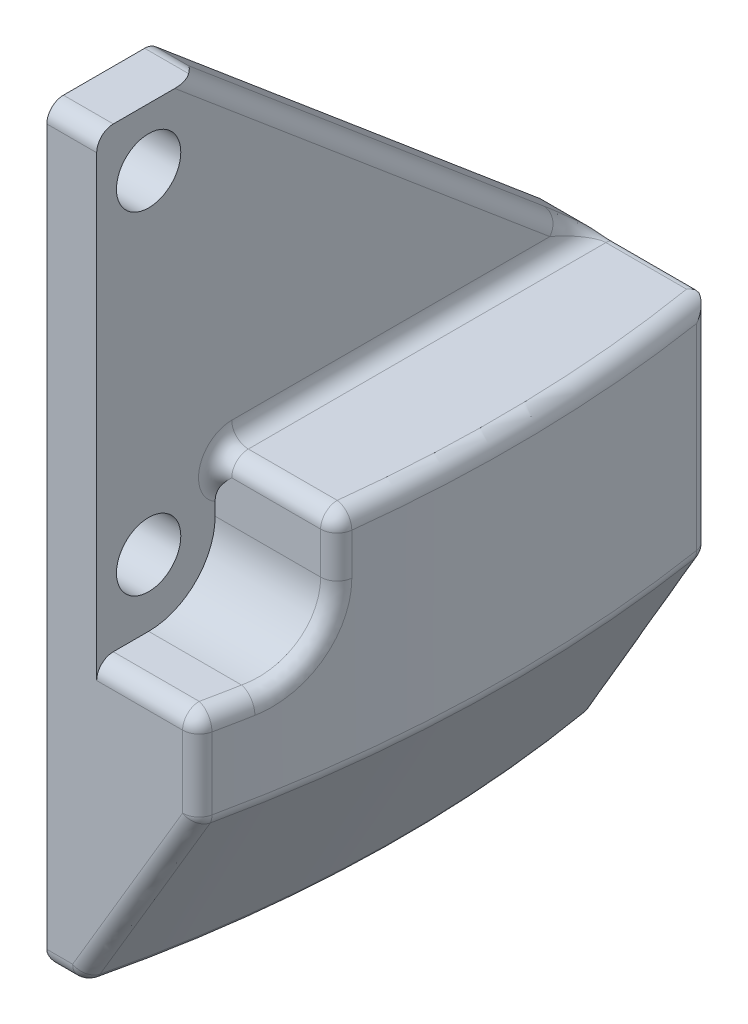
ISO-10303-21;
HEADER;
FILE_DESCRIPTION(('STEP AP214'),'2;1');
FILE_NAME('part.step','',(''),(''),'','','');
FILE_SCHEMA(('AUTOMOTIVE_DESIGN { 1 0 10303 214 1 1 1 1 }'));
ENDSEC;
DATA;
#1=APPLICATION_CONTEXT('core data for automotive mechanical design processes');
#2=APPLICATION_PROTOCOL_DEFINITION('international standard','automotive_design',2000,#1);
#3=PRODUCT_CONTEXT('',#1,'mechanical');
#4=PRODUCT('Part','Part','',(#3));
#5=PRODUCT_RELATED_PRODUCT_CATEGORY('part','',(#4));
#6=PRODUCT_DEFINITION_FORMATION('','',#4);
#7=PRODUCT_DEFINITION_CONTEXT('part definition',#1,'design');
#8=PRODUCT_DEFINITION('design','',#6,#7);
#9=PRODUCT_DEFINITION_SHAPE('','',#8);
#10=(LENGTH_UNIT() NAMED_UNIT(*) SI_UNIT(.MILLI.,.METRE.));
#11=(NAMED_UNIT(*) PLANE_ANGLE_UNIT() SI_UNIT($,.RADIAN.));
#12=(NAMED_UNIT(*) SI_UNIT($,.STERADIAN.) SOLID_ANGLE_UNIT());
#13=UNCERTAINTY_MEASURE_WITH_UNIT(LENGTH_MEASURE(1.E-05),#10,'distance_accuracy_value','');
#14=(GEOMETRIC_REPRESENTATION_CONTEXT(3) GLOBAL_UNCERTAINTY_ASSIGNED_CONTEXT((#13)) GLOBAL_UNIT_ASSIGNED_CONTEXT((#10,
#11,#12)) REPRESENTATION_CONTEXT('',''));
#15=CARTESIAN_POINT('',(0.,0.,0.));
#16=DIRECTION('',(0.,0.,1.));
#17=DIRECTION('',(1.,0.,0.));
#18=AXIS2_PLACEMENT_3D('',#15,#16,#17);
#19=CARTESIAN_POINT('',(85.2487499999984,27.305,17.7800000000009));
#20=DIRECTION('',(-1.,0.,0.));
#21=DIRECTION('',(0.,0.,1.));
#22=AXIS2_PLACEMENT_3D('',#19,#20,#21);
#23=CYLINDRICAL_SURFACE('',#22,2.45744999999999);
#24=CARTESIAN_POINT('',(85.2487499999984,27.305,17.7800000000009));
#25=DIRECTION('',(-1.,0.,0.));
#26=DIRECTION('',(0.,0.,1.));
#27=AXIS2_PLACEMENT_3D('',#24,#25,#26);
#28=CIRCLE('',#27,2.45744999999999);
#29=CARTESIAN_POINT('',(85.2487499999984,27.305,20.2374500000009));
#30=VERTEX_POINT('',#29);
#31=EDGE_CURVE('E353',#30,#30,#28,.T.);
#32=ORIENTED_EDGE('',*,*,#31,.T.);
#33=EDGE_LOOP('',(#32));
#34=FACE_BOUND('',#33,.T.);
#35=CARTESIAN_POINT('',(89.0587499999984,27.305,17.7800000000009));
#36=DIRECTION('',(1.,0.,0.));
#37=DIRECTION('',(0.,0.,-1.));
#38=AXIS2_PLACEMENT_3D('',#35,#36,#37);
#39=CIRCLE('',#38,2.45744999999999);
#40=CARTESIAN_POINT('',(89.0587499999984,27.305,15.3225500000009));
#41=VERTEX_POINT('',#40);
#42=EDGE_CURVE('E356',#41,#41,#39,.F.);
#43=ORIENTED_EDGE('',*,*,#42,.F.);
#44=EDGE_LOOP('',(#43));
#45=FACE_BOUND('',#44,.T.);
#46=ADVANCED_FACE('F41',(#34,#45),#23,.F.);
#47=CARTESIAN_POINT('',(89.0587499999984,0.,21.7487500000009));
#48=DIRECTION('',(0.,1.,0.));
#49=DIRECTION('',(0.,0.,1.));
#50=AXIS2_PLACEMENT_3D('',#47,#48,#49);
#51=PLANE('',#50);
#52=CARTESIAN_POINT('',(0.,0.,0.));
#53=DIRECTION('',(0.,1.,0.));
#54=DIRECTION('',(0.,0.,1.));
#55=AXIS2_PLACEMENT_3D('',#52,#53,#54);
#56=CIRCLE('',#55,89.5955151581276);
#57=CARTESIAN_POINT('',(88.3171117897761,0.,-15.0812499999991));
#58=VERTEX_POINT('',#57);
#59=CARTESIAN_POINT('',(87.2237188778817,0.,20.4787500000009));
#60=VERTEX_POINT('',#59);
#61=EDGE_CURVE('E769',#58,#60,#56,.F.);
#62=ORIENTED_EDGE('',*,*,#61,.T.);
#63=DIRECTION('',(-1.,0.,0.));
#64=VECTOR('',#63,1.);
#65=CARTESIAN_POINT('',(89.0587499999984,0.,20.4787500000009));
#66=LINE('',#65,#64);
#67=CARTESIAN_POINT('',(86.5187499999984,0.,20.4787500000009));
#68=VERTEX_POINT('',#67);
#69=EDGE_CURVE('E779',#60,#68,#66,.T.);
#70=ORIENTED_EDGE('',*,*,#69,.T.);
#71=DIRECTION('',(0.,0.,-1.));
#72=VECTOR('',#71,1.);
#73=CARTESIAN_POINT('',(86.5187499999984,0.,21.7487500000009));
#74=LINE('',#73,#72);
#75=CARTESIAN_POINT('',(86.5187499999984,0.,-15.0812499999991));
#76=VERTEX_POINT('',#75);
#77=EDGE_CURVE('E776',#68,#76,#74,.T.);
#78=ORIENTED_EDGE('',*,*,#77,.T.);
#79=DIRECTION('',(-1.,0.,0.));
#80=VECTOR('',#79,1.);
#81=CARTESIAN_POINT('',(89.0587499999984,0.,-15.0812499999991));
#82=LINE('',#81,#80);
#83=EDGE_CURVE('E766',#76,#58,#82,.F.);
#84=ORIENTED_EDGE('',*,*,#83,.T.);
#85=EDGE_LOOP('',(#62,#70,#78,#84));
#86=FACE_BOUND('',#85,.T.);
#87=ADVANCED_FACE('F343',(#86),#51,.F.);
#88=CARTESIAN_POINT('',(0.,31.75,0.));
#89=DIRECTION('',(0.,1.,0.));
#90=DIRECTION('',(0.,0.,1.));
#91=AXIS2_PLACEMENT_3D('',#88,#89,#90);
#92=PLANE('',#91);
#93=CARTESIAN_POINT('',(0.,31.75,0.));
#94=DIRECTION('',(0.,1.,0.));
#95=DIRECTION('',(0.,0.,1.));
#96=AXIS2_PLACEMENT_3D('',#93,#94,#95);
#97=CIRCLE('',#96,97.79);
#98=CARTESIAN_POINT('',(97.1197158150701,31.75,11.4300000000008));
#99=VERTEX_POINT('',#98);
#100=CARTESIAN_POINT('',(96.4907445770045,31.75,-15.8877409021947));
#101=VERTEX_POINT('',#100);
#102=EDGE_CURVE('E465',#99,#101,#97,.T.);
#103=ORIENTED_EDGE('',*,*,#102,.T.);
#104=DIRECTION('',(1.,0.,0.));
#105=VECTOR('',#104,1.);
#106=CARTESIAN_POINT('',(89.0587499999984,31.75,-15.8877409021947));
#107=LINE('',#106,#105);
#108=CARTESIAN_POINT('',(90.3287499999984,31.75,-15.8877409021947));
#109=VERTEX_POINT('',#108);
#110=EDGE_CURVE('E468',#101,#109,#107,.F.);
#111=ORIENTED_EDGE('',*,*,#110,.T.);
#112=DIRECTION('',(0.,0.,-1.));
#113=VECTOR('',#112,1.);
#114=CARTESIAN_POINT('',(90.3287499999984,31.75,12.7000000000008));
#115=LINE('',#114,#113);
#116=CARTESIAN_POINT('',(90.3287499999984,31.75,11.4300000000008));
#117=VERTEX_POINT('',#116);
#118=EDGE_CURVE('E462',#109,#117,#115,.F.);
#119=ORIENTED_EDGE('',*,*,#118,.T.);
#120=DIRECTION('',(1.,0.,0.));
#121=VECTOR('',#120,1.);
#122=CARTESIAN_POINT('',(98.2425243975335,31.75,11.4300000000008));
#123=LINE('',#122,#121);
#124=EDGE_CURVE('E459',#117,#99,#123,.T.);
#125=ORIENTED_EDGE('',*,*,#124,.T.);
#126=EDGE_LOOP('',(#103,#111,#119,#125));
#127=FACE_BOUND('',#126,.T.);
#128=ADVANCED_FACE('F348',(#127),#92,.T.);
#129=CARTESIAN_POINT('',(89.0587499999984,0.,0.));
#130=DIRECTION('',(1.,0.,0.));
#131=DIRECTION('',(0.,0.,-1.));
#132=AXIS2_PLACEMENT_3D('',#129,#130,#131);
#133=PLANE('',#132);
#134=DIRECTION('',(0.,-1.,0.));
#135=VECTOR('',#134,1.);
#136=CARTESIAN_POINT('',(89.0587499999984,27.305,12.7000000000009));
#137=LINE('',#136,#135);
#138=CARTESIAN_POINT('',(89.0587499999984,28.2802954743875,12.7000000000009));
#139=VERTEX_POINT('',#138);
#140=CARTESIAN_POINT('',(89.0587499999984,27.305,12.7000000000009));
#141=VERTEX_POINT('',#140);
#142=EDGE_CURVE('E358',#139,#141,#137,.T.);
#143=ORIENTED_EDGE('',*,*,#142,.F.);
#144=CARTESIAN_POINT('',(89.0587499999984,30.48,11.4300000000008));
#145=DIRECTION('',(1.,0.,0.));
#146=DIRECTION('',(0.,0.,-1.));
#147=AXIS2_PLACEMENT_3D('',#144,#145,#146);
#148=CIRCLE('',#147,2.54);
#149=CARTESIAN_POINT('',(89.0587499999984,33.02,11.4300000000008));
#150=VERTEX_POINT('',#149);
#151=EDGE_CURVE('E51',#139,#150,#148,.F.);
#152=ORIENTED_EDGE('',*,*,#151,.T.);
#153=DIRECTION('',(0.,0.,-1.));
#154=VECTOR('',#153,1.);
#155=CARTESIAN_POINT('',(89.0587499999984,33.02,-16.3512499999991));
#156=LINE('',#155,#154);
#157=CARTESIAN_POINT('',(89.0587499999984,33.02,-12.8714909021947));
#158=VERTEX_POINT('',#157);
#159=EDGE_CURVE('E443',#150,#158,#156,.T.);
#160=ORIENTED_EDGE('',*,*,#159,.T.);
#161=DIRECTION('',(0.,0.64413574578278,0.764911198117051));
#162=VECTOR('',#161,1.);
#163=CARTESIAN_POINT('',(89.0587499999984,56.1785627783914,14.629302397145));
#164=LINE('',#163,#162);
#165=CARTESIAN_POINT('',(89.0587499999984,57.15,15.7828840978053));
#166=VERTEX_POINT('',#165);
#167=EDGE_CURVE('E427',#158,#166,#164,.T.);
#168=ORIENTED_EDGE('',*,*,#167,.T.);
#169=DIRECTION('',(0.,0.,1.));
#170=VECTOR('',#169,1.);
#171=CARTESIAN_POINT('',(89.0587499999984,57.15,13.8112500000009));
#172=LINE('',#171,#170);
#173=CARTESIAN_POINT('',(89.0587499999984,57.15,20.4787500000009));
#174=VERTEX_POINT('',#173);
#175=EDGE_CURVE('E386',#166,#174,#172,.T.);
#176=ORIENTED_EDGE('',*,*,#175,.T.);
#177=CARTESIAN_POINT('',(89.0587499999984,55.88,20.4787500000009));
#178=DIRECTION('',(1.,0.,0.));
#179=DIRECTION('',(0.,0.,-1.));
#180=AXIS2_PLACEMENT_3D('',#177,#178,#179);
#181=CIRCLE('',#180,1.27);
#182=CARTESIAN_POINT('',(89.0587499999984,55.88,21.7487500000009));
#183=VERTEX_POINT('',#182);
#184=EDGE_CURVE('E381',#174,#183,#181,.T.);
#185=ORIENTED_EDGE('',*,*,#184,.T.);
#186=DIRECTION('',(0.,-1.,0.));
#187=VECTOR('',#186,1.);
#188=CARTESIAN_POINT('',(89.0587499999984,57.15,21.7487500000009));
#189=LINE('',#188,#187);
#190=CARTESIAN_POINT('',(89.0587499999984,20.955,21.7487500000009));
#191=VERTEX_POINT('',#190);
#192=EDGE_CURVE('E374',#183,#191,#189,.T.);
#193=ORIENTED_EDGE('',*,*,#192,.T.);
#194=CARTESIAN_POINT('',(89.0587499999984,20.955,20.4787500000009));
#195=DIRECTION('',(1.,0.,0.));
#196=DIRECTION('',(0.,0.,-1.));
#197=AXIS2_PLACEMENT_3D('',#194,#195,#196);
#198=CIRCLE('',#197,1.27);
#199=CARTESIAN_POINT('',(89.0587499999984,22.225,20.4787500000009));
#200=VERTEX_POINT('',#199);
#201=EDGE_CURVE('E11',#191,#200,#198,.F.);
#202=ORIENTED_EDGE('',*,*,#201,.T.);
#203=DIRECTION('',(0.,0.,1.));
#204=VECTOR('',#203,1.);
#205=CARTESIAN_POINT('',(89.0587499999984,22.225,21.7487500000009));
#206=LINE('',#205,#204);
#207=CARTESIAN_POINT('',(89.0587499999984,22.225,17.7800000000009));
#208=VERTEX_POINT('',#207);
#209=EDGE_CURVE('E734',#208,#200,#206,.T.);
#210=ORIENTED_EDGE('',*,*,#209,.F.);
#211=CARTESIAN_POINT('',(89.0587499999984,27.305,17.7800000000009));
#212=DIRECTION('',(1.,0.,0.));
#213=DIRECTION('',(0.,0.,-1.));
#214=AXIS2_PLACEMENT_3D('',#211,#212,#213);
#215=CIRCLE('',#214,5.08);
#216=EDGE_CURVE('E363',#141,#208,#215,.F.);
#217=ORIENTED_EDGE('',*,*,#216,.F.);
#218=EDGE_LOOP('',(#143,#152,#160,#168,#176,#185,#193,#202,#210,#217));
#219=FACE_BOUND('',#218,.T.);
#220=CARTESIAN_POINT('',(89.0587499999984,52.705,17.7800000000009));
#221=DIRECTION('',(1.,0.,0.));
#222=DIRECTION('',(0.,0.,-1.));
#223=AXIS2_PLACEMENT_3D('',#220,#221,#222);
#224=CIRCLE('',#223,2.45744999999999);
#225=CARTESIAN_POINT('',(89.0587499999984,52.705,15.3225500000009));
#226=VERTEX_POINT('',#225);
#227=EDGE_CURVE('E367',#226,#226,#224,.T.);
#228=ORIENTED_EDGE('',*,*,#227,.F.);
#229=EDGE_LOOP('',(#228));
#230=FACE_BOUND('',#229,.T.);
#231=ORIENTED_EDGE('',*,*,#42,.T.);
#232=EDGE_LOOP('',(#231));
#233=FACE_BOUND('',#232,.T.);
#234=ADVANCED_FACE('F420',(#219,#230,#233),#133,.T.);
#235=CARTESIAN_POINT('',(89.0587499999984,57.15,13.8112500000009));
#236=DIRECTION('',(0.,-1.,0.));
#237=DIRECTION('',(0.,0.,-1.));
#238=AXIS2_PLACEMENT_3D('',#235,#236,#237);
#239=PLANE('',#238);
#240=ORIENTED_EDGE('',*,*,#175,.F.);
#241=CARTESIAN_POINT('',(87.7887499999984,57.15,15.7828840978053));
#242=DIRECTION('',(0.,-1.,0.));
#243=DIRECTION('',(0.,0.,-1.));
#244=AXIS2_PLACEMENT_3D('',#241,#242,#243);
#245=ELLIPSE('',#244,1.9716340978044,1.27);
#246=CARTESIAN_POINT('',(88.6068023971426,57.15,14.2747590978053));
#247=VERTEX_POINT('',#246);
#248=EDGE_CURVE('E456',#166,#247,#245,.F.);
#249=ORIENTED_EDGE('',*,*,#248,.T.);
#250=DIRECTION('',(-1.,0.,0.));
#251=VECTOR('',#250,1.);
#252=CARTESIAN_POINT('',(89.0587499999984,57.15,14.2747590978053));
#253=LINE('',#252,#251);
#254=CARTESIAN_POINT('',(85.2487499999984,57.15,14.2747590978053));
#255=VERTEX_POINT('',#254);
#256=EDGE_CURVE('E453',#247,#255,#253,.T.);
#257=ORIENTED_EDGE('',*,*,#256,.T.);
#258=DIRECTION('',(0.,0.,1.));
#259=VECTOR('',#258,1.);
#260=CARTESIAN_POINT('',(85.2487499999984,57.15,13.8112500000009));
#261=LINE('',#260,#259);
#262=CARTESIAN_POINT('',(85.2487499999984,57.15,20.4787500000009));
#263=VERTEX_POINT('',#262);
#264=EDGE_CURVE('E392',#255,#263,#261,.T.);
#265=ORIENTED_EDGE('',*,*,#264,.T.);
#266=DIRECTION('',(-1.,0.,0.));
#267=VECTOR('',#266,1.);
#268=CARTESIAN_POINT('',(89.0587499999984,57.15,20.4787500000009));
#269=LINE('',#268,#267);
#270=EDGE_CURVE('E440',#263,#174,#269,.F.);
#271=ORIENTED_EDGE('',*,*,#270,.T.);
#272=EDGE_LOOP('',(#240,#249,#257,#265,#271));
#273=FACE_BOUND('',#272,.T.);
#274=ADVANCED_FACE('F497',(#273),#239,.F.);
#275=CARTESIAN_POINT('',(89.0587499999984,57.15,21.7487500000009));
#276=DIRECTION('',(0.,0.,-1.));
#277=DIRECTION('',(0.,1.,0.));
#278=AXIS2_PLACEMENT_3D('',#275,#276,#277);
#279=PLANE('',#278);
#280=ORIENTED_EDGE('',*,*,#192,.F.);
#281=DIRECTION('',(-1.,0.,0.));
#282=VECTOR('',#281,1.);
#283=CARTESIAN_POINT('',(89.0587499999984,55.88,21.7487500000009));
#284=LINE('',#283,#282);
#285=CARTESIAN_POINT('',(85.2487499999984,55.88,21.7487500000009));
#286=VERTEX_POINT('',#285);
#287=EDGE_CURVE('E442',#183,#286,#284,.T.);
#288=ORIENTED_EDGE('',*,*,#287,.T.);
#289=DIRECTION('',(0.,-1.,0.));
#290=VECTOR('',#289,1.);
#291=CARTESIAN_POINT('',(85.2487499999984,57.15,21.7487500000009));
#292=LINE('',#291,#290);
#293=CARTESIAN_POINT('',(85.2487499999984,1.27,21.7487500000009));
#294=VERTEX_POINT('',#293);
#295=EDGE_CURVE('E396',#286,#294,#292,.T.);
#296=ORIENTED_EDGE('',*,*,#295,.T.);
#297=DIRECTION('',(-1.,0.,0.));
#298=VECTOR('',#297,1.);
#299=CARTESIAN_POINT('',(89.0587499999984,1.27,21.7487500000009));
#300=LINE('',#299,#298);
#301=CARTESIAN_POINT('',(87.2237188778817,1.27,21.7487500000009));
#302=VERTEX_POINT('',#301);
#303=EDGE_CURVE('E63',#294,#302,#300,.F.);
#304=ORIENTED_EDGE('',*,*,#303,.T.);
#305=CARTESIAN_POINT('',(51.9904160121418,-59.4074236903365,20.8887918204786));
#306=CARTESIAN_POINT('',(51.7413318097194,-59.2524415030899,21.7487500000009));
#307=CARTESIAN_POINT('',(50.9698569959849,-58.7724236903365,21.7487500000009));
#308=CARTESIAN_POINT('',(52.8520507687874,-58.0264298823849,20.8828412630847));
#309=CARTESIAN_POINT('',(52.6066252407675,-57.8707323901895,21.7487500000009));
#310=CARTESIAN_POINT('',(51.8291019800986,-57.3914298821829,21.7487500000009));
#311=CARTESIAN_POINT('',(53.7113793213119,-56.6441026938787,20.8771414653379));
#312=CARTESIAN_POINT('',(53.4679728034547,-56.4902026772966,21.7487500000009));
#313=CARTESIAN_POINT('',(52.6861997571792,-56.0091026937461,21.7487500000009));
#314=CARTESIAN_POINT('',(55.4259698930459,-53.8771066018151,20.8661910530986));
#315=CARTESIAN_POINT('',(55.1867543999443,-53.7263792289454,21.7487500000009));
#316=CARTESIAN_POINT('',(54.3966015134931,-53.2421066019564,21.7487500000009));
#317=CARTESIAN_POINT('',(56.2812319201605,-52.4924377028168,20.8609404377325));
#318=CARTESIAN_POINT('',(56.04395672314,-52.3434281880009,21.7487500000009));
#319=CARTESIAN_POINT('',(55.2499055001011,-51.8574377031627,21.7487500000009));
#320=CARTESIAN_POINT('',(58.8417279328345,-48.3354208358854,20.8457839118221));
#321=CARTESIAN_POINT('',(58.6144805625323,-48.1845037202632,21.7487500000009));
#322=CARTESIAN_POINT('',(57.8048686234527,-47.7004208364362,21.7487500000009));
#323=CARTESIAN_POINT('',(60.5416860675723,-45.5600398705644,20.8364732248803));
#324=CARTESIAN_POINT('',(60.3176152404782,-45.4130451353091,21.7487500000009));
#325=CARTESIAN_POINT('',(59.5015931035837,-44.9250398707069,21.7487500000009));
#326=CARTESIAN_POINT('',(63.9306669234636,-40.0031131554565,20.8191197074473));
#327=CARTESIAN_POINT('',(63.7141247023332,-39.8614354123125,21.7487500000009));
#328=CARTESIAN_POINT('',(62.8847670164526,-39.368113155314,21.7487500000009));
#329=CARTESIAN_POINT('',(65.6196898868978,-37.2215675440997,20.8110768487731));
#330=CARTESIAN_POINT('',(65.4061833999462,-37.0833032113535,21.7487500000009));
#331=CARTESIAN_POINT('',(64.5712166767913,-36.5865675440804,21.7487500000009));
#332=CARTESIAN_POINT('',(68.9891025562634,-31.6535497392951,20.7960202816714));
#333=CARTESIAN_POINT('',(68.782563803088,-31.5200335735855,21.7487500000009));
#334=CARTESIAN_POINT('',(67.9359755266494,-31.0185497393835,21.7487500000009));
#335=CARTESIAN_POINT('',(70.6694922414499,-28.8670775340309,20.7890065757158));
#336=CARTESIAN_POINT('',(70.4658103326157,-28.7365739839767,21.7487500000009));
#337=CARTESIAN_POINT('',(69.6142846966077,-28.2320775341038,21.7487500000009));
#338=CARTESIAN_POINT('',(74.0232545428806,-23.2902852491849,20.7758247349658));
#339=CARTESIAN_POINT('',(73.8260018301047,-23.1640510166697,21.7487500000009));
#340=CARTESIAN_POINT('',(72.9642604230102,-22.655285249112,21.7487500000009));
#341=CARTESIAN_POINT('',(75.6966274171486,-20.4999653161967,20.7696565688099));
#342=CARTESIAN_POINT('',(75.5020588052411,-20.3763933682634,21.7487500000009));
#343=CARTESIAN_POINT('',(74.6359272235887,-19.8649653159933,21.7487500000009));
#344=CARTESIAN_POINT('',(79.037675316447,-14.916097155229,20.7580238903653));
#345=CARTESIAN_POINT('',(78.849020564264,-14.7964084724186,21.7487500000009));
#346=CARTESIAN_POINT('',(77.9738533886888,-14.2810971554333,21.7487500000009));
#347=CARTESIAN_POINT('',(80.7053503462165,-12.1225489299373,20.7525593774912));
#348=CARTESIAN_POINT('',(80.5191810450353,-12.0052723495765,21.7487500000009));
#349=CARTESIAN_POINT('',(79.6401127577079,-11.4875489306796,21.7487500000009));
#350=CARTESIAN_POINT('',(85.7013737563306,-3.73788732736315,20.7370463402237));
#351=CARTESIAN_POINT('',(85.5319212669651,-3.61162868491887,21.7487500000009));
#352=CARTESIAN_POINT('',(84.6322277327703,-3.10288732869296,21.7487500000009));
#353=CARTESIAN_POINT('',(89.0226983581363,1.85720616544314,20.7278784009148));
#354=CARTESIAN_POINT('',(88.8561302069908,1.97678754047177,21.7487500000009));
#355=CARTESIAN_POINT('',(87.9513981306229,2.49220616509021,21.7487500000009));
#356=CARTESIAN_POINT('',(95.6519999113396,13.0546435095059,20.7112368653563));
#357=CARTESIAN_POINT('',(95.4947454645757,13.1683067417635,21.7487500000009));
#358=CARTESIAN_POINT('',(94.5769668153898,13.6896435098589,21.7487500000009));
#359=CARTESIAN_POINT('',(98.9599773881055,18.6569870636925,20.703763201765));
#360=CARTESIAN_POINT('',(98.8055049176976,18.7654333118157,21.7487500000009));
#361=CARTESIAN_POINT('',(97.8833656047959,19.2919870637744,21.7487500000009));
#362=CARTESIAN_POINT('',(105.566168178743,29.8671745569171,20.6900858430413));
#363=CARTESIAN_POINT('',(105.419757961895,29.9706633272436,21.7487500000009));
#364=CARTESIAN_POINT('',(104.486788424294,30.5021745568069,21.7487500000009));
#365=CARTESIAN_POINT('',(108.864381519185,35.4750184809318,20.68388214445));
#366=CARTESIAN_POINT('',(108.720486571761,35.5741900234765,21.7487500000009));
#367=CARTESIAN_POINT('',(107.783812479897,36.1100184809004,21.7487500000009));
#368=CARTESIAN_POINT('',(115.453559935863,46.6950478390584,20.6724443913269));
#369=CARTESIAN_POINT('',(115.316717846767,46.790052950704,21.7487500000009));
#370=CARTESIAN_POINT('',(114.370882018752,47.3300478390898,21.7487500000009));
#371=CARTESIAN_POINT('',(118.74452477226,52.3072334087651,20.6672103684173));
#372=CARTESIAN_POINT('',(118.610087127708,52.3988314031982,21.7487500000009));
#373=CARTESIAN_POINT('',(117.660927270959,52.9422334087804,21.7487500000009));
#374=CARTESIAN_POINT('',(125.320662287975,63.5348939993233,20.6575133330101));
#375=CARTESIAN_POINT('',(125.192122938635,63.6224341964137,21.7487500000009));
#376=CARTESIAN_POINT('',(124.235424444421,64.1698939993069,21.7487500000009));
#377=CARTESIAN_POINT('',(128.605834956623,69.1503690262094,20.6530503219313));
#378=CARTESIAN_POINT('',(128.479078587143,69.2343882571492,21.7487500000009));
#379=CARTESIAN_POINT('',(127.519876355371,69.7853690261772,21.7487500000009));
#380=CARTESIAN_POINT('',(131.888887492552,74.7670437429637,20.6488733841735));
#381=CARTESIAN_POINT('',(131.760524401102,74.8420570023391,21.7487500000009));
#382=CARTESIAN_POINT('',(130.802272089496,75.4020437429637,21.7487500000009));
#383=(BOUNDED_SURFACE() B_SPLINE_SURFACE(3,2,((#305,#306,#307),(#308,#309,#310),(#311,#312,
#313),(#314,#315,#316),(#317,#318,#319),(#320,#321,#322),(#323,#324,#325),(#326,#327,#328),
(#329,#330,#331),(#332,#333,#334),(#335,#336,#337),(#338,#339,#340),(#341,#342,#343),(#344,#345,
#346),(#347,#348,#349),(#350,#351,#352),(#353,#354,#355),(#356,#357,#358),(#359,#360,#361),
(#362,#363,#364),(#365,#366,#367),(#368,#369,#370),(#371,#372,#373),(#374,#375,#376),(#377,#378,
#379),(#380,#381,#382)),.UNSPECIFIED.,.F.,.F.,.F.) B_SPLINE_SURFACE_WITH_KNOTS((4,2,2,2,2,2,2,2,
2,2,2,2,4),(3,3),(0.,4.87944262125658,9.75887575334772,19.5176613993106,29.2762300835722,
39.0348222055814,48.7930522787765,58.5512742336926,78.0678469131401,97.5836437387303,
117.099387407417,136.615767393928,156.132183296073),(0.,1.),
.UNSPECIFIED.) GEOMETRIC_REPRESENTATION_ITEM() RATIONAL_B_SPLINE_SURFACE(((1.,0.813285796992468,
1.),(1.,0.811845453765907,1.),(1.,0.810462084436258,1.),(1.,0.807798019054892,1.),(1.,
0.80651732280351,1.),(1.,0.802812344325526,1.),(1.,0.800525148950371,1.),(1.,0.796246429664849,
1.),(1.,0.794254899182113,1.),(1.,0.790514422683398,1.),(1.,0.788765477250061,1.),(1.,
0.785468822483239,1.),(1.,0.783921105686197,1.),(1.,0.78099454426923,1.),(1.,0.779615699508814,
1.),(1.,0.775692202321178,1.),(1.,0.7733606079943,1.),(1.,0.769112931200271,1.),(1.,
0.767196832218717,1.),(1.,0.763679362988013,1.),(1.,0.762077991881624,1.),(1.,0.759117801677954,
1.),(1.,0.75775899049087,1.),(1.,0.755235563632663,1.),(1.,0.754070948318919,1.),(1.,
0.752979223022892,1.))) REPRESENTATION_ITEM('') SURFACE());
#384=CARTESIAN_POINT('',(50.9698569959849,-58.7724236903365,21.7487500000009));
#385=CARTESIAN_POINT('',(51.8291019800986,-57.3914298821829,21.7487500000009));
#386=CARTESIAN_POINT('',(52.6861997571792,-56.0091026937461,21.7487500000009));
#387=CARTESIAN_POINT('',(54.3966015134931,-53.2421066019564,21.7487500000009));
#388=CARTESIAN_POINT('',(55.2499055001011,-51.8574377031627,21.7487500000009));
#389=CARTESIAN_POINT('',(57.8048686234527,-47.7004208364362,21.7487500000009));
#390=CARTESIAN_POINT('',(59.5015931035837,-44.9250398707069,21.7487500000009));
#391=CARTESIAN_POINT('',(62.8847670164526,-39.368113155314,21.7487500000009));
#392=CARTESIAN_POINT('',(64.5712166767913,-36.5865675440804,21.7487500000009));
#393=CARTESIAN_POINT('',(67.9359755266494,-31.0185497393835,21.7487500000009));
#394=CARTESIAN_POINT('',(69.6142846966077,-28.2320775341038,21.7487500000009));
#395=CARTESIAN_POINT('',(72.9642604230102,-22.655285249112,21.7487500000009));
#396=CARTESIAN_POINT('',(74.6359272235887,-19.8649653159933,21.7487500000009));
#397=CARTESIAN_POINT('',(77.9738533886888,-14.2810971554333,21.7487500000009));
#398=CARTESIAN_POINT('',(79.6401127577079,-11.4875489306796,21.7487500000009));
#399=CARTESIAN_POINT('',(84.6322277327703,-3.10288732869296,21.7487500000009));
#400=CARTESIAN_POINT('',(87.9513981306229,2.49220616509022,21.7487500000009));
#401=CARTESIAN_POINT('',(94.5769668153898,13.6896435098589,21.7487500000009));
#402=CARTESIAN_POINT('',(97.8833656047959,19.2919870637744,21.7487500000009));
#403=CARTESIAN_POINT('',(104.486788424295,30.5021745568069,21.7487500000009));
#404=CARTESIAN_POINT('',(107.783812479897,36.1100184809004,21.7487500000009));
#405=CARTESIAN_POINT('',(114.370882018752,47.3300478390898,21.7487500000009));
#406=CARTESIAN_POINT('',(117.660927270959,52.9422334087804,21.7487500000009));
#407=CARTESIAN_POINT('',(124.235424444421,64.1698939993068,21.7487500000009));
#408=CARTESIAN_POINT('',(127.519876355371,69.7853690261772,21.7487500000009));
#409=CARTESIAN_POINT('',(130.802272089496,75.4020437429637,21.7487500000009));
#410=B_SPLINE_CURVE_WITH_KNOTS('',3,(#384,#385,#386,#387,#388,#389,#390,#391,#392,#393,#394,
#395,#396,#397,#398,#399,#400,#401,#402,#403,#404,#405,#406,#407,#408,#409),.UNSPECIFIED.,.F.,
.F.,(4,2,2,2,2,2,2,2,2,2,2,2,4),(0.,4.87944262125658,9.75887575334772,19.5176613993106,
29.2762300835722,39.0348222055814,48.7930522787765,58.5512742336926,78.0678469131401,
97.5836437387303,117.099387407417,136.615767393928,156.132183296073),.UNSPECIFIED.);
#411=CARTESIAN_POINT('',(95.6216758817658,15.4632640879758,21.7487500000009));
#412=VERTEX_POINT('',#411);
#413=EDGE_CURVE('E544',#302,#412,#410,.T.);
#414=ORIENTED_EDGE('',*,*,#413,.T.);
#415=DIRECTION('',(0.,-1.,0.));
#416=VECTOR('',#415,1.);
#417=CARTESIAN_POINT('',(95.6216758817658,57.15,21.7487500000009));
#418=LINE('',#417,#416);
#419=CARTESIAN_POINT('',(95.6216758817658,20.955,21.7487500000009));
#420=VERTEX_POINT('',#419);
#421=EDGE_CURVE('E551',#412,#420,#418,.F.);
#422=ORIENTED_EDGE('',*,*,#421,.T.);
#423=DIRECTION('',(1.,0.,0.));
#424=VECTOR('',#423,1.);
#425=CARTESIAN_POINT('',(89.0587499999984,20.955,21.7487500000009));
#426=LINE('',#425,#424);
#427=EDGE_CURVE('E810',#420,#191,#426,.F.);
#428=ORIENTED_EDGE('',*,*,#427,.T.);
#429=EDGE_LOOP('',(#280,#288,#296,#304,#414,#422,#428));
#430=FACE_BOUND('',#429,.T.);
#431=ADVANCED_FACE('F305',(#430),#279,.F.);
#432=CARTESIAN_POINT('',(89.0587499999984,0.,-16.3512499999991));
#433=DIRECTION('',(0.,0.,1.));
#434=DIRECTION('',(0.,-1.,0.));
#435=AXIS2_PLACEMENT_3D('',#432,#433,#434);
#436=PLANE('',#435);
#437=DIRECTION('',(0.,1.,0.));
#438=VECTOR('',#437,1.);
#439=CARTESIAN_POINT('',(85.2487499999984,0.,-16.3512499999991));
#440=LINE('',#439,#438);
#441=CARTESIAN_POINT('',(85.2487499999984,1.27,-16.3512499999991));
#442=VERTEX_POINT('',#441);
#443=CARTESIAN_POINT('',(85.2487499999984,31.1591502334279,-16.3512499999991));
#444=VERTEX_POINT('',#443);
#445=EDGE_CURVE('E399',#442,#444,#440,.T.);
#446=ORIENTED_EDGE('',*,*,#445,.T.);
#447=DIRECTION('',(-1.,0.,0.));
#448=VECTOR('',#447,1.);
#449=CARTESIAN_POINT('',(89.0587499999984,31.1591502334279,-16.3512499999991));
#450=LINE('',#449,#448);
#451=CARTESIAN_POINT('',(96.6200807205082,31.1591502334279,-16.3512499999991));
#452=VERTEX_POINT('',#451);
#453=EDGE_CURVE('E846',#444,#452,#450,.F.);
#454=ORIENTED_EDGE('',*,*,#453,.T.);
#455=DIRECTION('',(0.,-1.,0.));
#456=VECTOR('',#455,1.);
#457=CARTESIAN_POINT('',(96.6200807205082,0.,-16.3512499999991));
#458=LINE('',#457,#456);
#459=CARTESIAN_POINT('',(96.6200807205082,15.4632640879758,-16.3512499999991));
#460=VERTEX_POINT('',#459);
#461=EDGE_CURVE('E538',#452,#460,#458,.T.);
#462=ORIENTED_EDGE('',*,*,#461,.T.);
#463=CARTESIAN_POINT('',(123.546674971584,59.1518928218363,-15.2156892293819));
#464=CARTESIAN_POINT('',(123.442181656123,59.2126778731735,-16.3512499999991));
#465=CARTESIAN_POINT('',(122.455070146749,59.7868928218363,-16.3512499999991));
#466=CARTESIAN_POINT('',(121.039936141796,54.8432709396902,-15.2184032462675));
#467=CARTESIAN_POINT('',(120.935841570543,54.9090740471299,-16.3512499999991));
#468=CARTESIAN_POINT('',(119.948666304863,55.4782709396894,-16.3512499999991));
#469=CARTESIAN_POINT('',(118.532346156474,50.5351275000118,-15.2212742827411));
#470=CARTESIAN_POINT('',(118.426697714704,50.6028057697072,-16.3512499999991));
#471=CARTESIAN_POINT('',(117.441439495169,51.1701275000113,-16.3512499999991));
#472=CARTESIAN_POINT('',(113.51500289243,41.920054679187,-15.2274123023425));
#473=CARTESIAN_POINT('',(113.405250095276,41.9903323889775,-16.3512499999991));
#474=CARTESIAN_POINT('',(112.424901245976,42.555054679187,-16.3512499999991));
#475=CARTESIAN_POINT('',(111.005249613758,37.6131252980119,-15.2306792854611));
#476=CARTESIAN_POINT('',(110.893637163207,37.6853002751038,-16.3512499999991));
#477=CARTESIAN_POINT('',(109.915589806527,38.2481252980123,-16.3512499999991));
#478=CARTESIAN_POINT('',(105.983129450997,29.000756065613,-15.2376910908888));
#479=CARTESIAN_POINT('',(105.866810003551,29.0756853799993,-16.3512499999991));
#480=CARTESIAN_POINT('',(104.894454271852,29.6357560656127,-16.3512499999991));
#481=CARTESIAN_POINT('',(103.470762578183,24.6953162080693,-15.241435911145));
#482=CARTESIAN_POINT('',(103.352424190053,24.7725051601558,-16.3512499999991));
#483=CARTESIAN_POINT('',(102.382630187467,25.3303162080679,-16.3512499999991));
#484=CARTESIAN_POINT('',(98.4427552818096,16.0862692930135,-15.2495174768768));
#485=CARTESIAN_POINT('',(98.3191297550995,16.1666253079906,-16.3512499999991));
#486=CARTESIAN_POINT('',(97.3558432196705,16.7212692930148,-16.3512499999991));
#487=CARTESIAN_POINT('',(95.9271148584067,11.7826622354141,-15.2538542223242));
#488=CARTESIAN_POINT('',(95.8012400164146,11.8656446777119,-16.3512499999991));
#489=CARTESIAN_POINT('',(94.8408803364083,12.4176622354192,-16.3512499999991));
#490=CARTESIAN_POINT('',(90.8916812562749,3.17774572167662,-15.2632705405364));
#491=CARTESIAN_POINT('',(90.7597921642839,3.26434307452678,-16.3512499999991));
#492=CARTESIAN_POINT('',(89.806984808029,3.81274572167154,-16.3512499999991));
#493=CARTESIAN_POINT('',(88.371888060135,-1.12356372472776,-15.2683501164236));
#494=CARTESIAN_POINT('',(88.2375025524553,-1.03384713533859,-16.3512499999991));
#495=CARTESIAN_POINT('',(87.2880521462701,-0.488563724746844,-16.3512499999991));
#496=CARTESIAN_POINT('',(83.326948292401,-9.72319060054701,-15.2794597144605));
#497=CARTESIAN_POINT('',(83.1856701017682,-9.62930624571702,-16.3512499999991));
#498=CARTESIAN_POINT('',(82.245088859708,-9.08819060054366,-16.3512499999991));
#499=CARTESIAN_POINT('',(80.8018017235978,-14.0215080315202,-15.2854897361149));
#500=CARTESIAN_POINT('',(80.6577362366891,-13.9238877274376,-16.3512499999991));
#501=CARTESIAN_POINT('',(79.7210582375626,-13.3865080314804,-16.3512499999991));
#502=CARTESIAN_POINT('',(75.7444200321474,-22.6142160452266,-15.298790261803));
#503=CARTESIAN_POINT('',(75.5924169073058,-22.5116957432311,-16.3512499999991));
#504=CARTESIAN_POINT('',(74.6662745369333,-21.9792160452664,-16.3512499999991));
#505=CARTESIAN_POINT('',(73.2121848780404,-26.9086066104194,-15.3060607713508));
#506=CARTESIAN_POINT('',(73.0571109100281,-26.8014743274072,-16.3512499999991));
#507=CARTESIAN_POINT('',(72.135521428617,-26.2736066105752,-16.3512499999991));
#508=CARTESIAN_POINT('',(69.4065726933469,-33.3461522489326,-15.3182173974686));
#509=CARTESIAN_POINT('',(69.2393798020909,-33.2434196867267,-16.3512499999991));
#510=CARTESIAN_POINT('',(68.3325436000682,-32.7111522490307,-16.3512499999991));
#511=CARTESIAN_POINT('',(68.1368242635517,-35.4913293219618,-15.3224780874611));
#512=CARTESIAN_POINT('',(67.9674330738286,-35.3867529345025,-16.3512499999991));
#513=CARTESIAN_POINT('',(67.0637418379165,-34.8563293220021,-16.3512499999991));
#514=CARTESIAN_POINT('',(65.5944258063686,-39.7800688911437,-15.3314935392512));
#515=CARTESIAN_POINT('',(65.4199970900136,-39.6723763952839,-16.3512499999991));
#516=CARTESIAN_POINT('',(64.5234103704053,-39.1450688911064,-16.3512499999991));
#517=CARTESIAN_POINT('',(64.3217757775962,-41.9236313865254,-15.3362483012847));
#518=CARTESIAN_POINT('',(64.1449152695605,-41.8140019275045,-16.3512499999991));
#519=CARTESIAN_POINT('',(63.251880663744,-41.2886313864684,-16.3512499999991));
#520=CARTESIAN_POINT('',(63.0474342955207,-44.066252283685,-15.3412886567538));
#521=CARTESIAN_POINT('',(62.8658078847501,-43.9583304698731,-16.3512499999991));
#522=CARTESIAN_POINT('',(61.9787646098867,-43.431252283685,-16.3512499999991));
#523=(BOUNDED_SURFACE() B_SPLINE_SURFACE(3,2,((#463,#464,#465),(#466,#467,#468),(#469,#470,
#471),(#472,#473,#474),(#475,#476,#477),(#478,#479,#480),(#481,#482,#483),(#484,#485,#486),
(#487,#488,#489),(#490,#491,#492),(#493,#494,#495),(#496,#497,#498),(#499,#500,#501),(#502,#503,
#504),(#505,#506,#507),(#508,#509,#510),(#511,#512,#513),(#514,#515,#516),(#517,#518,#519),
(#520,#521,#522)),.UNSPECIFIED.,.F.,.F.,.F.) B_SPLINE_SURFACE_WITH_KNOTS((4,2,2,2,2,2,2,2,2,4),
(3,3),(0.,14.9538140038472,29.9076276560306,44.8613770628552,59.8151257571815,74.7689373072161,
89.7227410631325,104.676611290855,112.153559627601,119.630511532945),(0.,1.),
.UNSPECIFIED.) GEOMETRIC_REPRESENTATION_ITEM() RATIONAL_B_SPLINE_SURFACE(((1.,0.74359184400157,
1.),(1.,0.744310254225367,1.),(1.,0.745069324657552,1.),(1.,0.746689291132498,1.),(1.,
0.747550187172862,1.),(1.,0.749394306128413,1.),(1.,0.750377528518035,1.),(1.,0.752494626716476,
1.),(1.,0.753628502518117,1.),(1.,0.756084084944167,1.),(1.,0.757405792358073,1.),(1.,
0.76028771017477,1.),(1.,0.761847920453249,1.),(1.,0.765276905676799,1.),(1.,0.767145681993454,
1.),(1.,0.770256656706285,1.),(1.,0.771344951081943,1.),(1.,0.773642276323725,1.),(1.,
0.774851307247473,1.),(1.,0.776129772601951,1.))) REPRESENTATION_ITEM('') SURFACE());
#524=CARTESIAN_POINT('',(122.455070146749,59.7868928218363,-16.3512499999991));
#525=CARTESIAN_POINT('',(119.948666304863,55.4782709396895,-16.3512499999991));
#526=CARTESIAN_POINT('',(117.441439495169,51.1701275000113,-16.3512499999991));
#527=CARTESIAN_POINT('',(112.424901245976,42.555054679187,-16.3512499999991));
#528=CARTESIAN_POINT('',(109.915589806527,38.2481252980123,-16.3512499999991));
#529=CARTESIAN_POINT('',(104.894454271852,29.6357560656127,-16.3512499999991));
#530=CARTESIAN_POINT('',(102.382630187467,25.3303162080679,-16.3512499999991));
#531=CARTESIAN_POINT('',(97.3558432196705,16.7212692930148,-16.3512499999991));
#532=CARTESIAN_POINT('',(94.8408803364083,12.4176622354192,-16.3512499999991));
#533=CARTESIAN_POINT('',(89.806984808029,3.81274572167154,-16.3512499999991));
#534=CARTESIAN_POINT('',(87.2880521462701,-0.488563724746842,-16.3512499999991));
#535=CARTESIAN_POINT('',(82.245088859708,-9.08819060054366,-16.3512499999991));
#536=CARTESIAN_POINT('',(79.7210582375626,-13.3865080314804,-16.3512499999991));
#537=CARTESIAN_POINT('',(74.6662745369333,-21.9792160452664,-16.3512499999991));
#538=CARTESIAN_POINT('',(72.135521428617,-26.2736066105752,-16.3512499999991));
#539=CARTESIAN_POINT('',(68.3325436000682,-32.7111522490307,-16.3512499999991));
#540=CARTESIAN_POINT('',(67.0637418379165,-34.8563293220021,-16.3512499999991));
#541=CARTESIAN_POINT('',(64.5234103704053,-39.1450688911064,-16.3512499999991));
#542=CARTESIAN_POINT('',(63.251880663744,-41.2886313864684,-16.3512499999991));
#543=CARTESIAN_POINT('',(61.9787646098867,-43.431252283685,-16.3512499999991));
#544=B_SPLINE_CURVE_WITH_KNOTS('',3,(#524,#525,#526,#527,#528,#529,#530,#531,#532,#533,#534,
#535,#536,#537,#538,#539,#540,#541,#542,#543),.UNSPECIFIED.,.F.,.F.,(4,2,2,2,2,2,2,2,2,4),(0.,
14.9538140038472,29.9076276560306,44.8613770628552,59.8151257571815,74.7689373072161,
89.7227410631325,104.676611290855,112.153559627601,119.630511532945),.UNSPECIFIED.);
#545=CARTESIAN_POINT('',(88.317111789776,1.27,-16.3512499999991));
#546=VERTEX_POINT('',#545);
#547=EDGE_CURVE('E531',#460,#546,#544,.T.);
#548=ORIENTED_EDGE('',*,*,#547,.T.);
#549=DIRECTION('',(-1.,0.,0.));
#550=VECTOR('',#549,1.);
#551=CARTESIAN_POINT('',(89.0587499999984,1.27,-16.3512499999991));
#552=LINE('',#551,#550);
#553=EDGE_CURVE('E527',#546,#442,#552,.T.);
#554=ORIENTED_EDGE('',*,*,#553,.T.);
#555=EDGE_LOOP('',(#446,#454,#462,#548,#554));
#556=FACE_BOUND('',#555,.T.);
#557=ADVANCED_FACE('F257',(#556),#436,.F.);
#558=CARTESIAN_POINT('',(89.0587499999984,31.75,-16.3512499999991));
#559=DIRECTION('',(0.,-0.764911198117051,0.64413574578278));
#560=DIRECTION('',(0.,-0.64413574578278,-0.764911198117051));
#561=AXIS2_PLACEMENT_3D('',#558,#559,#560);
#562=PLANE('',#561);
#563=CARTESIAN_POINT('',(90.3287499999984,33.9914372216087,-13.6895432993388));
#564=DIRECTION('',(0.,-0.764911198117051,0.64413574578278));
#565=DIRECTION('',(0.,0.64413574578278,0.764911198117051));
#566=AXIS2_PLACEMENT_3D('',#563,#564,#565);
#567=ELLIPSE('',#566,3.94326819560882,2.54);
#568=CARTESIAN_POINT('',(87.7887499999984,33.9914372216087,-13.6895432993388));
#569=VERTEX_POINT('',#568);
#570=CARTESIAN_POINT('',(88.599924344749,32.1305874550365,-15.8993023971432));
#571=VERTEX_POINT('',#570);
#572=EDGE_CURVE('E378',#569,#571,#567,.T.);
#573=ORIENTED_EDGE('',*,*,#572,.T.);
#574=DIRECTION('',(-1.,0.,0.));
#575=VECTOR('',#574,1.);
#576=CARTESIAN_POINT('',(89.0587499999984,32.1305874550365,-15.8993023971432));
#577=LINE('',#576,#575);
#578=CARTESIAN_POINT('',(85.2487499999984,32.1305874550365,-15.8993023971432));
#579=VERTEX_POINT('',#578);
#580=EDGE_CURVE('E87',#571,#579,#577,.T.);
#581=ORIENTED_EDGE('',*,*,#580,.T.);
#582=DIRECTION('',(0.,0.64413574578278,0.764911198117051));
#583=VECTOR('',#582,1.);
#584=CARTESIAN_POINT('',(85.2487499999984,31.75,-16.3512499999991));
#585=LINE('',#584,#583);
#586=CARTESIAN_POINT('',(85.2487499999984,56.8514372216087,13.4567067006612));
#587=VERTEX_POINT('',#586);
#588=EDGE_CURVE('E402',#579,#587,#585,.T.);
#589=ORIENTED_EDGE('',*,*,#588,.T.);
#590=DIRECTION('',(-1.,0.,0.));
#591=VECTOR('',#590,1.);
#592=CARTESIAN_POINT('',(89.0587499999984,56.8514372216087,13.4567067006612));
#593=LINE('',#592,#591);
#594=CARTESIAN_POINT('',(87.7887499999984,56.8514372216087,13.4567067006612));
#595=VERTEX_POINT('',#594);
#596=EDGE_CURVE('E369',#587,#595,#593,.F.);
#597=ORIENTED_EDGE('',*,*,#596,.T.);
#598=DIRECTION('',(0.,0.64413574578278,0.764911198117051));
#599=VECTOR('',#598,1.);
#600=CARTESIAN_POINT('',(87.7887499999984,31.75,-16.3512499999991));
#601=LINE('',#600,#599);
#602=EDGE_CURVE('E373',#595,#569,#601,.F.);
#603=ORIENTED_EDGE('',*,*,#602,.T.);
#604=EDGE_LOOP('',(#573,#581,#589,#597,#603));
#605=FACE_BOUND('',#604,.T.);
#606=ADVANCED_FACE('F582',(#605),#562,.F.);
#607=CARTESIAN_POINT('',(85.2487499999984,0.,0.));
#608=DIRECTION('',(1.,0.,0.));
#609=DIRECTION('',(0.,0.,-1.));
#610=AXIS2_PLACEMENT_3D('',#607,#608,#609);
#611=PLANE('',#610);
#612=ORIENTED_EDGE('',*,*,#31,.F.);
#613=EDGE_LOOP('',(#612));
#614=FACE_BOUND('',#613,.T.);
#615=CARTESIAN_POINT('',(85.2487499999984,52.705,17.7800000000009));
#616=DIRECTION('',(-1.,0.,0.));
#617=DIRECTION('',(0.,0.,1.));
#618=AXIS2_PLACEMENT_3D('',#615,#616,#617);
#619=CIRCLE('',#618,2.45744999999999);
#620=CARTESIAN_POINT('',(85.2487499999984,52.705,20.2374500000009));
#621=VERTEX_POINT('',#620);
#622=EDGE_CURVE('E360',#621,#621,#619,.T.);
#623=ORIENTED_EDGE('',*,*,#622,.F.);
#624=EDGE_LOOP('',(#623));
#625=FACE_BOUND('',#624,.T.);
#626=ORIENTED_EDGE('',*,*,#445,.F.);
#627=DIRECTION('',(0.,0.,-1.));
#628=VECTOR('',#627,1.);
#629=CARTESIAN_POINT('',(85.2487499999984,1.27,0.));
#630=LINE('',#629,#628);
#631=EDGE_CURVE('E511',#442,#294,#630,.F.);
#632=ORIENTED_EDGE('',*,*,#631,.T.);
#633=ORIENTED_EDGE('',*,*,#295,.F.);
#634=CARTESIAN_POINT('',(85.2487499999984,55.88,20.4787500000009));
#635=DIRECTION('',(1.,0.,0.));
#636=DIRECTION('',(0.,0.,-1.));
#637=AXIS2_PLACEMENT_3D('',#634,#635,#636);
#638=CIRCLE('',#637,1.27);
#639=EDGE_CURVE('E782',#286,#263,#638,.F.);
#640=ORIENTED_EDGE('',*,*,#639,.T.);
#641=ORIENTED_EDGE('',*,*,#264,.F.);
#642=CARTESIAN_POINT('',(85.2487499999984,55.88,14.2747590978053));
#643=DIRECTION('',(1.,0.,0.));
#644=DIRECTION('',(0.,0.,-1.));
#645=AXIS2_PLACEMENT_3D('',#642,#643,#644);
#646=CIRCLE('',#645,1.27);
#647=EDGE_CURVE('E786',#255,#587,#646,.F.);
#648=ORIENTED_EDGE('',*,*,#647,.T.);
#649=ORIENTED_EDGE('',*,*,#588,.F.);
#650=CARTESIAN_POINT('',(85.2487499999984,31.1591502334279,-15.0812499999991));
#651=DIRECTION('',(1.,0.,0.));
#652=DIRECTION('',(0.,0.,-1.));
#653=AXIS2_PLACEMENT_3D('',#650,#651,#652);
#654=CIRCLE('',#653,1.27);
#655=EDGE_CURVE('E789',#579,#444,#654,.F.);
#656=ORIENTED_EDGE('',*,*,#655,.T.);
#657=EDGE_LOOP('',(#626,#632,#633,#640,#641,#648,#649,#656));
#658=FACE_BOUND('',#657,.T.);
#659=ADVANCED_FACE('F586',(#614,#625,#658),#611,.F.);
#660=CARTESIAN_POINT('',(0.,15.1229686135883,0.));
#661=DIRECTION('',(0.,1.,0.));
#662=DIRECTION('',(0.,0.,1.));
#663=AXIS2_PLACEMENT_3D('',#660,#661,#662);
#664=CONICAL_SURFACE('',#663,99.06,0.523598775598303);
#665=CARTESIAN_POINT('',(0.,0.635000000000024,0.));
#666=DIRECTION('',(0.,-1.,0.));
#667=DIRECTION('',(0.,0.,-1.));
#668=AXIS2_PLACEMENT_3D('',#665,#666,#667);
#669=CIRCLE('',#668,90.6953674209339);
#670=CARTESIAN_POINT('',(88.2944555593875,0.634999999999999,20.730142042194));
#671=VERTEX_POINT('',#670);
#672=CARTESIAN_POINT('',(89.4012706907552,0.635000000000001,-15.2663836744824));
#673=VERTEX_POINT('',#672);
#674=EDGE_CURVE('E516',#671,#673,#669,.F.);
#675=ORIENTED_EDGE('',*,*,#674,.T.);
#676=CARTESIAN_POINT('',(63.0474342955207,-44.066252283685,-15.3412886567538));
#677=CARTESIAN_POINT('',(64.3217757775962,-41.9236313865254,-15.3362483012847));
#678=CARTESIAN_POINT('',(65.5944258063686,-39.7800688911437,-15.3314935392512));
#679=CARTESIAN_POINT('',(68.1368242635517,-35.4913293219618,-15.3224780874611));
#680=CARTESIAN_POINT('',(69.4065726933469,-33.3461522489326,-15.3182173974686));
#681=CARTESIAN_POINT('',(73.2121848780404,-26.9086066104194,-15.3060607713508));
#682=CARTESIAN_POINT('',(75.7444200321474,-22.6142160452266,-15.298790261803));
#683=CARTESIAN_POINT('',(80.8018017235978,-14.0215080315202,-15.2854897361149));
#684=CARTESIAN_POINT('',(83.326948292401,-9.72319060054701,-15.2794597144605));
#685=CARTESIAN_POINT('',(88.371888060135,-1.12356372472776,-15.2683501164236));
#686=CARTESIAN_POINT('',(90.8916812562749,3.17774572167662,-15.2632705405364));
#687=CARTESIAN_POINT('',(95.9271148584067,11.7826622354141,-15.2538542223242));
#688=CARTESIAN_POINT('',(98.4427552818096,16.0862692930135,-15.2495174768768));
#689=CARTESIAN_POINT('',(103.470762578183,24.6953162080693,-15.241435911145));
#690=CARTESIAN_POINT('',(105.983129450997,29.000756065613,-15.2376910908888));
#691=CARTESIAN_POINT('',(111.005249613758,37.6131252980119,-15.2306792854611));
#692=CARTESIAN_POINT('',(113.51500289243,41.920054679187,-15.2274123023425));
#693=CARTESIAN_POINT('',(118.532346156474,50.5351275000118,-15.2212742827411));
#694=CARTESIAN_POINT('',(121.039936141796,54.8432709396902,-15.2184032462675));
#695=CARTESIAN_POINT('',(123.546674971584,59.1518928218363,-15.2156892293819));
#696=B_SPLINE_CURVE_WITH_KNOTS('',3,(#676,#677,#678,#679,#680,#681,#682,#683,#684,#685,#686,
#687,#688,#689,#690,#691,#692,#693,#694,#695),.UNSPECIFIED.,.F.,.F.,(4,2,2,2,2,2,2,2,2,4),(0.,
7.47695190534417,14.9539002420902,29.9077704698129,44.8615742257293,59.8153857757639,
74.7691344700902,89.7228838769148,104.676697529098,119.630511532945),.UNSPECIFIED.);
#697=CARTESIAN_POINT('',(97.7067748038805,14.8282640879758,-15.2508700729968));
#698=VERTEX_POINT('',#697);
#699=EDGE_CURVE('E520',#673,#698,#696,.T.);
#700=ORIENTED_EDGE('',*,*,#699,.T.);
#701=CARTESIAN_POINT('',(0.,14.8282640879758,0.));
#702=DIRECTION('',(0.,-1.,0.));
#703=DIRECTION('',(0.,0.,-1.));
#704=AXIS2_PLACEMENT_3D('',#701,#702,#703);
#705=CIRCLE('',#704,98.8898522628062);
#706=CARTESIAN_POINT('',(96.6971408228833,14.8282640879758,20.7090762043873));
#707=VERTEX_POINT('',#706);
#708=EDGE_CURVE('E510',#698,#707,#705,.T.);
#709=ORIENTED_EDGE('',*,*,#708,.T.);
#710=CARTESIAN_POINT('',(131.888887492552,74.7670437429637,20.6488733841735));
#711=CARTESIAN_POINT('',(128.605834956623,69.1503690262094,20.6530503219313));
#712=CARTESIAN_POINT('',(125.320662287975,63.5348939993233,20.6575133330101));
#713=CARTESIAN_POINT('',(118.74452477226,52.3072334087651,20.6672103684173));
#714=CARTESIAN_POINT('',(115.453559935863,46.6950478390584,20.6724443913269));
#715=CARTESIAN_POINT('',(108.864381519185,35.4750184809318,20.68388214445));
#716=CARTESIAN_POINT('',(105.566168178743,29.8671745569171,20.6900858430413));
#717=CARTESIAN_POINT('',(98.9599773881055,18.6569870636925,20.703763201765));
#718=CARTESIAN_POINT('',(95.6519999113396,13.0546435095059,20.7112368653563));
#719=CARTESIAN_POINT('',(89.0226983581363,1.85720616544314,20.7278784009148));
#720=CARTESIAN_POINT('',(85.7013737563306,-3.73788732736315,20.7370463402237));
#721=CARTESIAN_POINT('',(80.7053503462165,-12.1225489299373,20.7525593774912));
#722=CARTESIAN_POINT('',(79.037675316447,-14.916097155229,20.7580238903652));
#723=CARTESIAN_POINT('',(75.6966274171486,-20.4999653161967,20.7696565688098));
#724=CARTESIAN_POINT('',(74.0232545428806,-23.2902852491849,20.7758247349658));
#725=CARTESIAN_POINT('',(70.6694922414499,-28.8670775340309,20.7890065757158));
#726=CARTESIAN_POINT('',(68.9891025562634,-31.6535497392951,20.7960202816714));
#727=CARTESIAN_POINT('',(65.6196898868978,-37.2215675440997,20.8110768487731));
#728=CARTESIAN_POINT('',(63.9306669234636,-40.0031131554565,20.8191197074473));
#729=CARTESIAN_POINT('',(60.5416860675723,-45.5600398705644,20.8364732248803));
#730=CARTESIAN_POINT('',(58.8417279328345,-48.3354208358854,20.8457839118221));
#731=CARTESIAN_POINT('',(56.2812319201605,-52.4924377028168,20.8609404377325));
#732=CARTESIAN_POINT('',(55.4259698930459,-53.8771066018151,20.8661910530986));
#733=CARTESIAN_POINT('',(53.7113793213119,-56.6441026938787,20.8771414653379));
#734=CARTESIAN_POINT('',(52.8520507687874,-58.0264298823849,20.8828412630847));
#735=CARTESIAN_POINT('',(51.9904160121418,-59.4074236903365,20.8887918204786));
#736=B_SPLINE_CURVE_WITH_KNOTS('',3,(#710,#711,#712,#713,#714,#715,#716,#717,#718,#719,#720,
#721,#722,#723,#724,#725,#726,#727,#728,#729,#730,#731,#732,#733,#734,#735),.UNSPECIFIED.,.F.,
.F.,(4,2,2,2,2,2,2,2,2,2,2,2,4),(0.,19.5164159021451,39.0327958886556,58.5485395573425,
78.0643363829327,97.5809090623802,107.339131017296,117.097361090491,126.855953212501,
136.614521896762,146.373307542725,151.252740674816,156.132183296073),.UNSPECIFIED.);
#737=EDGE_CURVE('E502',#707,#671,#736,.T.);
#738=ORIENTED_EDGE('',*,*,#737,.T.);
#739=EDGE_LOOP('',(#675,#700,#709,#738));
#740=FACE_BOUND('',#739,.T.);
#741=ADVANCED_FACE('F261',(#740),#664,.T.);
#742=CARTESIAN_POINT('',(0.,0.,0.));
#743=DIRECTION('',(0.,-1.,0.));
#744=DIRECTION('',(0.,0.,-1.));
#745=AXIS2_PLACEMENT_3D('',#742,#743,#744);
#746=CYLINDRICAL_SURFACE('',#745,99.06);
#747=DIRECTION('',(0.,-1.,0.));
#748=VECTOR('',#747,1.);
#749=CARTESIAN_POINT('',(97.8748869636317,0.,-15.2771103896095));
#750=LINE('',#749,#748);
#751=CARTESIAN_POINT('',(97.8748869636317,15.4632640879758,-15.2771103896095));
#752=VERTEX_POINT('',#751);
#753=CARTESIAN_POINT('',(97.8748869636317,30.48,-15.2771103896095));
#754=VERTEX_POINT('',#753);
#755=EDGE_CURVE('E483',#752,#754,#750,.F.);
#756=ORIENTED_EDGE('',*,*,#755,.T.);
#757=CARTESIAN_POINT('',(0.,30.48,0.));
#758=DIRECTION('',(0.,1.,0.));
#759=DIRECTION('',(0.,0.,1.));
#760=AXIS2_PLACEMENT_3D('',#757,#758,#759);
#761=CIRCLE('',#760,99.06);
#762=CARTESIAN_POINT('',(98.3810108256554,30.48,11.5784415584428));
#763=VERTEX_POINT('',#762);
#764=EDGE_CURVE('E759',#754,#763,#761,.F.);
#765=ORIENTED_EDGE('',*,*,#764,.T.);
#766=DIRECTION('',(0.,-1.,0.));
#767=VECTOR('',#766,1.);
#768=CARTESIAN_POINT('',(98.3810108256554,0.,11.5784415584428));
#769=LINE('',#768,#767);
#770=CARTESIAN_POINT('',(98.3810108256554,27.305,11.5784415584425));
#771=VERTEX_POINT('',#770);
#772=EDGE_CURVE('E494',#763,#771,#769,.T.);
#773=ORIENTED_EDGE('',*,*,#772,.T.);
#774=CARTESIAN_POINT('',(97.077448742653,28.9765202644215,12.9828737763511));
#775=CARTESIAN_POINT('',(98.209392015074,29.0192125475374,12.9977495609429));
#776=CARTESIAN_POINT('',(98.3381948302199,29.3944003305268,11.9366258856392));
#777=CARTESIAN_POINT('',(97.0845330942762,28.8425058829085,12.9361624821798));
#778=CARTESIAN_POINT('',(98.2160057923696,28.8819903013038,12.9485801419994));
#779=CARTESIAN_POINT('',(98.345371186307,29.2268823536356,11.8774784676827));
#780=CARTESIAN_POINT('',(97.0907150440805,28.7065036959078,12.8950866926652));
#781=CARTESIAN_POINT('',(98.2217903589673,28.7426184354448,12.9053361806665));
#782=CARTESIAN_POINT('',(98.3516334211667,29.0568796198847,11.8254669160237));
#783=CARTESIAN_POINT('',(97.1012927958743,28.4315044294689,12.8244471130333));
#784=CARTESIAN_POINT('',(98.2317004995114,28.460717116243,12.8309805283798));
#785=CARTESIAN_POINT('',(98.3623485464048,28.7131305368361,11.7360206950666));
#786=CARTESIAN_POINT('',(97.1056886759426,28.2925074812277,12.7948828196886));
#787=CARTESIAN_POINT('',(98.2358273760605,28.3181704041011,12.7998591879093));
#788=CARTESIAN_POINT('',(98.366801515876,28.5393843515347,11.6985853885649));
#789=CARTESIAN_POINT('',(97.1127110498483,28.0125875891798,12.7475200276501));
#790=CARTESIAN_POINT('',(98.2424241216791,28.0310534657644,12.750010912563));
#791=CARTESIAN_POINT('',(98.3739150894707,28.1894844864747,11.638613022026));
#792=CARTESIAN_POINT('',(97.1153388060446,27.87166609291,12.7297131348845));
#793=CARTESIAN_POINT('',(98.2448959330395,27.8864682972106,12.7312694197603));
#794=CARTESIAN_POINT('',(98.3765769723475,28.0133326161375,11.6160653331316));
#795=CARTESIAN_POINT('',(97.1188412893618,27.5888539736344,12.7059490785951));
#796=CARTESIAN_POINT('',(98.2481913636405,27.5962884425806,12.7062608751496));
#797=CARTESIAN_POINT('',(98.3801249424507,27.659817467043,11.5859744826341));
#798=CARTESIAN_POINT('',(97.1197160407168,27.4469633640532,12.6999917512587));
#799=CARTESIAN_POINT('',(98.2490153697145,27.450677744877,12.6999908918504));
#800=CARTESIAN_POINT('',(98.381011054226,27.4824542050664,11.5784311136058));
#801=CARTESIAN_POINT('',(97.119715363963,27.021190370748,12.7000164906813));
#802=CARTESIAN_POINT('',(98.2490137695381,27.0137647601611,12.7000182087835));
#803=CARTESIAN_POINT('',(98.3810103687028,26.950237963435,11.5784624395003));
#804=CARTESIAN_POINT('',(97.1162178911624,26.7370899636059,12.7238756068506));
#805=CARTESIAN_POINT('',(98.2457169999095,26.7221674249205,12.7251340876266));
#806=CARTESIAN_POINT('',(98.3774674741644,26.5951124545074,11.6086736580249));
#807=CARTESIAN_POINT('',(97.1021658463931,26.1771778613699,12.8186350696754));
#808=CARTESIAN_POINT('',(98.2325172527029,26.1478583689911,12.8248663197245));
#809=CARTESIAN_POINT('',(98.3632329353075,25.8952223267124,11.7286612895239));
#810=CARTESIAN_POINT('',(97.0916126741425,25.9013645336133,12.8895260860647));
#811=CARTESIAN_POINT('',(98.2226095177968,25.8650141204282,12.8995185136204));
#812=CARTESIAN_POINT('',(98.3525427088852,25.5504556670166,11.8184258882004));
#813=CARTESIAN_POINT('',(97.0632853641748,25.3656053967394,13.0762178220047));
#814=CARTESIAN_POINT('',(98.1961621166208,25.3163036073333,13.0960727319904));
#815=CARTESIAN_POINT('',(98.3238475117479,24.8807567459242,12.0548212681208));
#816=CARTESIAN_POINT('',(97.0455115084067,25.1056589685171,13.1920167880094));
#817=CARTESIAN_POINT('',(98.1796085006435,25.0502929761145,13.2180765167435));
#818=CARTESIAN_POINT('',(98.3058428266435,24.5558237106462,12.2014498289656));
#819=CARTESIAN_POINT('',(97.0025294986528,24.6089776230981,13.4651175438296));
#820=CARTESIAN_POINT('',(98.1398666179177,24.5431796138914,13.5056887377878));
#821=CARTESIAN_POINT('',(98.262302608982,23.9349720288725,12.5472592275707));
#822=CARTESIAN_POINT('',(96.9773204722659,24.3722454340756,13.6224242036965));
#823=CARTESIAN_POINT('',(98.1166515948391,24.3019292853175,13.6714830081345));
#824=CARTESIAN_POINT('',(98.2367661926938,23.6390567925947,12.7464462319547));
#825=CARTESIAN_POINT('',(96.9192535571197,23.9282382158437,13.9741843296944));
#826=CARTESIAN_POINT('',(98.0636390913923,23.8511869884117,14.0419036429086));
#827=CARTESIAN_POINT('',(98.1779451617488,23.0840477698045,13.1918567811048));
#828=CARTESIAN_POINT('',(96.8863827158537,23.721014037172,14.1687005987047));
#829=CARTESIAN_POINT('',(98.033788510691,23.6416148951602,14.2468707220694));
#830=CARTESIAN_POINT('',(98.1446474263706,22.8250175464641,13.4381598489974));
#831=CARTESIAN_POINT('',(96.8129914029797,23.3421663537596,14.5890120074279));
#832=CARTESIAN_POINT('',(97.9677949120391,23.2609435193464,14.6890801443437));
#833=CARTESIAN_POINT('',(98.0703029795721,22.3514579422,13.9703723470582));
#834=CARTESIAN_POINT('',(96.7724697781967,23.1705482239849,14.8148118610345));
#835=CARTESIAN_POINT('',(97.9315896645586,23.0897662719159,14.9267023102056));
#836=CARTESIAN_POINT('',(98.0292551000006,22.1369352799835,14.2562877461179));
#837=CARTESIAN_POINT('',(96.6837220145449,22.8664872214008,15.2926765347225));
#838=CARTESIAN_POINT('',(97.8531525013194,22.7898497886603,15.4283695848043));
#839=CARTESIAN_POINT('',(97.9393547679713,21.7568590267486,14.861376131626));
#840=CARTESIAN_POINT('',(96.6354457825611,22.7343162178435,15.5449081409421));
#841=CARTESIAN_POINT('',(97.8108007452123,22.6614214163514,15.6930387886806));
#842=CARTESIAN_POINT('',(97.8904515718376,21.591645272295,15.1807603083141));
#843=CARTESIAN_POINT('',(96.531984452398,22.5141758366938,16.0669569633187));
#844=CARTESIAN_POINT('',(97.7211198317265,22.452165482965,16.238860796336));
#845=CARTESIAN_POINT('',(97.7856465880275,21.3164697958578,15.8417961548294));
#846=CARTESIAN_POINT('',(96.4768049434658,22.4261709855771,16.3367598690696));
#847=CARTESIAN_POINT('',(97.6736960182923,22.371448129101,16.5205124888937));
#848=CARTESIAN_POINT('',(97.7297504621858,21.2064637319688,16.1834297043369));
#849=CARTESIAN_POINT('',(96.3781454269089,22.3159146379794,16.8031057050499));
#850=CARTESIAN_POINT('',(97.5900990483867,22.2762627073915,17.0044097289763));
#851=CARTESIAN_POINT('',(97.6298096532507,21.068643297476,16.7739325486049));
#852=CARTESIAN_POINT('',(96.3361679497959,22.2818301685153,16.9971528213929));
#853=CARTESIAN_POINT('',(97.5547438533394,22.2491921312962,17.2055376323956));
#854=CARTESIAN_POINT('',(97.5872870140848,21.0260377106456,17.0196415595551));
#855=CARTESIAN_POINT('',(96.2497866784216,22.2363793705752,17.3875321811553));
#856=CARTESIAN_POINT('',(97.4826652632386,22.2190558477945,17.6085933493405));
#857=CARTESIAN_POINT('',(97.4997839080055,20.969224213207,17.513953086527));
#858=CARTESIAN_POINT('',(96.2053838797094,22.22500379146,17.5838634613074));
#859=CARTESIAN_POINT('',(97.4459081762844,22.2161213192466,17.8106690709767));
#860=CARTESIAN_POINT('',(97.4548044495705,20.9550047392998,17.7625543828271));
#861=CARTESIAN_POINT('',(96.1264654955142,22.2249971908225,17.9253219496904));
#862=CARTESIAN_POINT('',(97.381284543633,22.2316187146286,18.1601803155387));
#863=CARTESIAN_POINT('',(97.3748611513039,20.9549964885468,18.1949206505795));
#864=CARTESIAN_POINT('',(96.0923687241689,22.2312371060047,18.0705369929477));
#865=CARTESIAN_POINT('',(97.3535241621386,22.2448046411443,18.3084982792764));
#866=CARTESIAN_POINT('',(97.3403215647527,20.9627963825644,18.378796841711));
#867=CARTESIAN_POINT('',(96.0233837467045,22.2561130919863,18.359842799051));
#868=CARTESIAN_POINT('',(97.2977868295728,22.2839408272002,18.6028659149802));
#869=CARTESIAN_POINT('',(97.2704406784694,20.9938913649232,18.745125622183));
#870=CARTESIAN_POINT('',(95.9884952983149,22.2747530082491,18.503933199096));
#871=CARTESIAN_POINT('',(97.2697996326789,22.3099730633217,18.7489494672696));
#872=CARTESIAN_POINT('',(97.2350991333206,21.0171912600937,18.9275777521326));
#873=CARTESIAN_POINT('',(95.9180977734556,22.3243689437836,18.7904026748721));
#874=CARTESIAN_POINT('',(97.2137833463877,22.3745590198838,19.0381394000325));
#875=CARTESIAN_POINT('',(97.1637873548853,21.0792111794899,19.2903150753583));
#876=CARTESIAN_POINT('',(95.8825869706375,22.3553873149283,18.9327741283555));
#877=CARTESIAN_POINT('',(97.1857473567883,22.4132389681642,19.1812511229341));
#878=CARTESIAN_POINT('',(97.1278153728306,21.117984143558,19.4705906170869));
#879=CARTESIAN_POINT('',(95.811381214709,22.4295008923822,19.214266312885));
#880=CARTESIAN_POINT('',(97.1300040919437,22.5025864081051,19.4628841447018));
#881=CARTESIAN_POINT('',(97.0556848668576,21.210626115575,19.8270255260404));
#882=CARTESIAN_POINT('',(95.7756863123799,22.4725929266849,19.3533878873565));
#883=CARTESIAN_POINT('',(97.1022922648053,22.5533368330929,19.601410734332));
#884=CARTESIAN_POINT('',(97.0195263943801,21.264491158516,20.0031859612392));
#885=CARTESIAN_POINT('',(95.7400492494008,22.5216007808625,19.4904069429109));
#886=CARTESIAN_POINT('',(97.0749734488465,22.6096483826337,19.7366447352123));
#887=CARTESIAN_POINT('',(96.98342651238,21.3257509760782,20.1766841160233));
#888=(BOUNDED_SURFACE() B_SPLINE_SURFACE(3,2,((#774,#775,#776),(#777,#778,#779),(#780,#781,
#782),(#783,#784,#785),(#786,#787,#788),(#789,#790,#791),(#792,#793,#794),(#795,#796,#797),
(#798,#799,#800),(#801,#802,#803),(#804,#805,#806),(#807,#808,#809),(#810,#811,#812),(#813,#814,
#815),(#816,#817,#818),(#819,#820,#821),(#822,#823,#824),(#825,#826,#827),(#828,#829,#830),
(#831,#832,#833),(#834,#835,#836),(#837,#838,#839),(#840,#841,#842),(#843,#844,#845),(#846,#847,
#848),(#849,#850,#851),(#852,#853,#854),(#855,#856,#857),(#858,#859,#860),(#861,#862,#863),
(#864,#865,#866),(#867,#868,#869),(#870,#871,#872),(#873,#874,#875),(#876,#877,#878),(#879,#880,
#881),(#882,#883,#884),(#885,#886,#887)),.UNSPECIFIED.,.F.,.F.,
.F.) B_SPLINE_SURFACE_WITH_KNOTS((4,2,2,2,2,2,2,2,2,2,2,2,2,2,2,2,2,2,4),(3,3),(0.,
0.532458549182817,1.06489381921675,1.59694855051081,2.12899592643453,3.19265181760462,
4.25609676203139,5.31950018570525,6.38302843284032,7.44836781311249,8.51386789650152,
9.58655026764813,10.6583696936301,11.4063417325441,12.1540090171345,12.7079724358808,
13.2621077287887,13.8181554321,14.3740571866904),(0.,1.),
.UNSPECIFIED.) GEOMETRIC_REPRESENTATION_ITEM() RATIONAL_B_SPLINE_SURFACE(((1.,0.746253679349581,
1.),(1.,0.746435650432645,1.),(1.,0.746590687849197,1.),(1.,0.746851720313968,1.),(1.,
0.746957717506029,1.),(1.,0.747125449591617,1.),(1.,0.747187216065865,1.),(1.,0.747269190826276,
1.),(1.,0.747289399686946,1.),(1.,0.747289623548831,1.),(1.,0.747209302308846,1.),(1.,
0.746873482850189,1.),(1.,0.746618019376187,1.),(1.,0.745889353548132,1.),(1.,0.745416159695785,
1.),(1.,0.744188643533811,1.),(1.,0.743434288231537,1.),(1.,0.74156846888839,1.),(1.,
0.740456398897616,1.),(1.,0.737801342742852,1.),(1.,0.73625829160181,1.),(1.,0.732668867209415,
1.),(1.,0.730619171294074,1.),(1.,0.725985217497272,1.),(1.,0.723401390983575,1.),(1.,
0.718562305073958,1.),(1.,0.71644365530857,1.),(1.,0.711956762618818,1.),(1.,0.709588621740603,
1.),(1.,0.705267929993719,1.),(1.,0.703366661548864,1.),(1.,0.699450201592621,1.),(1.,
0.697434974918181,1.),(1.,0.693299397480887,1.),(1.,0.691178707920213,1.),(1.,0.686858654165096,
1.),(1.,0.684659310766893,1.),(1.,0.682430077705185,1.))) REPRESENTATION_ITEM('') SURFACE());
#889=CARTESIAN_POINT('',(98.3381948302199,29.3944003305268,11.9366258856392));
#890=CARTESIAN_POINT('',(98.345371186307,29.2268823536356,11.8774784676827));
#891=CARTESIAN_POINT('',(98.3516334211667,29.0568796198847,11.8254669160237));
#892=CARTESIAN_POINT('',(98.3623485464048,28.7131305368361,11.7360206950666));
#893=CARTESIAN_POINT('',(98.366801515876,28.5393843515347,11.6985853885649));
#894=CARTESIAN_POINT('',(98.3739150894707,28.1894844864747,11.638613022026));
#895=CARTESIAN_POINT('',(98.3765769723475,28.0133326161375,11.6160653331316));
#896=CARTESIAN_POINT('',(98.3801249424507,27.659817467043,11.5859744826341));
#897=CARTESIAN_POINT('',(98.381011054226,27.4824542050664,11.5784311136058));
#898=CARTESIAN_POINT('',(98.3810103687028,26.950237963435,11.5784624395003));
#899=CARTESIAN_POINT('',(98.3774674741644,26.5951124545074,11.6086736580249));
#900=CARTESIAN_POINT('',(98.3632329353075,25.8952223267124,11.7286612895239));
#901=CARTESIAN_POINT('',(98.3525427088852,25.5504556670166,11.8184258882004));
#902=CARTESIAN_POINT('',(98.323847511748,24.8807567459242,12.0548212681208));
#903=CARTESIAN_POINT('',(98.3058428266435,24.5558237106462,12.2014498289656));
#904=CARTESIAN_POINT('',(98.262302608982,23.9349720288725,12.5472592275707));
#905=CARTESIAN_POINT('',(98.2367661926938,23.6390567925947,12.7464462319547));
#906=CARTESIAN_POINT('',(98.1779451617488,23.0840477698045,13.1918567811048));
#907=CARTESIAN_POINT('',(98.1446474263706,22.8250175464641,13.4381598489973));
#908=CARTESIAN_POINT('',(98.0703029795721,22.3514579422,13.9703723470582));
#909=CARTESIAN_POINT('',(98.0292551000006,22.1369352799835,14.2562877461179));
#910=CARTESIAN_POINT('',(97.9393547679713,21.7568590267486,14.861376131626));
#911=CARTESIAN_POINT('',(97.8904515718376,21.591645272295,15.1807603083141));
#912=CARTESIAN_POINT('',(97.7856465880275,21.3164697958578,15.8417961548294));
#913=CARTESIAN_POINT('',(97.7297504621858,21.2064637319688,16.1834297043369));
#914=CARTESIAN_POINT('',(97.6298096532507,21.068643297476,16.7739325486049));
#915=CARTESIAN_POINT('',(97.5872870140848,21.0260377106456,17.0196415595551));
#916=CARTESIAN_POINT('',(97.4997839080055,20.969224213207,17.513953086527));
#917=CARTESIAN_POINT('',(97.4548044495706,20.9550047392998,17.7625543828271));
#918=CARTESIAN_POINT('',(97.3748611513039,20.9549964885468,18.1949206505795));
#919=CARTESIAN_POINT('',(97.3403215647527,20.9627963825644,18.378796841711));
#920=CARTESIAN_POINT('',(97.2704406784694,20.9938913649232,18.745125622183));
#921=CARTESIAN_POINT('',(97.2350991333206,21.0171912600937,18.9275777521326));
#922=CARTESIAN_POINT('',(97.1637873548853,21.0792111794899,19.2903150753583));
#923=CARTESIAN_POINT('',(97.1278153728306,21.117984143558,19.4705906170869));
#924=CARTESIAN_POINT('',(97.0556848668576,21.210626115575,19.8270255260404));
#925=CARTESIAN_POINT('',(97.0195263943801,21.264491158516,20.0031859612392));
#926=CARTESIAN_POINT('',(96.98342651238,21.3257509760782,20.1766841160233));
#927=B_SPLINE_CURVE_WITH_KNOTS('',3,(#889,#890,#891,#892,#893,#894,#895,#896,#897,#898,#899,
#900,#901,#902,#903,#904,#905,#906,#907,#908,#909,#910,#911,#912,#913,#914,#915,#916,#917,#918,
#919,#920,#921,#922,#923,#924,#925,#926),.UNSPECIFIED.,.F.,.F.,(4,2,2,2,2,2,2,2,2,2,2,2,2,2,2,2,
2,2,4),(0.,0.532458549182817,1.06489381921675,1.59694855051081,2.12899592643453,
3.19265181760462,4.25609676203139,5.31950018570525,6.38302843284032,7.44836781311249,
8.51386789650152,9.58655026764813,10.6583696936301,11.4063417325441,12.1540090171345,
12.7079724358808,13.2621077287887,13.8181554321,14.3740571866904),.UNSPECIFIED.);
#928=CARTESIAN_POINT('',(97.4088843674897,20.955,18.01090909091));
#929=VERTEX_POINT('',#928);
#930=EDGE_CURVE('E487',#771,#929,#927,.T.);
#931=ORIENTED_EDGE('',*,*,#930,.T.);
#932=CARTESIAN_POINT('',(0.,20.955,0.));
#933=DIRECTION('',(0.,-1.,0.));
#934=DIRECTION('',(0.,0.,-1.));
#935=AXIS2_PLACEMENT_3D('',#932,#933,#934);
#936=CIRCLE('',#935,99.06);
#937=CARTESIAN_POINT('',(96.8635158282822,20.955,20.7447077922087));
#938=VERTEX_POINT('',#937);
#939=EDGE_CURVE('E479',#929,#938,#936,.T.);
#940=ORIENTED_EDGE('',*,*,#939,.T.);
#941=DIRECTION('',(0.,-1.,0.));
#942=VECTOR('',#941,1.);
#943=CARTESIAN_POINT('',(96.8635158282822,0.,20.7447077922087));
#944=LINE('',#943,#942);
#945=CARTESIAN_POINT('',(96.8635158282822,15.4632640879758,20.7447077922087));
#946=VERTEX_POINT('',#945);
#947=EDGE_CURVE('E471',#938,#946,#944,.T.);
#948=ORIENTED_EDGE('',*,*,#947,.T.);
#949=CARTESIAN_POINT('',(0.,15.4632640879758,0.));
#950=DIRECTION('',(0.,1.,0.));
#951=DIRECTION('',(0.,0.,1.));
#952=AXIS2_PLACEMENT_3D('',#949,#950,#951);
#953=CIRCLE('',#952,99.06);
#954=EDGE_CURVE('E475',#946,#752,#953,.T.);
#955=ORIENTED_EDGE('',*,*,#954,.T.);
#956=EDGE_LOOP('',(#756,#765,#773,#931,#940,#948,#955));
#957=FACE_BOUND('',#956,.T.);
#958=ADVANCED_FACE('F227',(#957),#746,.T.);
#959=CARTESIAN_POINT('',(85.2487499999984,52.705,17.7800000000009));
#960=DIRECTION('',(-1.,0.,0.));
#961=DIRECTION('',(0.,0.,1.));
#962=AXIS2_PLACEMENT_3D('',#959,#960,#961);
#963=CYLINDRICAL_SURFACE('',#962,2.45744999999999);
#964=ORIENTED_EDGE('',*,*,#227,.T.);
#965=EDGE_LOOP('',(#964));
#966=FACE_BOUND('',#965,.T.);
#967=ORIENTED_EDGE('',*,*,#622,.T.);
#968=EDGE_LOOP('',(#967));
#969=FACE_BOUND('',#968,.T.);
#970=ADVANCED_FACE('F201',(#966,#969),#963,.F.);
#971=CARTESIAN_POINT('',(75.920808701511,27.305,17.7800000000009));
#972=DIRECTION('',(1.,0.,0.));
#973=DIRECTION('',(0.,0.,-1.));
#974=AXIS2_PLACEMENT_3D('',#971,#972,#973);
#975=CYLINDRICAL_SURFACE('',#974,5.08);
#976=DIRECTION('',(1.,0.,0.));
#977=VECTOR('',#976,1.);
#978=CARTESIAN_POINT('',(75.920808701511,22.225,17.7800000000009));
#979=LINE('',#978,#977);
#980=CARTESIAN_POINT('',(96.1600525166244,22.225,17.7800000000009));
#981=VERTEX_POINT('',#980);
#982=EDGE_CURVE('E725',#208,#981,#979,.T.);
#983=ORIENTED_EDGE('',*,*,#982,.T.);
#984=CARTESIAN_POINT('',(95.7400492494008,22.5216007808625,19.4904069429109));
#985=CARTESIAN_POINT('',(95.7756863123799,22.4725929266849,19.3533878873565));
#986=CARTESIAN_POINT('',(95.811381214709,22.4295008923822,19.214266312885));
#987=CARTESIAN_POINT('',(95.8825869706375,22.3553873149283,18.9327741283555));
#988=CARTESIAN_POINT('',(95.9180977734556,22.3243689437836,18.7904026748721));
#989=CARTESIAN_POINT('',(95.9884952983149,22.2747530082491,18.503933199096));
#990=CARTESIAN_POINT('',(96.0233837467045,22.2561130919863,18.359842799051));
#991=CARTESIAN_POINT('',(96.0923687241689,22.2312371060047,18.0705369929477));
#992=CARTESIAN_POINT('',(96.1264654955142,22.2249971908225,17.9253219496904));
#993=CARTESIAN_POINT('',(96.2053838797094,22.22500379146,17.5838634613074));
#994=CARTESIAN_POINT('',(96.2497866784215,22.2363793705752,17.3875321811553));
#995=CARTESIAN_POINT('',(96.3361679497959,22.2818301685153,16.9971528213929));
#996=CARTESIAN_POINT('',(96.3781454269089,22.3159146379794,16.8031057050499));
#997=CARTESIAN_POINT('',(96.4768049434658,22.4261709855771,16.3367598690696));
#998=CARTESIAN_POINT('',(96.531984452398,22.5141758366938,16.0669569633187));
#999=CARTESIAN_POINT('',(96.6354457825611,22.7343162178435,15.5449081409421));
#1000=CARTESIAN_POINT('',(96.6837220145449,22.8664872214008,15.2926765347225));
#1001=CARTESIAN_POINT('',(96.7724697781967,23.1705482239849,14.8148118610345));
#1002=CARTESIAN_POINT('',(96.8129914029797,23.3421663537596,14.5890120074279));
#1003=CARTESIAN_POINT('',(96.8863827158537,23.721014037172,14.1687005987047));
#1004=CARTESIAN_POINT('',(96.9192535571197,23.9282382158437,13.9741843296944));
#1005=CARTESIAN_POINT('',(96.9773204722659,24.3722454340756,13.6224242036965));
#1006=CARTESIAN_POINT('',(97.0025294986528,24.6089776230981,13.4651175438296));
#1007=CARTESIAN_POINT('',(97.0455115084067,25.1056589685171,13.1920167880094));
#1008=CARTESIAN_POINT('',(97.0632853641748,25.3656053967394,13.0762178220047));
#1009=CARTESIAN_POINT('',(97.0916126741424,25.9013645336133,12.8895260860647));
#1010=CARTESIAN_POINT('',(97.1021658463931,26.1771778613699,12.8186350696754));
#1011=CARTESIAN_POINT('',(97.1162178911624,26.7370899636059,12.7238756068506));
#1012=CARTESIAN_POINT('',(97.119715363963,27.021190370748,12.7000164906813));
#1013=CARTESIAN_POINT('',(97.1197160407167,27.4469633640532,12.6999917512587));
#1014=CARTESIAN_POINT('',(97.1188412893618,27.5888539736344,12.7059490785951));
#1015=CARTESIAN_POINT('',(97.1153388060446,27.87166609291,12.7297131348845));
#1016=CARTESIAN_POINT('',(97.1127110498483,28.0125875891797,12.7475200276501));
#1017=CARTESIAN_POINT('',(97.1056886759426,28.2925074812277,12.7948828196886));
#1018=CARTESIAN_POINT('',(97.1012927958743,28.4315044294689,12.8244471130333));
#1019=CARTESIAN_POINT('',(97.0907150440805,28.7065036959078,12.8950866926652));
#1020=CARTESIAN_POINT('',(97.0845330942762,28.8425058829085,12.9361624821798));
#1021=CARTESIAN_POINT('',(97.077448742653,28.9765202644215,12.9828737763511));
#1022=B_SPLINE_CURVE_WITH_KNOTS('',3,(#984,#985,#986,#987,#988,#989,#990,#991,#992,#993,#994,
#995,#996,#997,#998,#999,#1000,#1001,#1002,#1003,#1004,#1005,#1006,#1007,#1008,#1009,#1010,
#1011,#1012,#1013,#1014,#1015,#1016,#1017,#1018,#1019,#1020,#1021),.UNSPECIFIED.,.F.,.F.,(4,2,2,
2,2,2,2,2,2,2,2,2,2,2,2,2,2,2,4),(0.,0.555901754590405,1.11194945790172,1.66608475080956,
2.22004816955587,2.96771545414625,3.71568749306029,4.78750691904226,5.86018929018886,
6.9256893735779,7.99102875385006,9.05455700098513,10.117960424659,11.1814053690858,
12.2450612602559,12.7771086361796,13.3091633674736,13.8415986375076,14.3740571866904),.UNSPECIFIED.);
#1023=CARTESIAN_POINT('',(97.1197158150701,27.305,12.7000000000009));
#1024=VERTEX_POINT('',#1023);
#1025=EDGE_CURVE('E206',#981,#1024,#1022,.T.);
#1026=ORIENTED_EDGE('',*,*,#1025,.T.);
#1027=DIRECTION('',(1.,0.,0.));
#1028=VECTOR('',#1027,1.);
#1029=CARTESIAN_POINT('',(75.920808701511,27.305,12.7000000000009));
#1030=LINE('',#1029,#1028);
#1031=EDGE_CURVE('E718',#141,#1024,#1030,.T.);
#1032=ORIENTED_EDGE('',*,*,#1031,.F.);
#1033=ORIENTED_EDGE('',*,*,#216,.T.);
#1034=EDGE_LOOP('',(#983,#1026,#1032,#1033));
#1035=FACE_BOUND('',#1034,.T.);
#1036=ADVANCED_FACE('F197',(#1035),#975,.F.);
#1037=CARTESIAN_POINT('',(75.920808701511,22.225,21.7487500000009));
#1038=DIRECTION('',(0.,-1.,0.));
#1039=DIRECTION('',(0.,0.,-1.));
#1040=AXIS2_PLACEMENT_3D('',#1037,#1038,#1039);
#1041=PLANE('',#1040);
#1042=DIRECTION('',(1.,0.,0.));
#1043=VECTOR('',#1042,1.);
#1044=CARTESIAN_POINT('',(75.920808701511,22.225,20.4787500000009));
#1045=LINE('',#1044,#1043);
#1046=CARTESIAN_POINT('',(95.6216758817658,22.225,20.4787500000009));
#1047=VERTEX_POINT('',#1046);
#1048=EDGE_CURVE('E185',#200,#1047,#1045,.T.);
#1049=ORIENTED_EDGE('',*,*,#1048,.T.);
#1050=CARTESIAN_POINT('',(0.,22.225,0.));
#1051=DIRECTION('',(0.,-1.,0.));
#1052=DIRECTION('',(0.,0.,-1.));
#1053=AXIS2_PLACEMENT_3D('',#1050,#1051,#1052);
#1054=CIRCLE('',#1053,97.79);
#1055=EDGE_CURVE('E816',#1047,#981,#1054,.F.);
#1056=ORIENTED_EDGE('',*,*,#1055,.T.);
#1057=ORIENTED_EDGE('',*,*,#982,.F.);
#1058=ORIENTED_EDGE('',*,*,#209,.T.);
#1059=EDGE_LOOP('',(#1049,#1056,#1057,#1058));
#1060=FACE_BOUND('',#1059,.T.);
#1061=ADVANCED_FACE('F195',(#1060),#1041,.F.);
#1062=CARTESIAN_POINT('',(75.920808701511,27.305,12.7000000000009));
#1063=DIRECTION('',(0.,0.,-1.));
#1064=DIRECTION('',(0.,1.,0.));
#1065=AXIS2_PLACEMENT_3D('',#1062,#1063,#1064);
#1066=PLANE('',#1065);
#1067=DIRECTION('',(1.,0.,0.));
#1068=VECTOR('',#1067,1.);
#1069=CARTESIAN_POINT('',(89.0587499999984,30.48,12.7000000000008));
#1070=LINE('',#1069,#1068);
#1071=CARTESIAN_POINT('',(97.1197158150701,30.48,12.7000000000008));
#1072=VERTEX_POINT('',#1071);
#1073=CARTESIAN_POINT('',(90.3287499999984,30.48,12.7000000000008));
#1074=VERTEX_POINT('',#1073);
#1075=EDGE_CURVE('E845',#1072,#1074,#1070,.F.);
#1076=ORIENTED_EDGE('',*,*,#1075,.T.);
#1077=CARTESIAN_POINT('',(89.0587499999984,28.2802954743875,12.7000000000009));
#1078=CARTESIAN_POINT('',(89.0587464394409,28.3347220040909,12.7000000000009));
#1079=CARTESIAN_POINT('',(89.0613738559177,28.3891017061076,12.7000000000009));
#1080=CARTESIAN_POINT('',(89.0715414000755,28.4973211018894,12.7000000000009));
#1081=CARTESIAN_POINT('',(89.0790740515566,28.551161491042,12.7000000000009));
#1082=CARTESIAN_POINT('',(89.1082735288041,28.7101112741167,12.7000000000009));
#1083=CARTESIAN_POINT('',(89.13656052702,28.8140336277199,12.7000000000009));
#1084=CARTESIAN_POINT('',(89.2211846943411,29.0542450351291,12.7000000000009));
#1085=CARTESIAN_POINT('',(89.2840433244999,29.1881851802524,12.7000000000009));
#1086=CARTESIAN_POINT('',(89.4299771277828,29.4450650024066,12.7000000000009));
#1087=CARTESIAN_POINT('',(89.5131633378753,29.5679390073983,12.7000000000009));
#1088=CARTESIAN_POINT('',(89.7108854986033,29.8276970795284,12.7000000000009));
#1089=CARTESIAN_POINT('',(89.8283516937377,29.9622821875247,12.7000000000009));
#1090=CARTESIAN_POINT('',(90.0717707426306,30.2229131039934,12.7000000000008));
#1091=CARTESIAN_POINT('',(90.1977169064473,30.3489654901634,12.7000000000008));
#1092=CARTESIAN_POINT('',(90.3253901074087,30.4766401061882,12.7000000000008));
#1093=CARTESIAN_POINT('',(90.3270700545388,30.4783200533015,12.7000000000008));
#1094=CARTESIAN_POINT('',(90.3287499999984,30.48,12.7000000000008));
#1095=B_SPLINE_CURVE_WITH_KNOTS('',3,(#1077,#1078,#1079,#1080,#1081,#1082,#1083,#1084,#1085,
#1086,#1087,#1088,#1089,#1090,#1091,#1092,#1093,#1094),.UNSPECIFIED.,.F.,.F.,(4,2,2,2,2,2,2,2,
4),(0.,0.163139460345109,0.326030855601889,0.647718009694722,1.08913094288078,1.5330111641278,
2.06797515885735,2.60252195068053,2.60964936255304),.UNSPECIFIED.);
#1096=EDGE_CURVE('E177',#1074,#139,#1095,.F.);
#1097=ORIENTED_EDGE('',*,*,#1096,.T.);
#1098=ORIENTED_EDGE('',*,*,#142,.T.);
#1099=ORIENTED_EDGE('',*,*,#1031,.T.);
#1100=DIRECTION('',(0.,-1.,0.));
#1101=VECTOR('',#1100,1.);
#1102=CARTESIAN_POINT('',(97.1197158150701,27.305,12.7000000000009));
#1103=LINE('',#1102,#1101);
#1104=EDGE_CURVE('E186',#1024,#1072,#1103,.F.);
#1105=ORIENTED_EDGE('',*,*,#1104,.T.);
#1106=EDGE_LOOP('',(#1076,#1097,#1098,#1099,#1105));
#1107=FACE_BOUND('',#1106,.T.);
#1108=ADVANCED_FACE('F189',(#1107),#1066,.F.);
#1109=CARTESIAN_POINT('',(89.0587499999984,1.27,20.4787500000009));
#1110=DIRECTION('',(-1.,0.,0.));
#1111=DIRECTION('',(0.,0.,1.));
#1112=AXIS2_PLACEMENT_3D('',#1109,#1110,#1111);
#1113=CYLINDRICAL_SURFACE('',#1112,1.27);
#1114=CARTESIAN_POINT('',(87.2237188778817,1.27,20.4787500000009));
#1115=DIRECTION('',(1.,0.,0.));
#1116=DIRECTION('',(0.,1.,0.));
#1117=AXIS2_PLACEMENT_3D('',#1114,#1115,#1116);
#1118=CIRCLE('',#1117,1.27);
#1119=EDGE_CURVE('E707',#302,#60,#1118,.T.);
#1120=ORIENTED_EDGE('',*,*,#1119,.F.);
#1121=ORIENTED_EDGE('',*,*,#303,.F.);
#1122=CARTESIAN_POINT('',(86.5187499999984,1.27,20.4787500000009));
#1123=DIRECTION('',(-0.707106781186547,0.,-0.707106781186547));
#1124=DIRECTION('',(-0.707106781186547,0.,0.707106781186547));
#1125=AXIS2_PLACEMENT_3D('',#1122,#1123,#1124);
#1126=ELLIPSE('',#1125,1.79605122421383,1.27);
#1127=EDGE_CURVE('E45',#68,#294,#1126,.T.);
#1128=ORIENTED_EDGE('',*,*,#1127,.F.);
#1129=ORIENTED_EDGE('',*,*,#69,.F.);
#1130=EDGE_LOOP('',(#1120,#1121,#1128,#1129));
#1131=FACE_BOUND('',#1130,.T.);
#1132=ADVANCED_FACE('F194',(#1131),#1113,.T.);
#1133=CARTESIAN_POINT('',(86.5187499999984,1.27,21.7487500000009));
#1134=DIRECTION('',(0.,0.,-1.));
#1135=DIRECTION('',(-1.,0.,0.));
#1136=AXIS2_PLACEMENT_3D('',#1133,#1134,#1135);
#1137=CYLINDRICAL_SURFACE('',#1136,1.27);
#1138=ORIENTED_EDGE('',*,*,#1127,.T.);
#1139=ORIENTED_EDGE('',*,*,#631,.F.);
#1140=CARTESIAN_POINT('',(86.5187499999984,1.27,-15.0812499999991));
#1141=DIRECTION('',(-0.707106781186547,0.,0.707106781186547));
#1142=DIRECTION('',(-0.707106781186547,0.,-0.707106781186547));
#1143=AXIS2_PLACEMENT_3D('',#1140,#1141,#1142);
#1144=ELLIPSE('',#1143,1.79605122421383,1.27);
#1145=EDGE_CURVE('E701',#76,#442,#1144,.F.);
#1146=ORIENTED_EDGE('',*,*,#1145,.F.);
#1147=ORIENTED_EDGE('',*,*,#77,.F.);
#1148=EDGE_LOOP('',(#1138,#1139,#1146,#1147));
#1149=FACE_BOUND('',#1148,.T.);
#1150=ADVANCED_FACE('F334',(#1149),#1137,.T.);
#1151=CARTESIAN_POINT('',(87.2237188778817,1.27,20.4787500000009));
#1152=DIRECTION('',(0.,0.,1.));
#1153=DIRECTION('',(1.,0.,0.));
#1154=AXIS2_PLACEMENT_3D('',#1151,#1152,#1153);
#1155=SPHERICAL_SURFACE('',#1154,1.27);
#1156=CARTESIAN_POINT('',(87.2237188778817,1.27,20.4787500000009));
#1157=DIRECTION('',(-0.510093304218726,-0.860119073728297,0.));
#1158=DIRECTION('',(0.860119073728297,-0.510093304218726,0.));
#1159=AXIS2_PLACEMENT_3D('',#1156,#1157,#1158);
#1160=CIRCLE('',#1159,1.27);
#1161=EDGE_CURVE('E314',#302,#671,#1160,.F.);
#1162=ORIENTED_EDGE('',*,*,#1161,.F.);
#1163=ORIENTED_EDGE('',*,*,#1119,.T.);
#1164=CARTESIAN_POINT('',(87.2237188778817,1.27,20.4787500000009));
#1165=DIRECTION('',(-0.228568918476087,0.,0.973527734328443));
#1166=DIRECTION('',(0.973527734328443,0.,0.228568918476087));
#1167=AXIS2_PLACEMENT_3D('',#1164,#1165,#1166);
#1168=CIRCLE('',#1167,1.27);
#1169=EDGE_CURVE('E316',#671,#60,#1168,.F.);
#1170=ORIENTED_EDGE('',*,*,#1169,.F.);
#1171=EDGE_LOOP('',(#1162,#1163,#1170));
#1172=FACE_BOUND('',#1171,.T.);
#1173=ADVANCED_FACE('F330',(#1172),#1155,.T.);
#1174=CARTESIAN_POINT('',(75.920808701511,20.955,20.4787500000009));
#1175=DIRECTION('',(1.,0.,0.));
#1176=DIRECTION('',(0.,0.,-1.));
#1177=AXIS2_PLACEMENT_3D('',#1174,#1175,#1176);
#1178=CYLINDRICAL_SURFACE('',#1177,1.27);
#1179=ORIENTED_EDGE('',*,*,#201,.F.);
#1180=ORIENTED_EDGE('',*,*,#427,.F.);
#1181=CARTESIAN_POINT('',(95.6216758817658,20.955,20.4787500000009));
#1182=DIRECTION('',(1.,0.,0.));
#1183=DIRECTION('',(0.,0.,-1.));
#1184=AXIS2_PLACEMENT_3D('',#1181,#1182,#1183);
#1185=CIRCLE('',#1184,1.27);
#1186=EDGE_CURVE('E685',#1047,#420,#1185,.T.);
#1187=ORIENTED_EDGE('',*,*,#1186,.F.);
#1188=ORIENTED_EDGE('',*,*,#1048,.F.);
#1189=EDGE_LOOP('',(#1179,#1180,#1187,#1188));
#1190=FACE_BOUND('',#1189,.T.);
#1191=ADVANCED_FACE('F326',(#1190),#1178,.T.);
#1192=CARTESIAN_POINT('',(89.0587499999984,1.27,-15.0812499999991));
#1193=DIRECTION('',(-1.,0.,0.));
#1194=DIRECTION('',(0.,0.,1.));
#1195=AXIS2_PLACEMENT_3D('',#1192,#1193,#1194);
#1196=CYLINDRICAL_SURFACE('',#1195,1.27);
#1197=ORIENTED_EDGE('',*,*,#1145,.T.);
#1198=ORIENTED_EDGE('',*,*,#553,.F.);
#1199=CARTESIAN_POINT('',(88.3171117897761,1.27,-15.0812499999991));
#1200=DIRECTION('',(1.,0.,0.));
#1201=DIRECTION('',(0.,0.,-1.));
#1202=AXIS2_PLACEMENT_3D('',#1199,#1200,#1201);
#1203=CIRCLE('',#1202,1.27);
#1204=EDGE_CURVE('E681',#58,#546,#1203,.T.);
#1205=ORIENTED_EDGE('',*,*,#1204,.F.);
#1206=ORIENTED_EDGE('',*,*,#83,.F.);
#1207=EDGE_LOOP('',(#1197,#1198,#1205,#1206));
#1208=FACE_BOUND('',#1207,.T.);
#1209=ADVANCED_FACE('F322',(#1208),#1196,.T.);
#1210=CARTESIAN_POINT('',(0.,1.27,0.));
#1211=DIRECTION('',(0.,1.,0.));
#1212=DIRECTION('',(0.,0.,1.));
#1213=AXIS2_PLACEMENT_3D('',#1210,#1211,#1212);
#1214=TOROIDAL_SURFACE('',#1213,89.5955151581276,1.27);
#1215=ORIENTED_EDGE('',*,*,#1169,.T.);
#1216=ORIENTED_EDGE('',*,*,#61,.F.);
#1217=CARTESIAN_POINT('',(88.317111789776,1.27000000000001,-15.0812499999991));
#1218=DIRECTION('',(-0.168325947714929,0.,-0.985731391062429));
#1219=DIRECTION('',(-0.985731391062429,0.,0.168325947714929));
#1220=AXIS2_PLACEMENT_3D('',#1217,#1218,#1219);
#1221=CIRCLE('',#1220,1.27);
#1222=EDGE_CURVE('E676',#673,#58,#1221,.T.);
#1223=ORIENTED_EDGE('',*,*,#1222,.F.);
#1224=ORIENTED_EDGE('',*,*,#674,.F.);
#1225=EDGE_LOOP('',(#1215,#1216,#1223,#1224));
#1226=FACE_BOUND('',#1225,.T.);
#1227=ADVANCED_FACE('F299',(#1226),#1214,.T.);
#1228=ORIENTED_EDGE('',*,*,#1161,.T.);
#1229=ORIENTED_EDGE('',*,*,#737,.F.);
#1230=CARTESIAN_POINT('',(95.6216758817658,15.4632640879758,20.4787500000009));
#1231=DIRECTION('',(0.508431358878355,0.861102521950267,0.));
#1232=DIRECTION('',(-0.861102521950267,0.508431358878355,0.));
#1233=AXIS2_PLACEMENT_3D('',#1230,#1231,#1232);
#1234=CIRCLE('',#1233,1.27);
#1235=EDGE_CURVE('E673',#412,#707,#1234,.T.);
#1236=ORIENTED_EDGE('',*,*,#1235,.F.);
#1237=ORIENTED_EDGE('',*,*,#413,.F.);
#1238=EDGE_LOOP('',(#1228,#1229,#1236,#1237));
#1239=FACE_BOUND('',#1238,.T.);
#1240=ADVANCED_FACE('F292',(#1239),#383,.T.);
#1241=CARTESIAN_POINT('',(95.6216758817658,0.,20.4787500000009));
#1242=DIRECTION('',(0.,-1.,0.));
#1243=DIRECTION('',(0.,0.,-1.));
#1244=AXIS2_PLACEMENT_3D('',#1241,#1242,#1243);
#1245=CYLINDRICAL_SURFACE('',#1244,1.27);
#1246=CARTESIAN_POINT('',(95.6216758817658,20.955,20.4787500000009));
#1247=DIRECTION('',(0.,1.,0.));
#1248=DIRECTION('',(0.,0.,1.));
#1249=AXIS2_PLACEMENT_3D('',#1246,#1247,#1248);
#1250=CIRCLE('',#1249,1.27);
#1251=EDGE_CURVE('E688',#420,#938,#1250,.T.);
#1252=ORIENTED_EDGE('',*,*,#1251,.F.);
#1253=ORIENTED_EDGE('',*,*,#421,.F.);
#1254=CARTESIAN_POINT('',(95.6216758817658,15.4632640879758,20.4787500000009));
#1255=DIRECTION('',(0.,-1.,0.));
#1256=DIRECTION('',(0.,0.,-1.));
#1257=AXIS2_PLACEMENT_3D('',#1254,#1255,#1256);
#1258=CIRCLE('',#1257,1.27);
#1259=EDGE_CURVE('E667',#946,#412,#1258,.T.);
#1260=ORIENTED_EDGE('',*,*,#1259,.F.);
#1261=ORIENTED_EDGE('',*,*,#947,.F.);
#1262=EDGE_LOOP('',(#1252,#1253,#1260,#1261));
#1263=FACE_BOUND('',#1262,.T.);
#1264=ADVANCED_FACE('F288',(#1263),#1245,.T.);
#1265=CARTESIAN_POINT('',(95.6216758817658,20.955,20.4787500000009));
#1266=DIRECTION('',(0.,0.,1.));
#1267=DIRECTION('',(1.,0.,0.));
#1268=AXIS2_PLACEMENT_3D('',#1265,#1266,#1267);
#1269=SPHERICAL_SURFACE('',#1268,1.27);
#1270=ORIENTED_EDGE('',*,*,#1186,.T.);
#1271=ORIENTED_EDGE('',*,*,#1251,.T.);
#1272=CARTESIAN_POINT('',(95.6216758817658,20.955,20.4787500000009));
#1273=DIRECTION('',(-0.209415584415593,0.,0.977826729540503));
#1274=DIRECTION('',(0.977826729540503,0.,0.209415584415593));
#1275=AXIS2_PLACEMENT_3D('',#1272,#1273,#1274);
#1276=CIRCLE('',#1275,1.27);
#1277=EDGE_CURVE('E270',#1047,#938,#1276,.F.);
#1278=ORIENTED_EDGE('',*,*,#1277,.F.);
#1279=EDGE_LOOP('',(#1270,#1271,#1278));
#1280=FACE_BOUND('',#1279,.T.);
#1281=ADVANCED_FACE('F284',(#1280),#1269,.T.);
#1282=CARTESIAN_POINT('',(88.317111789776,1.27,-15.0812499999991));
#1283=DIRECTION('',(0.,0.,1.));
#1284=DIRECTION('',(1.,0.,0.));
#1285=AXIS2_PLACEMENT_3D('',#1282,#1283,#1284);
#1286=SPHERICAL_SURFACE('',#1285,1.27);
#1287=ORIENTED_EDGE('',*,*,#1222,.T.);
#1288=ORIENTED_EDGE('',*,*,#1204,.T.);
#1289=CARTESIAN_POINT('',(88.317111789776,1.27,-15.0812499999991));
#1290=DIRECTION('',(-0.50539875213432,-0.862885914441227,0.));
#1291=DIRECTION('',(0.862885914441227,-0.50539875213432,0.));
#1292=AXIS2_PLACEMENT_3D('',#1289,#1290,#1291);
#1293=CIRCLE('',#1292,1.27);
#1294=EDGE_CURVE('E269',#673,#546,#1293,.F.);
#1295=ORIENTED_EDGE('',*,*,#1294,.F.);
#1296=EDGE_LOOP('',(#1287,#1288,#1295));
#1297=FACE_BOUND('',#1296,.T.);
#1298=ADVANCED_FACE('F280',(#1297),#1286,.T.);
#1299=CARTESIAN_POINT('',(95.6216758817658,15.4632640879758,20.4787500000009));
#1300=DIRECTION('',(0.,0.,1.));
#1301=DIRECTION('',(1.,0.,0.));
#1302=AXIS2_PLACEMENT_3D('',#1299,#1300,#1301);
#1303=SPHERICAL_SURFACE('',#1302,1.27);
#1304=ORIENTED_EDGE('',*,*,#1259,.T.);
#1305=ORIENTED_EDGE('',*,*,#1235,.T.);
#1306=CARTESIAN_POINT('',(95.6216758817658,15.4632640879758,20.4787500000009));
#1307=DIRECTION('',(-0.209415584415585,0.,0.977826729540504));
#1308=DIRECTION('',(0.977826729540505,0.,0.209415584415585));
#1309=AXIS2_PLACEMENT_3D('',#1306,#1307,#1308);
#1310=CIRCLE('',#1309,1.27);
#1311=EDGE_CURVE('E238',#946,#707,#1310,.F.);
#1312=ORIENTED_EDGE('',*,*,#1311,.F.);
#1313=EDGE_LOOP('',(#1304,#1305,#1312));
#1314=FACE_BOUND('',#1313,.T.);
#1315=ADVANCED_FACE('F276',(#1314),#1303,.T.);
#1316=CARTESIAN_POINT('',(0.,20.955,0.));
#1317=DIRECTION('',(0.,-1.,0.));
#1318=DIRECTION('',(0.,0.,-1.));
#1319=AXIS2_PLACEMENT_3D('',#1316,#1317,#1318);
#1320=TOROIDAL_SURFACE('',#1319,97.79,1.27);
#1321=ORIENTED_EDGE('',*,*,#1277,.T.);
#1322=ORIENTED_EDGE('',*,*,#939,.F.);
#1323=CARTESIAN_POINT('',(96.1600525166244,20.955,17.7800000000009));
#1324=DIRECTION('',(0.18181818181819,0.,-0.983332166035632));
#1325=DIRECTION('',(-0.983332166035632,0.,-0.18181818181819));
#1326=AXIS2_PLACEMENT_3D('',#1323,#1324,#1325);
#1327=CIRCLE('',#1326,1.27);
#1328=EDGE_CURVE('E236',#981,#929,#1327,.T.);
#1329=ORIENTED_EDGE('',*,*,#1328,.F.);
#1330=ORIENTED_EDGE('',*,*,#1055,.F.);
#1331=EDGE_LOOP('',(#1321,#1322,#1329,#1330));
#1332=FACE_BOUND('',#1331,.T.);
#1333=ADVANCED_FACE('F251',(#1332),#1320,.T.);
#1334=ORIENTED_EDGE('',*,*,#1294,.T.);
#1335=ORIENTED_EDGE('',*,*,#547,.F.);
#1336=CARTESIAN_POINT('',(96.6200807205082,15.4632640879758,-15.0812499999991));
#1337=DIRECTION('',(0.504520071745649,0.86339996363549,0.));
#1338=DIRECTION('',(-0.86339996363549,0.504520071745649,0.));
#1339=AXIS2_PLACEMENT_3D('',#1336,#1337,#1338);
#1340=CIRCLE('',#1339,1.27);
#1341=EDGE_CURVE('E637',#698,#460,#1340,.T.);
#1342=ORIENTED_EDGE('',*,*,#1341,.F.);
#1343=ORIENTED_EDGE('',*,*,#699,.F.);
#1344=EDGE_LOOP('',(#1334,#1335,#1342,#1343));
#1345=FACE_BOUND('',#1344,.T.);
#1346=ADVANCED_FACE('F244',(#1345),#523,.T.);
#1347=CARTESIAN_POINT('',(0.,15.4632640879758,0.));
#1348=DIRECTION('',(0.,1.,0.));
#1349=DIRECTION('',(0.,0.,1.));
#1350=AXIS2_PLACEMENT_3D('',#1347,#1348,#1349);
#1351=TOROIDAL_SURFACE('',#1350,97.79,1.27);
#1352=ORIENTED_EDGE('',*,*,#1311,.T.);
#1353=ORIENTED_EDGE('',*,*,#708,.F.);
#1354=CARTESIAN_POINT('',(96.6200807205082,15.4632640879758,-15.0812499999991));
#1355=DIRECTION('',(-0.154220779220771,0.,-0.988036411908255));
#1356=DIRECTION('',(-0.988036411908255,0.,0.154220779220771));
#1357=AXIS2_PLACEMENT_3D('',#1354,#1355,#1356);
#1358=CIRCLE('',#1357,1.27);
#1359=EDGE_CURVE('E634',#752,#698,#1358,.T.);
#1360=ORIENTED_EDGE('',*,*,#1359,.F.);
#1361=ORIENTED_EDGE('',*,*,#954,.F.);
#1362=EDGE_LOOP('',(#1352,#1353,#1360,#1361));
#1363=FACE_BOUND('',#1362,.T.);
#1364=ADVANCED_FACE('F221',(#1363),#1351,.T.);
#1365=ORIENTED_EDGE('',*,*,#1328,.T.);
#1366=ORIENTED_EDGE('',*,*,#930,.F.);
#1367=CARTESIAN_POINT('',(97.1197158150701,27.305,11.4300000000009));
#1368=DIRECTION('',(0.,1.,0.));
#1369=DIRECTION('',(-1.,0.,0.));
#1370=AXIS2_PLACEMENT_3D('',#1367,#1368,#1369);
#1371=CIRCLE('',#1370,1.27);
#1372=EDGE_CURVE('E630',#1024,#771,#1371,.T.);
#1373=ORIENTED_EDGE('',*,*,#1372,.F.);
#1374=ORIENTED_EDGE('',*,*,#1025,.F.);
#1375=EDGE_LOOP('',(#1365,#1366,#1373,#1374));
#1376=FACE_BOUND('',#1375,.T.);
#1377=ADVANCED_FACE('F213',(#1376),#888,.T.);
#1378=CARTESIAN_POINT('',(96.6200807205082,15.4632640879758,-15.0812499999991));
#1379=DIRECTION('',(0.,0.,1.));
#1380=DIRECTION('',(1.,0.,0.));
#1381=AXIS2_PLACEMENT_3D('',#1378,#1379,#1380);
#1382=SPHERICAL_SURFACE('',#1381,1.27);
#1383=ORIENTED_EDGE('',*,*,#1359,.T.);
#1384=ORIENTED_EDGE('',*,*,#1341,.T.);
#1385=CARTESIAN_POINT('',(96.6200807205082,15.4632640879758,-15.0812499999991));
#1386=DIRECTION('',(0.,-1.,0.));
#1387=DIRECTION('',(1.,0.,0.));
#1388=AXIS2_PLACEMENT_3D('',#1385,#1386,#1387);
#1389=CIRCLE('',#1388,1.27);
#1390=EDGE_CURVE('E625',#752,#460,#1389,.F.);
#1391=ORIENTED_EDGE('',*,*,#1390,.F.);
#1392=EDGE_LOOP('',(#1383,#1384,#1391));
#1393=FACE_BOUND('',#1392,.T.);
#1394=ADVANCED_FACE('F220',(#1393),#1382,.T.);
#1395=CARTESIAN_POINT('',(97.1197158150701,1.60585830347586E-13,11.4300000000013));
#1396=DIRECTION('',(0.,-1.,0.));
#1397=DIRECTION('',(0.,0.,-1.));
#1398=AXIS2_PLACEMENT_3D('',#1395,#1396,#1397);
#1399=CYLINDRICAL_SURFACE('',#1398,1.27);
#1400=ORIENTED_EDGE('',*,*,#1372,.T.);
#1401=ORIENTED_EDGE('',*,*,#772,.F.);
#1402=CARTESIAN_POINT('',(97.1197158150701,30.48,11.4300000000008));
#1403=DIRECTION('',(0.,1.,0.));
#1404=DIRECTION('',(0.,0.,1.));
#1405=AXIS2_PLACEMENT_3D('',#1402,#1403,#1404);
#1406=CIRCLE('',#1405,1.27);
#1407=EDGE_CURVE('E622',#1072,#763,#1406,.T.);
#1408=ORIENTED_EDGE('',*,*,#1407,.F.);
#1409=ORIENTED_EDGE('',*,*,#1104,.F.);
#1410=EDGE_LOOP('',(#1400,#1401,#1408,#1409));
#1411=FACE_BOUND('',#1410,.T.);
#1412=ADVANCED_FACE('F842',(#1411),#1399,.T.);
#1413=CARTESIAN_POINT('',(0.,30.48,11.4300000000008));
#1414=DIRECTION('',(-1.,0.,0.));
#1415=DIRECTION('',(0.,0.,1.));
#1416=AXIS2_PLACEMENT_3D('',#1413,#1414,#1415);
#1417=CYLINDRICAL_SURFACE('',#1416,1.27);
#1418=CARTESIAN_POINT('',(90.3287499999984,30.48,11.4300000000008));
#1419=DIRECTION('',(1.,0.,0.));
#1420=DIRECTION('',(0.,0.,-1.));
#1421=AXIS2_PLACEMENT_3D('',#1418,#1419,#1420);
#1422=CIRCLE('',#1421,1.27);
#1423=EDGE_CURVE('E565',#1074,#117,#1422,.F.);
#1424=ORIENTED_EDGE('',*,*,#1423,.F.);
#1425=ORIENTED_EDGE('',*,*,#1075,.F.);
#1426=CARTESIAN_POINT('',(97.1197158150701,30.48,11.4300000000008));
#1427=DIRECTION('',(1.,0.,0.));
#1428=DIRECTION('',(0.,0.,-1.));
#1429=AXIS2_PLACEMENT_3D('',#1426,#1427,#1428);
#1430=CIRCLE('',#1429,1.27);
#1431=EDGE_CURVE('E566',#99,#1072,#1430,.T.);
#1432=ORIENTED_EDGE('',*,*,#1431,.F.);
#1433=ORIENTED_EDGE('',*,*,#124,.F.);
#1434=EDGE_LOOP('',(#1424,#1425,#1432,#1433));
#1435=FACE_BOUND('',#1434,.T.);
#1436=ADVANCED_FACE('F173',(#1435),#1417,.T.);
#1437=CARTESIAN_POINT('',(90.3287499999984,30.48,11.4300000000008));
#1438=DIRECTION('',(1.,0.,0.));
#1439=DIRECTION('',(0.,0.,-1.));
#1440=AXIS2_PLACEMENT_3D('',#1437,#1438,#1439);
#1441=TOROIDAL_SURFACE('',#1440,2.54,1.27);
#1442=ORIENTED_EDGE('',*,*,#1096,.F.);
#1443=ORIENTED_EDGE('',*,*,#1423,.T.);
#1444=CARTESIAN_POINT('',(90.3287499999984,33.02,11.4300000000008));
#1445=DIRECTION('',(0.,0.,1.));
#1446=DIRECTION('',(1.,0.,0.));
#1447=AXIS2_PLACEMENT_3D('',#1444,#1445,#1446);
#1448=CIRCLE('',#1447,1.27);
#1449=EDGE_CURVE('E562',#150,#117,#1448,.T.);
#1450=ORIENTED_EDGE('',*,*,#1449,.F.);
#1451=ORIENTED_EDGE('',*,*,#151,.F.);
#1452=EDGE_LOOP('',(#1442,#1443,#1450,#1451));
#1453=FACE_BOUND('',#1452,.T.);
#1454=ADVANCED_FACE('F168',(#1453),#1441,.F.);
#1455=CARTESIAN_POINT('',(89.0587499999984,55.88,14.2747590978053));
#1456=DIRECTION('',(-1.,0.,0.));
#1457=DIRECTION('',(0.,0.,1.));
#1458=AXIS2_PLACEMENT_3D('',#1455,#1456,#1457);
#1459=CYLINDRICAL_SURFACE('',#1458,1.27);
#1460=ORIENTED_EDGE('',*,*,#647,.F.);
#1461=ORIENTED_EDGE('',*,*,#256,.F.);
#1462=CARTESIAN_POINT('',(87.7887499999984,55.88,14.2747590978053));
#1463=DIRECTION('',(-0.707106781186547,0.455472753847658,0.540873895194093));
#1464=DIRECTION('',(-0.707106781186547,-0.455472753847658,-0.540873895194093));
#1465=AXIS2_PLACEMENT_3D('',#1462,#1463,#1464);
#1466=ELLIPSE('',#1465,1.79605122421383,1.27);
#1467=EDGE_CURVE('E567',#595,#247,#1466,.F.);
#1468=ORIENTED_EDGE('',*,*,#1467,.F.);
#1469=ORIENTED_EDGE('',*,*,#596,.F.);
#1470=EDGE_LOOP('',(#1460,#1461,#1468,#1469));
#1471=FACE_BOUND('',#1470,.T.);
#1472=ADVANCED_FACE('F149',(#1471),#1459,.T.);
#1473=CARTESIAN_POINT('',(96.6200807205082,0.,-15.0812499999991));
#1474=DIRECTION('',(0.,-1.,0.));
#1475=DIRECTION('',(0.,0.,-1.));
#1476=AXIS2_PLACEMENT_3D('',#1473,#1474,#1475);
#1477=CYLINDRICAL_SURFACE('',#1476,1.27);
#1478=ORIENTED_EDGE('',*,*,#1390,.T.);
#1479=ORIENTED_EDGE('',*,*,#461,.F.);
#1480=CARTESIAN_POINT('',(96.6200807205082,31.1591502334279,-15.0812499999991));
#1481=DIRECTION('',(-0.707106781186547,0.707106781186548,0.));
#1482=DIRECTION('',(-0.707106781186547,-0.707106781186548,0.));
#1483=AXIS2_PLACEMENT_3D('',#1480,#1481,#1482);
#1484=ELLIPSE('',#1483,1.79605122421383,1.27);
#1485=CARTESIAN_POINT('',(97.0512402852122,31.5903097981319,-16.2758216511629));
#1486=VERTEX_POINT('',#1485);
#1487=EDGE_CURVE('E612',#1486,#452,#1484,.T.);
#1488=ORIENTED_EDGE('',*,*,#1487,.F.);
#1489=CARTESIAN_POINT('',(96.6200807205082,31.7335258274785,-16.3512499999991));
#1490=CARTESIAN_POINT('',(96.6516285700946,31.7284702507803,-16.3512540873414));
#1491=CARTESIAN_POINT('',(96.6829644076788,31.7222837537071,-16.3500740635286));
#1492=CARTESIAN_POINT('',(96.7449382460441,31.7078256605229,-16.3454780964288));
#1493=CARTESIAN_POINT('',(96.7755772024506,31.6995571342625,-16.3420654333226));
#1494=CARTESIAN_POINT('',(96.8655319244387,31.6720625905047,-16.3287663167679));
#1495=CARTESIAN_POINT('',(96.9235682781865,31.65003214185,-16.3158127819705));
#1496=CARTESIAN_POINT('',(97.0344954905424,31.6001557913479,-16.2831223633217));
#1497=CARTESIAN_POINT('',(97.0874132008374,31.5723429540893,-16.2634236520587));
#1498=CARTESIAN_POINT('',(97.1881538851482,31.5120934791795,-16.2184588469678));
#1499=CARTESIAN_POINT('',(97.235961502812,31.4796435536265,-16.1931766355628));
#1500=CARTESIAN_POINT('',(97.3512740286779,31.3922779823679,-16.1228915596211));
#1501=CARTESIAN_POINT('',(97.414985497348,31.3348890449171,-16.0747311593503));
#1502=CARTESIAN_POINT('',(97.5298431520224,31.2146764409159,-15.9707743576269));
#1503=CARTESIAN_POINT('',(97.5809588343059,31.1518400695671,-15.9149599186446));
#1504=CARTESIAN_POINT('',(97.6860404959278,31.0014989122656,-15.7785929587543));
#1505=CARTESIAN_POINT('',(97.735404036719,30.9126836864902,-15.6959458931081));
#1506=CARTESIAN_POINT('',(97.8138709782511,30.7323839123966,-15.5246630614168));
#1507=CARTESIAN_POINT('',(97.8430121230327,30.6409046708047,-15.4360387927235));
#1508=CARTESIAN_POINT('',(97.8667329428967,30.5278750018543,-15.3246059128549));
#1509=CARTESIAN_POINT('',(97.8706834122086,30.5064667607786,-15.3034148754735));
#1510=CARTESIAN_POINT('',(97.8743604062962,30.4833707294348,-15.2804618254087));
#1511=CARTESIAN_POINT('',(97.8746253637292,30.4816853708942,-15.2787863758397));
#1512=CARTESIAN_POINT('',(97.8748869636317,30.48,-15.2771103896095));
#1513=B_SPLINE_CURVE_WITH_KNOTS('',3,(#1489,#1490,#1491,#1492,#1493,#1494,#1495,#1496,#1497,
#1498,#1499,#1500,#1501,#1502,#1503,#1504,#1505,#1506,#1507,#1508,#1509,#1510,#1511,#1512),
.UNSPECIFIED.,.F.,.F.,(4,2,2,2,2,2,2,2,2,2,2,4),(0.,0.0957570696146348,0.191373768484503,
0.380563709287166,0.568700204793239,0.757387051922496,1.05079223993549,1.34490114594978,
1.7358423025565,2.12605181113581,2.21718497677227,2.22435852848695),.UNSPECIFIED.);
#1514=EDGE_CURVE('E127',#754,#1486,#1513,.F.);
#1515=ORIENTED_EDGE('',*,*,#1514,.F.);
#1516=ORIENTED_EDGE('',*,*,#755,.F.);
#1517=EDGE_LOOP('',(#1478,#1479,#1488,#1515,#1516));
#1518=FACE_BOUND('',#1517,.T.);
#1519=ADVANCED_FACE('F144',(#1518),#1477,.T.);
#1520=CARTESIAN_POINT('',(97.1197158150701,30.48,11.4300000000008));
#1521=DIRECTION('',(0.,0.,1.));
#1522=DIRECTION('',(1.,0.,0.));
#1523=AXIS2_PLACEMENT_3D('',#1520,#1521,#1522);
#1524=SPHERICAL_SURFACE('',#1523,1.27);
#1525=ORIENTED_EDGE('',*,*,#1431,.T.);
#1526=ORIENTED_EDGE('',*,*,#1407,.T.);
#1527=CARTESIAN_POINT('',(97.1197158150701,30.48,11.4300000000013));
#1528=DIRECTION('',(-0.116883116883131,3.37466481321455E-13,0.993145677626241));
#1529=DIRECTION('',(0.993145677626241,0.,0.116883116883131));
#1530=AXIS2_PLACEMENT_3D('',#1527,#1528,#1529);
#1531=CIRCLE('',#1530,1.27);
#1532=EDGE_CURVE('E136',#99,#763,#1531,.F.);
#1533=ORIENTED_EDGE('',*,*,#1532,.F.);
#1534=EDGE_LOOP('',(#1525,#1526,#1533));
#1535=FACE_BOUND('',#1534,.T.);
#1536=ADVANCED_FACE('F148',(#1535),#1524,.T.);
#1537=CARTESIAN_POINT('',(90.3287499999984,33.02,0.));
#1538=DIRECTION('',(0.,0.,1.));
#1539=DIRECTION('',(0.,-1.,0.));
#1540=AXIS2_PLACEMENT_3D('',#1537,#1538,#1539);
#1541=CYLINDRICAL_SURFACE('',#1540,1.27);
#1542=ORIENTED_EDGE('',*,*,#1449,.T.);
#1543=ORIENTED_EDGE('',*,*,#118,.F.);
#1544=CARTESIAN_POINT('',(90.3287499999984,33.02,-12.8714909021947));
#1545=DIRECTION('',(0.,0.921635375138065,-0.388057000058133));
#1546=DIRECTION('',(0.,0.388057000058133,0.921635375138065));
#1547=AXIS2_PLACEMENT_3D('',#1544,#1545,#1546);
#1548=ELLIPSE('',#1547,3.27271509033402,1.27);
#1549=EDGE_CURVE('E107',#158,#109,#1548,.F.);
#1550=ORIENTED_EDGE('',*,*,#1549,.F.);
#1551=ORIENTED_EDGE('',*,*,#159,.F.);
#1552=EDGE_LOOP('',(#1542,#1543,#1550,#1551));
#1553=FACE_BOUND('',#1552,.T.);
#1554=ADVANCED_FACE('F158',(#1553),#1541,.F.);
#1555=CARTESIAN_POINT('',(87.7887499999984,25.6615125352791,-21.6096947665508));
#1556=DIRECTION('',(0.,-0.64413574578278,-0.764911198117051));
#1557=DIRECTION('',(0.,0.764911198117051,-0.64413574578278));
#1558=AXIS2_PLACEMENT_3D('',#1555,#1556,#1557);
#1559=CYLINDRICAL_SURFACE('',#1558,1.27);
#1560=ORIENTED_EDGE('',*,*,#248,.F.);
#1561=ORIENTED_EDGE('',*,*,#167,.F.);
#1562=CARTESIAN_POINT('',(87.7887499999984,33.02,-12.8714909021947));
#1563=DIRECTION('',(0.,-0.64413574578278,-0.764911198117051));
#1564=DIRECTION('',(0.,0.764911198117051,-0.64413574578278));
#1565=AXIS2_PLACEMENT_3D('',#1562,#1563,#1564);
#1566=CIRCLE('',#1565,1.27);
#1567=EDGE_CURVE('E92',#569,#158,#1566,.T.);
#1568=ORIENTED_EDGE('',*,*,#1567,.F.);
#1569=ORIENTED_EDGE('',*,*,#602,.F.);
#1570=ORIENTED_EDGE('',*,*,#1467,.T.);
#1571=EDGE_LOOP('',(#1560,#1561,#1568,#1569,#1570));
#1572=FACE_BOUND('',#1571,.T.);
#1573=ADVANCED_FACE('F155',(#1572),#1559,.T.);
#1574=CARTESIAN_POINT('',(89.0587499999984,31.1591502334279,-15.0812499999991));
#1575=DIRECTION('',(-1.,0.,0.));
#1576=DIRECTION('',(0.,0.,1.));
#1577=AXIS2_PLACEMENT_3D('',#1574,#1575,#1576);
#1578=CYLINDRICAL_SURFACE('',#1577,1.27);
#1579=CARTESIAN_POINT('',(96.4130808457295,31.7497645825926,-16.205560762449));
#1580=CARTESIAN_POINT('',(96.4465533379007,31.7504050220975,-16.2052120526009));
#1581=CARTESIAN_POINT('',(96.4800577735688,31.7497534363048,-16.2055654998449));
#1582=CARTESIAN_POINT('',(96.5468619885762,31.7458477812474,-16.2076150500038));
#1583=CARTESIAN_POINT('',(96.5801618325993,31.7425945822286,-16.2093107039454));
#1584=CARTESIAN_POINT('',(96.6461200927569,31.7334940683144,-16.2139693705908));
#1585=CARTESIAN_POINT('',(96.6787811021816,31.7276618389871,-16.2169250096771));
#1586=CARTESIAN_POINT('',(96.7434117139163,31.7134379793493,-16.2239344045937));
#1587=CARTESIAN_POINT('',(96.7753813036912,31.7050463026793,-16.2279881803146));
#1588=CARTESIAN_POINT('',(96.8698791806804,31.6761153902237,-16.2414673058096));
#1589=CARTESIAN_POINT('',(96.9311065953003,31.6518050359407,-16.2522194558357));
#1590=CARTESIAN_POINT('',(97.0487475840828,31.5937472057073,-16.2749801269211));
#1591=CARTESIAN_POINT('',(97.1051508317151,31.5599801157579,-16.2869912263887));
#1592=CARTESIAN_POINT('',(97.2149489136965,31.4818229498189,-16.3102877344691));
#1593=CARTESIAN_POINT('',(97.268027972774,31.4369663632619,-16.3215014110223));
#1594=CARTESIAN_POINT('',(97.3665835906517,31.338969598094,-16.3394320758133));
#1595=CARTESIAN_POINT('',(97.4120829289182,31.2858552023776,-16.3461627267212));
#1596=CARTESIAN_POINT('',(97.4701834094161,31.2065096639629,-16.3505799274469));
#1597=CARTESIAN_POINT('',(97.4863216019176,31.182965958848,-16.3512613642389));
#1598=CARTESIAN_POINT('',(97.5017150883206,31.1589502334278,-16.3512499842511));
#1599=B_SPLINE_CURVE_WITH_KNOTS('',3,(#1579,#1580,#1581,#1582,#1583,#1584,#1585,#1586,#1587,
#1588,#1589,#1590,#1591,#1592,#1593,#1594,#1595,#1596,#1597,#1598),.UNSPECIFIED.,.F.,.F.,(4,2,2,
2,2,2,2,2,2,4),(0.,0.10040911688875,0.200784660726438,0.300580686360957,0.400378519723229,
0.599644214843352,0.799326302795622,1.00954464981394,1.21911935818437,1.30469782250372),.UNSPECIFIED.);
#1600=CARTESIAN_POINT('',(96.7797541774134,31.7033643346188,-16.2287390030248));
#1601=VERTEX_POINT('',#1600);
#1602=EDGE_CURVE('E135',#1486,#1601,#1599,.F.);
#1603=ORIENTED_EDGE('',*,*,#1602,.F.);
#1604=ORIENTED_EDGE('',*,*,#1487,.T.);
#1605=ORIENTED_EDGE('',*,*,#453,.F.);
#1606=ORIENTED_EDGE('',*,*,#655,.F.);
#1607=ORIENTED_EDGE('',*,*,#580,.F.);
#1608=CARTESIAN_POINT('',(90.3287499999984,34.29,-9.85524090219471));
#1609=CARTESIAN_POINT('',(90.3287499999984,34.29,-10.7436714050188));
#1610=CARTESIAN_POINT('',(90.3287499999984,35.124583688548,-11.0482675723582));
#1611=CARTESIAN_POINT('',(90.3287499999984,35.9591673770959,-11.3528637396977));
#1612=CARTESIAN_POINT('',(90.3287499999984,36.5314372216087,-10.6732932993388));
#1613=CARTESIAN_POINT('',(90.2731174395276,34.29,-9.85524090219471));
#1614=CARTESIAN_POINT('',(90.3192989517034,34.29,-10.7436714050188));
#1615=CARTESIAN_POINT('',(90.2985845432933,35.124583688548,-11.0482675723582));
#1616=CARTESIAN_POINT('',(90.2778716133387,35.9591673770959,-11.3528637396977));
#1617=CARTESIAN_POINT('',(90.2174848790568,36.5314372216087,-10.6732932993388));
#1618=CARTESIAN_POINT('',(90.2174848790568,34.2863083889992,-9.86400847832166));
#1619=CARTESIAN_POINT('',(90.3098593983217,34.2925717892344,-10.7470404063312));
#1620=CARTESIAN_POINT('',(90.2684190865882,35.1247636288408,-11.0512731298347));
#1621=CARTESIAN_POINT('',(90.2270551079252,35.9569548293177,-11.3554911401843));
#1622=CARTESIAN_POINT('',(90.1062197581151,36.524053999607,-10.6820608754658));
#1623=CARTESIAN_POINT('',(90.1072030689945,34.2717936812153,-9.8984809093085));
#1624=CARTESIAN_POINT('',(90.2842244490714,34.3011208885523,-10.7616743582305));
#1625=CARTESIAN_POINT('',(90.2021537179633,35.1240669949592,-11.0644923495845));
#1626=CARTESIAN_POINT('',(90.1201611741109,35.9470153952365,-11.3672942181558));
#1627=CARTESIAN_POINT('',(89.8856561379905,36.4950245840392,-10.7165333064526));
#1628=CARTESIAN_POINT('',(90.0526073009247,34.2608057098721,-9.92457734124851));
#1629=CARTESIAN_POINT('',(90.2679204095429,34.3071588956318,-10.7730870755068));
#1630=CARTESIAN_POINT('',(90.1659314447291,35.1231655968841,-11.074873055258));
#1631=CARTESIAN_POINT('',(90.0641170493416,35.9391849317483,-11.376592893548));
#1632=CARTESIAN_POINT('',(89.7764646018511,36.4730486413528,-10.7426297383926));
#1633=CARTESIAN_POINT('',(89.9452450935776,34.2320438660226,-9.99288672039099));
#1634=CARTESIAN_POINT('',(90.2250635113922,34.3187937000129,-10.8065193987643));
#1635=CARTESIAN_POINT('',(90.0847040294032,35.1171322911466,-11.1056627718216));
#1636=CARTESIAN_POINT('',(89.9445274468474,35.9154848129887,-11.404736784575));
#1637=CARTESIAN_POINT('',(89.5617401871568,36.4155249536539,-10.8109391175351));
#1638=CARTESIAN_POINT('',(89.8926566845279,34.2139999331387,-10.0357410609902));
#1639=CARTESIAN_POINT('',(90.1981811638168,34.3243545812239,-10.8288976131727));
#1640=CARTESIAN_POINT('',(90.0393895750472,35.1118211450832,-11.126481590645));
#1641=CARTESIAN_POINT('',(89.880883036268,35.8993407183,-11.4239078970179));
#1642=CARTESIAN_POINT('',(89.4565633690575,36.3794370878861,-10.8537934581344));
#1643=CARTESIAN_POINT('',(89.790068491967,34.171511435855,-10.136651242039));
#1644=CARTESIAN_POINT('',(90.1342758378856,34.3310768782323,-10.8867786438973));
#1645=CARTESIAN_POINT('',(89.9405076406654,35.0938180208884,-11.1807969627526));
#1646=CARTESIAN_POINT('',(89.7470518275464,35.8566148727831,-11.4746448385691));
#1647=CARTESIAN_POINT('',(89.2513869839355,36.2944600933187,-10.9547036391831));
#1648=CARTESIAN_POINT('',(89.74037244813,34.1467682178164,-10.1954163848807));
#1649=CARTESIAN_POINT('',(90.0968573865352,34.3320060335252,-10.9228370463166));
#1650=CARTESIAN_POINT('',(89.8866224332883,35.0807343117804,-11.2149306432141));
#1651=CARTESIAN_POINT('',(89.6767730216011,35.829585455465,-11.5067422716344));
#1652=CARTESIAN_POINT('',(89.1519948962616,36.2449736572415,-11.0134687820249));
#1653=CARTESIAN_POINT('',(89.6443007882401,34.0913043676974,-10.3271430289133));
#1654=CARTESIAN_POINT('',(90.0142380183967,34.3265576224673,-11.0094511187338));
#1655=CARTESIAN_POINT('',(89.7731799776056,35.0450524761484,-11.2973832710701));
#1656=CARTESIAN_POINT('',(89.5325541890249,35.7636816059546,-11.585003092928));
#1657=CARTESIAN_POINT('',(88.9598515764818,36.1340459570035,-11.1451954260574));
#1658=CARTESIAN_POINT('',(89.5983091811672,34.0603122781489,-10.4007492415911));
#1659=CARTESIAN_POINT('',(89.9687523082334,34.3197916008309,-11.060650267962));
#1660=CARTESIAN_POINT('',(89.7134769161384,35.0219255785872,-11.3464368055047));
#1661=CARTESIAN_POINT('',(89.4586570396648,35.7242732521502,-11.6318005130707));
#1662=CARTESIAN_POINT('',(88.867868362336,36.0720617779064,-11.2188016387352));
#1663=CARTESIAN_POINT('',(89.5103701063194,33.992835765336,-10.5610059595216));
#1664=CARTESIAN_POINT('',(89.8732186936,34.2973128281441,-11.1776895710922));
#1665=CARTESIAN_POINT('',(89.5917095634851,34.9651829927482,-11.4590018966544));
#1666=CARTESIAN_POINT('',(89.3107121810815,35.6332901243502,-11.7398429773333));
#1667=CARTESIAN_POINT('',(88.6919902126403,35.9371087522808,-11.3790583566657));
#1668=CARTESIAN_POINT('',(89.4688320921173,33.9561331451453,-10.6481746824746));
#1669=CARTESIAN_POINT('',(89.8230613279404,34.2811563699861,-11.244144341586));
#1670=CARTESIAN_POINT('',(89.5297191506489,34.9310202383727,-11.523205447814));
#1671=CARTESIAN_POINT('',(89.2368620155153,35.5811958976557,-11.801704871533));
#1672=CARTESIAN_POINT('',(88.6089141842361,35.8637035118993,-11.4662270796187));
#1673=CARTESIAN_POINT('',(89.3905011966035,33.8778026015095,-10.8342097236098));
#1674=CARTESIAN_POINT('',(89.7214403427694,34.2393136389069,-11.3908842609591));
#1675=CARTESIAN_POINT('',(89.4066486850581,34.8521721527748,-11.6653740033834));
#1676=CARTESIAN_POINT('',(89.0923966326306,35.4653752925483,-11.939241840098));
#1677=CARTESIAN_POINT('',(88.4522523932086,35.7070424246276,-11.6522621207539));
#1678=CARTESIAN_POINT('',(89.3540997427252,33.8360143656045,-10.933456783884));
#1679=CARTESIAN_POINT('',(89.6700152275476,34.2132128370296,-11.4716854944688));
#1680=CARTESIAN_POINT('',(89.3458102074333,34.8070079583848,-11.7439050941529));
#1681=CARTESIAN_POINT('',(89.0220798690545,35.4012073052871,-12.0154413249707));
#1682=CARTESIAN_POINT('',(88.3794494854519,35.6234659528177,-11.7515091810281));
#1683=CARTESIAN_POINT('',(89.2866933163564,33.7481682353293,-11.1420913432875));
#1684=CARTESIAN_POINT('',(89.5687851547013,34.1516710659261,-11.6456579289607));
#1685=CARTESIAN_POINT('',(89.227944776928,34.7067971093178,-11.9133607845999));
#1686=CARTESIAN_POINT('',(88.8876242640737,35.2623644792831,-12.1803171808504));
#1687=CARTESIAN_POINT('',(88.2446366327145,35.4477736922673,-11.9601437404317));
#1688=CARTESIAN_POINT('',(89.2560339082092,33.7020016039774,-11.2517370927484));
#1689=CARTESIAN_POINT('',(89.5191052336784,34.1158902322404,-11.7392246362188));
#1690=CARTESIAN_POINT('',(89.1712438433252,34.6513784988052,-12.0047007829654));
#1691=CARTESIAN_POINT('',(88.8238136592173,35.1873484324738,-12.2693987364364));
#1692=CARTESIAN_POINT('',(88.18331781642,35.3554404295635,-12.0697894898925));
#1693=CARTESIAN_POINT('',(89.2006876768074,33.6061383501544,-11.4794123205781));
#1694=CARTESIAN_POINT('',(89.4238460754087,34.0357161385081,-11.9368495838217));
#1695=CARTESIAN_POINT('',(89.0640844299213,34.5317598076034,-12.1979647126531));
#1696=CARTESIAN_POINT('',(88.7047864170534,35.0283206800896,-12.4582441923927));
#1697=CARTESIAN_POINT('',(88.0726253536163,35.1637139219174,-12.2974647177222));
#1698=CARTESIAN_POINT('',(89.1762852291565,33.5563743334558,-11.5976018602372));
#1699=CARTESIAN_POINT('',(89.3784187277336,33.9910717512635,-12.0411895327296));
#1700=CARTESIAN_POINT('',(89.0139617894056,34.4672989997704,-12.3001644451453));
#1701=CARTESIAN_POINT('',(88.6498685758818,34.9440649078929,-12.5582979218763));
#1702=CARTESIAN_POINT('',(88.0238204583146,35.0641858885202,-12.4156542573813));
#1703=CARTESIAN_POINT('',(89.1339340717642,33.4541286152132,-11.8404354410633));
#1704=CARTESIAN_POINT('',(89.2936902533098,33.8942673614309,-12.2582209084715));
#1705=CARTESIAN_POINT('',(88.9219178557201,34.3310068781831,-12.5130548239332));
#1706=CARTESIAN_POINT('',(88.5505289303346,34.7683141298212,-12.7670019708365));
#1707=CARTESIAN_POINT('',(87.93911814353,34.8596944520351,-12.6584878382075));
#1708=CARTESIAN_POINT('',(89.1162012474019,33.4016101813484,-11.9651667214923));
#1709=CARTESIAN_POINT('',(89.2545220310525,33.8419405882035,-12.3710996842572));
#1710=CARTESIAN_POINT('',(88.880288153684,34.2590123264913,-12.6239083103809));
#1711=CARTESIAN_POINT('',(88.5063356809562,34.6766569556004,-12.8758448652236));
#1712=CARTESIAN_POINT('',(87.9036524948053,34.7546575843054,-12.7832191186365));
#1713=CARTESIAN_POINT('',(89.0875619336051,33.2947257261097,-12.2190173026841));
#1714=CARTESIAN_POINT('',(89.1839102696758,33.7311192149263,-12.602910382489));
#1715=CARTESIAN_POINT('',(88.8067481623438,34.1092689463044,-12.8518368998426));
#1716=CARTESIAN_POINT('',(88.4298768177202,34.4880108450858,-13.0998621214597));
#1717=CARTESIAN_POINT('',(87.8463738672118,34.5408886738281,-13.0370696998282));
#1718=CARTESIAN_POINT('',(89.0767999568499,33.2403437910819,-12.3481743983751));
#1719=CARTESIAN_POINT('',(89.1525489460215,33.6725288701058,-12.7219584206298));
#1720=CARTESIAN_POINT('',(88.7750502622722,34.0314334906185,-12.9689923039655));
#1721=CARTESIAN_POINT('',(88.3977440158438,34.3909224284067,-13.2151546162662));
#1722=CARTESIAN_POINT('',(87.8248499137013,34.4321248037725,-13.1662267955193));
#1723=CARTESIAN_POINT('',(89.0623578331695,33.1306438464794,-12.6087117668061));
#1724=CARTESIAN_POINT('',(89.0987580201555,33.5506947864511,-12.9637221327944));
#1725=CARTESIAN_POINT('',(88.7224886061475,33.871754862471,-13.2071546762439));
#1726=CARTESIAN_POINT('',(88.3464140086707,34.1934070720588,-13.4497041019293));
#1727=CARTESIAN_POINT('',(87.7959656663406,34.2127249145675,-13.4267641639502));
#1728=CARTESIAN_POINT('',(89.0587499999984,33.0753219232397,-12.7401013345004));
#1729=CARTESIAN_POINT('',(89.0763390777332,33.4874093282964,-13.0865058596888));
#1730=CARTESIAN_POINT('',(88.701737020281,33.7898792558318,-13.3281885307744));
#1731=CARTESIAN_POINT('',(88.3272386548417,34.0929236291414,-13.5690281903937));
#1732=CARTESIAN_POINT('',(87.7887499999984,34.1020810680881,-13.5581537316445));
#1733=CARTESIAN_POINT('',(89.0587499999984,32.9646780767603,-13.002880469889));
#1734=CARTESIAN_POINT('',(89.0412818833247,33.3578028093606,-13.3333211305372));
#1735=CARTESIAN_POINT('',(88.6718142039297,33.6239404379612,-13.5716940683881));
#1736=CARTESIAN_POINT('',(88.3024493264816,33.8906487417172,-13.8092296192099));
#1737=CARTESIAN_POINT('',(87.7887499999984,33.8807933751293,-13.8209328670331));
#1738=CARTESIAN_POINT('',(89.0623578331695,32.9093561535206,-13.1342700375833));
#1739=CARTESIAN_POINT('',(89.0285693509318,33.2914757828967,-13.4573951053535));
#1740=CARTESIAN_POINT('',(88.6626429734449,33.5398772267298,-13.6941657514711));
#1741=CARTESIAN_POINT('',(88.2967372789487,33.7888244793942,-13.9301459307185));
#1742=CARTESIAN_POINT('',(87.7959656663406,33.7701495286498,-13.9523224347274));
#1743=CARTESIAN_POINT('',(89.0767999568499,32.7996562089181,-13.3948074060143));
#1744=CARTESIAN_POINT('',(89.0134448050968,33.1574569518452,-13.7043795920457));
#1745=CARTESIAN_POINT('',(88.6562889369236,33.3714110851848,-13.938135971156));
#1746=CARTESIAN_POINT('',(88.2991530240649,33.5858968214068,-14.1711225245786));
#1747=CARTESIAN_POINT('',(87.8248499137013,33.5507496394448,-14.2128598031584));
#1748=CARTESIAN_POINT('',(89.0875619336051,32.7452742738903,-13.5239645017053));
#1749=CARTESIAN_POINT('',(89.0108653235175,33.0897761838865,-13.8273291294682));
#1750=CARTESIAN_POINT('',(88.6589876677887,33.287019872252,-14.0596320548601));
#1751=CARTESIAN_POINT('',(88.3070576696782,33.4847651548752,-14.2912163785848));
#1752=CARTESIAN_POINT('',(87.8463738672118,33.4419857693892,-14.3420168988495));
#1753=CARTESIAN_POINT('',(89.1162012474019,32.6383898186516,-13.7778150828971));
#1754=CARTESIAN_POINT('',(89.0162226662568,32.9547316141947,-14.0696991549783));
#1755=CARTESIAN_POINT('',(88.6764700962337,33.1197345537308,-14.2992828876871));
#1756=CARTESIAN_POINT('',(88.3366673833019,33.2852165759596,-14.5281803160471));
#1757=CARTESIAN_POINT('',(87.9036524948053,33.2282168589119,-14.5958674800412));
#1758=CARTESIAN_POINT('',(89.1339340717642,32.5858713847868,-13.9025463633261));
#1759=CARTESIAN_POINT('',(89.0238945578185,32.8873766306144,-14.1891782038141));
#1760=CARTESIAN_POINT('',(88.6910144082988,33.0368437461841,-14.4174562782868));
#1761=CARTESIAN_POINT('',(88.3580219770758,33.1867562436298,-14.6451019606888));
#1762=CARTESIAN_POINT('',(87.93911814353,33.1231799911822,-14.7205987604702));
#1763=CARTESIAN_POINT('',(89.1762852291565,32.4836256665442,-14.1453799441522));
#1764=CARTESIAN_POINT('',(89.0496887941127,32.7546397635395,-14.4223208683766));
#1765=CARTESIAN_POINT('',(88.7319969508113,32.8743509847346,-14.6481719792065));
#1766=CARTESIAN_POINT('',(88.4141997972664,32.9944795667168,-14.8734305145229));
#1767=CARTESIAN_POINT('',(88.0238204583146,32.9186885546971,-14.9634323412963));
#1768=CARTESIAN_POINT('',(89.2006876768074,32.4338616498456,-14.2635694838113));
#1769=CARTESIAN_POINT('',(89.0674484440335,32.6892445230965,-14.536087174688));
#1770=CARTESIAN_POINT('',(88.7580759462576,32.7947236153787,-14.7607780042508));
#1771=CARTESIAN_POINT('',(88.448546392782,32.900583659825,-14.9849319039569));
#1772=CARTESIAN_POINT('',(88.0726253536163,32.8191605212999,-15.0816218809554));
#1773=CARTESIAN_POINT('',(89.2560339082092,32.3379983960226,-14.491244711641));
#1774=CARTESIAN_POINT('',(89.1130911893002,32.562025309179,-14.7556278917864));
#1775=CARTESIAN_POINT('',(88.8216711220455,32.6404741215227,-14.97817984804));
#1776=CARTESIAN_POINT('',(88.5301065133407,32.7192735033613,-15.2002377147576));
#1777=CARTESIAN_POINT('',(88.18331781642,32.6274340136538,-15.3092971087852));
#1778=CARTESIAN_POINT('',(89.2866933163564,32.2918317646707,-14.6008904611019));
#1779=CARTESIAN_POINT('',(89.1405187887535,32.5001449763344,-14.8615758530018));
#1780=CARTESIAN_POINT('',(88.8587141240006,32.5657768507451,-15.0831098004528));
#1781=CARTESIAN_POINT('',(88.5767239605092,32.631720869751,-15.3042064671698));
#1782=CARTESIAN_POINT('',(88.2446366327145,32.53510075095,-15.418942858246));
#1783=CARTESIAN_POINT('',(89.3540997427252,32.2039856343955,-14.8095250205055));
#1784=CARTESIAN_POINT('',(89.2049278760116,32.3814667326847,-15.0634417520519));
#1785=CARTESIAN_POINT('',(88.9435345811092,32.423001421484,-15.2831202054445));
#1786=CARTESIAN_POINT('',(88.6819734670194,32.4648186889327,-15.5024028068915));
#1787=CARTESIAN_POINT('',(88.3794494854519,32.3594084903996,-15.6275774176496));
#1788=CARTESIAN_POINT('',(89.3905011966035,32.1621973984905,-14.9087720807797));
#1789=CARTESIAN_POINT('',(89.2413740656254,32.3245483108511,-15.1596322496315));
#1790=CARTESIAN_POINT('',(88.9907388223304,32.3547768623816,-15.3784317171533));
#1791=CARTESIAN_POINT('',(88.7399063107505,32.3852481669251,-15.5968928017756));
#1792=CARTESIAN_POINT('',(88.4522523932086,32.2758320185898,-15.7268244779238));
#1793=CARTESIAN_POINT('',(89.4688320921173,32.0838668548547,-15.0948071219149));
#1794=CARTESIAN_POINT('',(89.3230240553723,32.2171913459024,-15.340110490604));
#1795=CARTESIAN_POINT('',(89.0949492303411,32.2264332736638,-15.557332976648));
#1796=CARTESIAN_POINT('',(88.8666984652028,32.23589207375,-15.774253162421));
#1797=CARTESIAN_POINT('',(88.6089141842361,32.119170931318,-15.912859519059));
#1798=CARTESIAN_POINT('',(89.5103701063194,32.047164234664,-15.1819758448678));
#1799=CARTESIAN_POINT('',(89.3676382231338,32.1665488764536,-15.4247959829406));
#1800=CARTESIAN_POINT('',(89.1513093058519,32.1660766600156,-15.6412755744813));
#1801=CARTESIAN_POINT('',(88.9347876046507,32.1657808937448,-15.8575101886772));
#1802=CARTESIAN_POINT('',(88.6919902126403,32.0457656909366,-16.000028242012));
#1803=CARTESIAN_POINT('',(89.5983091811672,31.9796877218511,-15.3422325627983));
#1804=CARTESIAN_POINT('',(89.4646124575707,32.0730013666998,-15.5805852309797));
#1805=CARTESIAN_POINT('',(89.2726794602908,32.0548032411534,-15.7957615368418));
#1806=CARTESIAN_POINT('',(89.080576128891,32.0367615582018,-16.0107206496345));
#1807=CARTESIAN_POINT('',(88.867868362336,31.9108126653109,-16.1602849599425));
#1808=CARTESIAN_POINT('',(89.6443007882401,31.9486956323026,-15.4158387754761));
#1809=CARTESIAN_POINT('',(89.5163719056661,32.0297971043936,-15.6522275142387));
#1810=CARTESIAN_POINT('',(89.3370176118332,32.0035451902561,-15.8667948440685));
#1811=CARTESIAN_POINT('',(89.1574901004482,31.9774100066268,-16.0812006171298));
#1812=CARTESIAN_POINT('',(88.9598515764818,31.8488284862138,-16.2338911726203));
#1813=CARTESIAN_POINT('',(89.74037244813,31.8932317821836,-15.5475654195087));
#1814=CARTESIAN_POINT('',(89.6264147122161,31.9522139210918,-15.7804809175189));
#1815=CARTESIAN_POINT('',(89.4729749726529,31.9116220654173,-15.9940139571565));
#1816=CARTESIAN_POINT('',(89.3193823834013,31.8711339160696,-16.2074034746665));
#1817=CARTESIAN_POINT('',(89.1519948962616,31.7379007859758,-16.3656178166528));
#1818=CARTESIAN_POINT('',(89.790068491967,31.868488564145,-15.6063305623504));
#1819=CARTESIAN_POINT('',(89.6841508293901,31.9174467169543,-15.8377593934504));
#1820=CARTESIAN_POINT('',(89.5439677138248,31.870518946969,-16.0508163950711));
#1821=CARTESIAN_POINT('',(89.4036440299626,31.8236580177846,-16.2637811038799));
#1822=CARTESIAN_POINT('',(89.2513869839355,31.6884143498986,-16.4243829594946));
#1823=CARTESIAN_POINT('',(89.8926566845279,31.8260000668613,-15.7072407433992));
#1824=CARTESIAN_POINT('',(89.8047162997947,31.8576155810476,-15.9361197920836));
#1825=CARTESIAN_POINT('',(89.6916450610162,31.7998362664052,-16.1484069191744));
#1826=CARTESIAN_POINT('',(89.5784483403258,31.7421174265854,-16.360610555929));
#1827=CARTESIAN_POINT('',(89.4565633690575,31.6034373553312,-16.5252931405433));
#1828=CARTESIAN_POINT('',(89.9452450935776,31.8079561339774,-15.7500950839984));
#1829=CARTESIAN_POINT('',(89.8671297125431,31.8321144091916,-15.9779334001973));
#1830=CARTESIAN_POINT('',(89.7678367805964,31.7697658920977,-16.1898779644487));
#1831=CARTESIAN_POINT('',(89.6684460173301,31.7074469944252,-16.4017816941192));
#1832=CARTESIAN_POINT('',(89.5617401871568,31.5673494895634,-16.5681474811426));
#1833=CARTESIAN_POINT('',(90.0526073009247,31.7791942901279,-15.8184044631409));
#1834=CARTESIAN_POINT('',(89.995424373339,31.7914251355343,-16.0445674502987));
#1835=CARTESIAN_POINT('',(89.9241117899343,31.7217940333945,-16.2560021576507));
#1836=CARTESIAN_POINT('',(89.8527091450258,31.6521909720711,-16.4673982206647));
#1837=CARTESIAN_POINT('',(89.7764646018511,31.5098258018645,-16.636456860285));
#1838=CARTESIAN_POINT('',(90.1072030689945,31.7682063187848,-15.8445008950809));
#1839=CARTESIAN_POINT('',(90.0610823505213,31.7758367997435,-16.0700476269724));
#1840=CARTESIAN_POINT('',(90.0039074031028,31.7034441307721,-16.281275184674));
#1841=CARTESIAN_POINT('',(89.9466833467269,31.6310585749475,-16.492492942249));
#1842=CARTESIAN_POINT('',(89.8856561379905,31.4878498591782,-16.6625532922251));
#1843=CARTESIAN_POINT('',(90.2174848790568,31.7536916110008,-15.8789733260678));
#1844=CARTESIAN_POINT('',(90.1941088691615,31.7552471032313,-16.1036892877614));
#1845=CARTESIAN_POINT('',(90.1654428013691,31.679198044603,-16.3146631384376));
#1846=CARTESIAN_POINT('',(90.1367286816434,31.6031564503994,-16.5256267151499));
#1847=CARTESIAN_POINT('',(90.1062197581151,31.4588204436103,-16.6970257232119));
#1848=CARTESIAN_POINT('',(90.2731174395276,31.75,-15.8877409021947));
#1849=CARTESIAN_POINT('',(90.2614396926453,31.75,-16.1122527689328));
#1850=CARTESIAN_POINT('',(90.2470964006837,31.6730266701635,-16.3231572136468));
#1851=CARTESIAN_POINT('',(90.2327539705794,31.5960533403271,-16.5340616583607));
#1852=CARTESIAN_POINT('',(90.2174848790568,31.4514372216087,-16.7057932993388));
#1853=CARTESIAN_POINT('',(90.3843825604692,31.75,-15.8877409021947));
#1854=CARTESIAN_POINT('',(90.3960603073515,31.75,-16.1122527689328));
#1855=CARTESIAN_POINT('',(90.4104035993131,31.6730266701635,-16.3231572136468));
#1856=CARTESIAN_POINT('',(90.4247460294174,31.5960533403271,-16.5340616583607));
#1857=CARTESIAN_POINT('',(90.4400151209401,31.4514372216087,-16.7057932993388));
#1858=CARTESIAN_POINT('',(90.4400151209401,31.7536916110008,-15.8789733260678));
#1859=CARTESIAN_POINT('',(90.4633911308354,31.7552471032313,-16.1036892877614));
#1860=CARTESIAN_POINT('',(90.4920571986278,31.679198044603,-16.3146631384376));
#1861=CARTESIAN_POINT('',(90.5207713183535,31.6031564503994,-16.5256267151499));
#1862=CARTESIAN_POINT('',(90.5512802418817,31.4588204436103,-16.6970257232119));
#1863=CARTESIAN_POINT('',(90.5502969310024,31.7682063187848,-15.8445008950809));
#1864=CARTESIAN_POINT('',(90.5964176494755,31.7758367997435,-16.0700476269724));
#1865=CARTESIAN_POINT('',(90.6535925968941,31.7034441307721,-16.281275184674));
#1866=CARTESIAN_POINT('',(90.71081665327,31.6310585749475,-16.492492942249));
#1867=CARTESIAN_POINT('',(90.7718438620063,31.4878498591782,-16.6625532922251));
#1868=CARTESIAN_POINT('',(90.6048926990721,31.7791942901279,-15.8184044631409));
#1869=CARTESIAN_POINT('',(90.6620756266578,31.7914251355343,-16.0445674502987));
#1870=CARTESIAN_POINT('',(90.7333882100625,31.7217940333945,-16.2560021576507));
#1871=CARTESIAN_POINT('',(90.804790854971,31.6521909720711,-16.4673982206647));
#1872=CARTESIAN_POINT('',(90.8810353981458,31.5098258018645,-16.636456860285));
#1873=CARTESIAN_POINT('',(90.7122549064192,31.8079561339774,-15.7500950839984));
#1874=CARTESIAN_POINT('',(90.7903702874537,31.8321144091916,-15.9779334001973));
#1875=CARTESIAN_POINT('',(90.8896632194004,31.7697658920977,-16.1898779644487));
#1876=CARTESIAN_POINT('',(90.9890539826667,31.7074469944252,-16.4017816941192));
#1877=CARTESIAN_POINT('',(91.09575981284,31.5673494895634,-16.5681474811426));
#1878=CARTESIAN_POINT('',(90.7648433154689,31.8260000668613,-15.7072407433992));
#1879=CARTESIAN_POINT('',(90.8527837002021,31.8576155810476,-15.9361197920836));
#1880=CARTESIAN_POINT('',(90.9658549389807,31.7998362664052,-16.1484069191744));
#1881=CARTESIAN_POINT('',(91.0790516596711,31.7421174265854,-16.360610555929));
#1882=CARTESIAN_POINT('',(91.2009366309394,31.6034373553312,-16.5252931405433));
#1883=CARTESIAN_POINT('',(90.8674315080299,31.868488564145,-15.6063305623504));
#1884=CARTESIAN_POINT('',(90.9733491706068,31.9174467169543,-15.8377593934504));
#1885=CARTESIAN_POINT('',(91.113532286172,31.870518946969,-16.0508163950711));
#1886=CARTESIAN_POINT('',(91.2538559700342,31.8236580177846,-16.2637811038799));
#1887=CARTESIAN_POINT('',(91.4061130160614,31.6884143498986,-16.4243829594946));
#1888=CARTESIAN_POINT('',(90.9171275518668,31.8932317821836,-15.5475654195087));
#1889=CARTESIAN_POINT('',(91.0310852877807,31.9522139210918,-15.7804809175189));
#1890=CARTESIAN_POINT('',(91.184525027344,31.9116220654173,-15.9940139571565));
#1891=CARTESIAN_POINT('',(91.3381176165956,31.8711339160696,-16.2074034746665));
#1892=CARTESIAN_POINT('',(91.5055051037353,31.7379007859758,-16.3656178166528));
#1893=CARTESIAN_POINT('',(91.0131992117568,31.9486956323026,-15.4158387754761));
#1894=CARTESIAN_POINT('',(91.1411280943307,32.0297971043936,-15.6522275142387));
#1895=CARTESIAN_POINT('',(91.3204823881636,32.0035451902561,-15.8667948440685));
#1896=CARTESIAN_POINT('',(91.5000098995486,31.9774100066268,-16.0812006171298));
#1897=CARTESIAN_POINT('',(91.6976484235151,31.8488284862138,-16.2338911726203));
#1898=CARTESIAN_POINT('',(91.0591908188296,31.9796877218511,-15.3422325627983));
#1899=CARTESIAN_POINT('',(91.1928875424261,32.0730013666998,-15.5805852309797));
#1900=CARTESIAN_POINT('',(91.3848205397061,32.0548032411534,-15.7957615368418));
#1901=CARTESIAN_POINT('',(91.5769238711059,32.0367615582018,-16.0107206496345));
#1902=CARTESIAN_POINT('',(91.7896316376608,31.9108126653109,-16.1602849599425));
#1903=CARTESIAN_POINT('',(91.1471298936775,32.047164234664,-15.1819758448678));
#1904=CARTESIAN_POINT('',(91.2898617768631,32.1665488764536,-15.4247959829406));
#1905=CARTESIAN_POINT('',(91.5061906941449,32.1660766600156,-15.6412755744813));
#1906=CARTESIAN_POINT('',(91.7227123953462,32.1657808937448,-15.8575101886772));
#1907=CARTESIAN_POINT('',(91.9655097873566,32.0457656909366,-16.000028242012));
#1908=CARTESIAN_POINT('',(91.1886679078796,32.0838668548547,-15.0948071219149));
#1909=CARTESIAN_POINT('',(91.3344759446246,32.2171913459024,-15.340110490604));
#1910=CARTESIAN_POINT('',(91.5625507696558,32.2264332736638,-15.557332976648));
#1911=CARTESIAN_POINT('',(91.790801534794,32.23589207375,-15.774253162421));
#1912=CARTESIAN_POINT('',(92.0485858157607,32.119170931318,-15.912859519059));
#1913=CARTESIAN_POINT('',(91.2669988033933,32.1621973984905,-14.9087720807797));
#1914=CARTESIAN_POINT('',(91.4161259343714,32.3245483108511,-15.1596322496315));
#1915=CARTESIAN_POINT('',(91.6667611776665,32.3547768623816,-15.3784317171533));
#1916=CARTESIAN_POINT('',(91.9175936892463,32.3852481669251,-15.5968928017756));
#1917=CARTESIAN_POINT('',(92.2052476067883,32.2758320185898,-15.7268244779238));
#1918=CARTESIAN_POINT('',(91.3034002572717,32.2039856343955,-14.8095250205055));
#1919=CARTESIAN_POINT('',(91.4525721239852,32.3814667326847,-15.0634417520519));
#1920=CARTESIAN_POINT('',(91.7139654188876,32.423001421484,-15.2831202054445));
#1921=CARTESIAN_POINT('',(91.9755265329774,32.4648186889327,-15.5024028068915));
#1922=CARTESIAN_POINT('',(92.2780505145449,32.3594084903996,-15.6275774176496));
#1923=CARTESIAN_POINT('',(91.3708066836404,32.2918317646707,-14.6008904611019));
#1924=CARTESIAN_POINT('',(91.5169812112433,32.5001449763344,-14.8615758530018));
#1925=CARTESIAN_POINT('',(91.7987858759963,32.5657768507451,-15.0831098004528));
#1926=CARTESIAN_POINT('',(92.0807760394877,32.631720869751,-15.3042064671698));
#1927=CARTESIAN_POINT('',(92.4128633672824,32.53510075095,-15.418942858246));
#1928=CARTESIAN_POINT('',(91.4014660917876,32.3379983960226,-14.491244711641));
#1929=CARTESIAN_POINT('',(91.5444088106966,32.562025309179,-14.7556278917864));
#1930=CARTESIAN_POINT('',(91.8358288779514,32.6404741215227,-14.97817984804));
#1931=CARTESIAN_POINT('',(92.1273934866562,32.7192735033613,-15.2002377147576));
#1932=CARTESIAN_POINT('',(92.4741821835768,32.6274340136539,-15.3092971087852));
#1933=CARTESIAN_POINT('',(91.4568123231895,32.4338616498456,-14.2635694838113));
#1934=CARTESIAN_POINT('',(91.5900515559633,32.6892445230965,-14.536087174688));
#1935=CARTESIAN_POINT('',(91.8994240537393,32.7947236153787,-14.7607780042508));
#1936=CARTESIAN_POINT('',(92.2089536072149,32.900583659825,-14.9849319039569));
#1937=CARTESIAN_POINT('',(92.5848746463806,32.8191605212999,-15.0816218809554));
#1938=CARTESIAN_POINT('',(91.4812147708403,32.4836256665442,-14.1453799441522));
#1939=CARTESIAN_POINT('',(91.6078112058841,32.7546397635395,-14.4223208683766));
#1940=CARTESIAN_POINT('',(91.9255030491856,32.8743509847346,-14.6481719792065));
#1941=CARTESIAN_POINT('',(92.2433002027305,32.9944795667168,-14.8734305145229));
#1942=CARTESIAN_POINT('',(92.6336795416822,32.9186885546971,-14.9634323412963));
#1943=CARTESIAN_POINT('',(91.5235659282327,32.5858713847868,-13.9025463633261));
#1944=CARTESIAN_POINT('',(91.6336054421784,32.8873766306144,-14.1891782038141));
#1945=CARTESIAN_POINT('',(91.9664855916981,33.0368437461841,-14.4174562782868));
#1946=CARTESIAN_POINT('',(92.299478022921,33.1867562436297,-14.6451019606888));
#1947=CARTESIAN_POINT('',(92.7183818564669,33.1231799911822,-14.7205987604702));
#1948=CARTESIAN_POINT('',(91.541298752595,32.6383898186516,-13.7778150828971));
#1949=CARTESIAN_POINT('',(91.6412773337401,32.9547316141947,-14.0696991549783));
#1950=CARTESIAN_POINT('',(91.9810299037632,33.1197345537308,-14.2992828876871));
#1951=CARTESIAN_POINT('',(92.3208326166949,33.2852165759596,-14.5281803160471));
#1952=CARTESIAN_POINT('',(92.7538475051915,33.2282168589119,-14.5958674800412));
#1953=CARTESIAN_POINT('',(91.5699380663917,32.7452742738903,-13.5239645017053));
#1954=CARTESIAN_POINT('',(91.6466346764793,33.0897761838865,-13.8273291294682));
#1955=CARTESIAN_POINT('',(91.9985123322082,33.287019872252,-14.0596320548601));
#1956=CARTESIAN_POINT('',(92.3504423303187,33.4847651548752,-14.2912163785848));
#1957=CARTESIAN_POINT('',(92.811126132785,33.4419857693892,-14.3420168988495));
#1958=CARTESIAN_POINT('',(91.580700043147,32.7996562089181,-13.3948074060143));
#1959=CARTESIAN_POINT('',(91.6440551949,33.1574569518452,-13.7043795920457));
#1960=CARTESIAN_POINT('',(92.0012110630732,33.3714110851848,-13.938135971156));
#1961=CARTESIAN_POINT('',(92.358346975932,33.5858968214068,-14.1711225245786));
#1962=CARTESIAN_POINT('',(92.8326500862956,33.5507496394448,-14.2128598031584));
#1963=CARTESIAN_POINT('',(91.5951421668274,32.9093561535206,-13.1342700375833));
#1964=CARTESIAN_POINT('',(91.628930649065,33.2914757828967,-13.4573951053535));
#1965=CARTESIAN_POINT('',(91.9948570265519,33.5398772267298,-13.6941657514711));
#1966=CARTESIAN_POINT('',(92.3607627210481,33.7888244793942,-13.9301459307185));
#1967=CARTESIAN_POINT('',(92.8615343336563,33.7701495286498,-13.9523224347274));
#1968=CARTESIAN_POINT('',(91.5987499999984,32.9646780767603,-13.002880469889));
#1969=CARTESIAN_POINT('',(91.6162181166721,33.3578028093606,-13.3333211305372));
#1970=CARTESIAN_POINT('',(91.9856857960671,33.6239404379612,-13.5716940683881));
#1971=CARTESIAN_POINT('',(92.3550506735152,33.8906487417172,-13.8092296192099));
#1972=CARTESIAN_POINT('',(92.8687499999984,33.8807933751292,-13.8209328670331));
#1973=CARTESIAN_POINT('',(91.5987499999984,33.0753219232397,-12.7401013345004));
#1974=CARTESIAN_POINT('',(91.5811609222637,33.4874093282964,-13.0865058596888));
#1975=CARTESIAN_POINT('',(91.9557629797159,33.7898792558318,-13.3281885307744));
#1976=CARTESIAN_POINT('',(92.3302613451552,34.0929236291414,-13.5690281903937));
#1977=CARTESIAN_POINT('',(92.8687499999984,34.1020810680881,-13.5581537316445));
#1978=CARTESIAN_POINT('',(91.5951421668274,33.1306438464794,-12.6087117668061));
#1979=CARTESIAN_POINT('',(91.5587419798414,33.5506947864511,-12.9637221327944));
#1980=CARTESIAN_POINT('',(91.9350113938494,33.871754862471,-13.2071546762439));
#1981=CARTESIAN_POINT('',(92.3110859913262,34.1934070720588,-13.4497041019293));
#1982=CARTESIAN_POINT('',(92.8615343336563,34.2127249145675,-13.4267641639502));
#1983=CARTESIAN_POINT('',(91.580700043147,33.2403437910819,-12.3481743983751));
#1984=CARTESIAN_POINT('',(91.5049510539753,33.6725288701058,-12.7219584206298));
#1985=CARTESIAN_POINT('',(91.8824497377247,34.0314334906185,-12.9689923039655));
#1986=CARTESIAN_POINT('',(92.2597559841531,34.3909224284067,-13.2151546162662));
#1987=CARTESIAN_POINT('',(92.8326500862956,34.4321248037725,-13.1662267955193));
#1988=CARTESIAN_POINT('',(91.5699380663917,33.2947257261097,-12.2190173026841));
#1989=CARTESIAN_POINT('',(91.4735897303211,33.7311192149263,-12.602910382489));
#1990=CARTESIAN_POINT('',(91.850751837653,34.1092689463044,-12.8518368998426));
#1991=CARTESIAN_POINT('',(92.2276231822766,34.4880108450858,-13.0998621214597));
#1992=CARTESIAN_POINT('',(92.811126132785,34.5408886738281,-13.0370696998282));
#1993=CARTESIAN_POINT('',(91.541298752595,33.4016101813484,-11.9651667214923));
#1994=CARTESIAN_POINT('',(91.4029779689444,33.8419405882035,-12.3710996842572));
#1995=CARTESIAN_POINT('',(91.7772118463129,34.2590123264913,-12.6239083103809));
#1996=CARTESIAN_POINT('',(92.1511643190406,34.6766569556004,-12.8758448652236));
#1997=CARTESIAN_POINT('',(92.7538475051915,34.7546575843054,-12.7832191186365));
#1998=CARTESIAN_POINT('',(91.5235659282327,33.4541286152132,-11.8404354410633));
#1999=CARTESIAN_POINT('',(91.3638097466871,33.8942673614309,-12.2582209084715));
#2000=CARTESIAN_POINT('',(91.7355821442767,34.3310068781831,-12.5130548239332));
#2001=CARTESIAN_POINT('',(92.1069710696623,34.7683141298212,-12.7670019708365));
#2002=CARTESIAN_POINT('',(92.7183818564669,34.8596944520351,-12.6584878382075));
#2003=CARTESIAN_POINT('',(91.4812147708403,33.5563743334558,-11.5976018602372));
#2004=CARTESIAN_POINT('',(91.2790812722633,33.9910717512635,-12.0411895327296));
#2005=CARTESIAN_POINT('',(91.6435382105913,34.4672989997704,-12.3001644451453));
#2006=CARTESIAN_POINT('',(92.0076314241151,34.9440649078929,-12.5582979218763));
#2007=CARTESIAN_POINT('',(92.6336795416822,35.0641858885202,-12.4156542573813));
#2008=CARTESIAN_POINT('',(91.4568123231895,33.6061383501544,-11.4794123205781));
#2009=CARTESIAN_POINT('',(91.2336539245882,34.0357161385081,-11.9368495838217));
#2010=CARTESIAN_POINT('',(91.5934155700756,34.5317598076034,-12.1979647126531));
#2011=CARTESIAN_POINT('',(91.9527135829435,35.0283206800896,-12.4582441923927));
#2012=CARTESIAN_POINT('',(92.5848746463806,35.1637139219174,-12.2974647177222));
#2013=CARTESIAN_POINT('',(91.4014660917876,33.7020016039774,-11.2517370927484));
#2014=CARTESIAN_POINT('',(91.1383947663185,34.1158902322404,-11.7392246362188));
#2015=CARTESIAN_POINT('',(91.4862561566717,34.6513784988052,-12.0047007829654));
#2016=CARTESIAN_POINT('',(91.8336863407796,35.1873484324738,-12.2693987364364));
#2017=CARTESIAN_POINT('',(92.4741821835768,35.3554404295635,-12.0697894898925));
#2018=CARTESIAN_POINT('',(91.3708066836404,33.7481682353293,-11.1420913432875));
#2019=CARTESIAN_POINT('',(91.0887148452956,34.1516710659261,-11.6456579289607));
#2020=CARTESIAN_POINT('',(91.4295552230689,34.7067971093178,-11.9133607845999));
#2021=CARTESIAN_POINT('',(91.7698757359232,35.2623644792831,-12.1803171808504));
#2022=CARTESIAN_POINT('',(92.4128633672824,35.4477736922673,-11.9601437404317));
#2023=CARTESIAN_POINT('',(91.3034002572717,33.8360143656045,-10.933456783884));
#2024=CARTESIAN_POINT('',(90.9874847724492,34.2132128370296,-11.4716854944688));
#2025=CARTESIAN_POINT('',(91.3116897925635,34.8070079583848,-11.7439050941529));
#2026=CARTESIAN_POINT('',(91.6354201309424,35.4012073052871,-12.0154413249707));
#2027=CARTESIAN_POINT('',(92.278050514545,35.6234659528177,-11.7515091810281));
#2028=CARTESIAN_POINT('',(91.2669988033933,33.8778026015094,-10.8342097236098));
#2029=CARTESIAN_POINT('',(90.9360596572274,34.2393136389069,-11.3908842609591));
#2030=CARTESIAN_POINT('',(91.2508513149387,34.8521721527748,-11.6653740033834));
#2031=CARTESIAN_POINT('',(91.5651033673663,35.4653752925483,-11.939241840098));
#2032=CARTESIAN_POINT('',(92.2052476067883,35.7070424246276,-11.6522621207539));
#2033=CARTESIAN_POINT('',(91.1886679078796,33.9561331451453,-10.6481746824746));
#2034=CARTESIAN_POINT('',(90.8344386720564,34.2811563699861,-11.244144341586));
#2035=CARTESIAN_POINT('',(91.1277808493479,34.9310202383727,-11.523205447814));
#2036=CARTESIAN_POINT('',(91.4206379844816,35.5811958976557,-11.801704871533));
#2037=CARTESIAN_POINT('',(92.0485858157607,35.8637035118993,-11.4662270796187));
#2038=CARTESIAN_POINT('',(91.1471298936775,33.992835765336,-10.5610059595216));
#2039=CARTESIAN_POINT('',(90.7842813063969,34.2973128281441,-11.1776895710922));
#2040=CARTESIAN_POINT('',(91.0657904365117,34.9651829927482,-11.4590018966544));
#2041=CARTESIAN_POINT('',(91.3467878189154,35.6332901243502,-11.7398429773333));
#2042=CARTESIAN_POINT('',(91.9655097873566,35.9371087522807,-11.3790583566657));
#2043=CARTESIAN_POINT('',(91.0591908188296,34.0603122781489,-10.4007492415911));
#2044=CARTESIAN_POINT('',(90.6887476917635,34.3197916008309,-11.060650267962));
#2045=CARTESIAN_POINT('',(90.9440230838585,35.0219255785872,-11.3464368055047));
#2046=CARTESIAN_POINT('',(91.198842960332,35.7242732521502,-11.6318005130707));
#2047=CARTESIAN_POINT('',(91.7896316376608,36.0720617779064,-11.2188016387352));
#2048=CARTESIAN_POINT('',(91.0131992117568,34.0913043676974,-10.3271430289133));
#2049=CARTESIAN_POINT('',(90.6432619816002,34.3265576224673,-11.0094511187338));
#2050=CARTESIAN_POINT('',(90.8843200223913,35.0450524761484,-11.2973832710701));
#2051=CARTESIAN_POINT('',(91.1249458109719,35.7636816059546,-11.585003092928));
#2052=CARTESIAN_POINT('',(91.6976484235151,36.1340459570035,-11.1451954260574));
#2053=CARTESIAN_POINT('',(90.9171275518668,34.1467682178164,-10.1954163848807));
#2054=CARTESIAN_POINT('',(90.5606426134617,34.3320060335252,-10.9228370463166));
#2055=CARTESIAN_POINT('',(90.7708775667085,35.0807343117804,-11.2149306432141));
#2056=CARTESIAN_POINT('',(90.9807269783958,35.829585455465,-11.5067422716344));
#2057=CARTESIAN_POINT('',(91.5055051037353,36.2449736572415,-11.0134687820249));
#2058=CARTESIAN_POINT('',(90.8674315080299,34.171511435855,-10.136651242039));
#2059=CARTESIAN_POINT('',(90.5232241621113,34.3310768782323,-10.8867786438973));
#2060=CARTESIAN_POINT('',(90.7169923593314,35.0938180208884,-11.1807969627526));
#2061=CARTESIAN_POINT('',(90.9104481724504,35.8566148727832,-11.4746448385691));
#2062=CARTESIAN_POINT('',(91.4061130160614,36.2944600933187,-10.9547036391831));
#2063=CARTESIAN_POINT('',(90.7648433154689,34.2139999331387,-10.0357410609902));
#2064=CARTESIAN_POINT('',(90.4593188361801,34.3243545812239,-10.8288976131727));
#2065=CARTESIAN_POINT('',(90.6181104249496,35.1118211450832,-11.126481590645));
#2066=CARTESIAN_POINT('',(90.7766169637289,35.8993407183,-11.4239078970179));
#2067=CARTESIAN_POINT('',(91.2009366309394,36.3794370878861,-10.8537934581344));
#2068=CARTESIAN_POINT('',(90.7122549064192,34.2320438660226,-9.99288672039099));
#2069=CARTESIAN_POINT('',(90.4324364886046,34.3187937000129,-10.8065193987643));
#2070=CARTESIAN_POINT('',(90.5727959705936,35.1171322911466,-11.1056627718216));
#2071=CARTESIAN_POINT('',(90.7129725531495,35.9154848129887,-11.404736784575));
#2072=CARTESIAN_POINT('',(91.09575981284,36.4155249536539,-10.8109391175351));
#2073=CARTESIAN_POINT('',(90.6048926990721,34.2608057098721,-9.92457734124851));
#2074=CARTESIAN_POINT('',(90.389579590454,34.3071588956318,-10.7730870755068));
#2075=CARTESIAN_POINT('',(90.4915685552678,35.1231655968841,-11.074873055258));
#2076=CARTESIAN_POINT('',(90.5933829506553,35.9391849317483,-11.376592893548));
#2077=CARTESIAN_POINT('',(90.8810353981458,36.4730486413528,-10.7426297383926));
#2078=CARTESIAN_POINT('',(90.5502969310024,34.2717936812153,-9.8984809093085));
#2079=CARTESIAN_POINT('',(90.3732755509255,34.3011208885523,-10.7616743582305));
#2080=CARTESIAN_POINT('',(90.4553462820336,35.1240669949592,-11.0644923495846));
#2081=CARTESIAN_POINT('',(90.537338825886,35.9470153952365,-11.3672942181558));
#2082=CARTESIAN_POINT('',(90.7718438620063,36.4950245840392,-10.7165333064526));
#2083=CARTESIAN_POINT('',(90.4400151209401,34.2863083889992,-9.86400847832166));
#2084=CARTESIAN_POINT('',(90.3476406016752,34.2925717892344,-10.7470404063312));
#2085=CARTESIAN_POINT('',(90.3890809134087,35.1247636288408,-11.0512731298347));
#2086=CARTESIAN_POINT('',(90.4304448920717,35.9569548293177,-11.3554911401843));
#2087=CARTESIAN_POINT('',(90.5512802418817,36.524053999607,-10.6820608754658));
#2088=CARTESIAN_POINT('',(90.3843825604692,34.29,-9.85524090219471));
#2089=CARTESIAN_POINT('',(90.3382010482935,34.29,-10.7436714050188));
#2090=CARTESIAN_POINT('',(90.3589154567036,35.124583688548,-11.0482675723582));
#2091=CARTESIAN_POINT('',(90.3796283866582,35.9591673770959,-11.3528637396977));
#2092=CARTESIAN_POINT('',(90.4400151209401,36.5314372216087,-10.6732932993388));
#2093=CARTESIAN_POINT('',(90.3287499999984,34.29,-9.85524090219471));
#2094=CARTESIAN_POINT('',(90.3287499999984,34.29,-10.7436714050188));
#2095=CARTESIAN_POINT('',(90.3287499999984,35.124583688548,-11.0482675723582));
#2096=CARTESIAN_POINT('',(90.3287499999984,35.9591673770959,-11.3528637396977));
#2097=CARTESIAN_POINT('',(90.3287499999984,36.5314372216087,-10.6732932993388));
#2098=(BOUNDED_SURFACE() B_SPLINE_SURFACE(3,2,((#1608,#1609,#1610,#1611,#1612),(#1613,#1614,
#1615,#1616,#1617),(#1618,#1619,#1620,#1621,#1622),(#1623,#1624,#1625,#1626,#1627),(#1628,#1629,
#1630,#1631,#1632),(#1633,#1634,#1635,#1636,#1637),(#1638,#1639,#1640,#1641,#1642),(#1643,#1644,
#1645,#1646,#1647),(#1648,#1649,#1650,#1651,#1652),(#1653,#1654,#1655,#1656,#1657),(#1658,#1659,
#1660,#1661,#1662),(#1663,#1664,#1665,#1666,#1667),(#1668,#1669,#1670,#1671,#1672),(#1673,#1674,
#1675,#1676,#1677),(#1678,#1679,#1680,#1681,#1682),(#1683,#1684,#1685,#1686,#1687),(#1688,#1689,
#1690,#1691,#1692),(#1693,#1694,#1695,#1696,#1697),(#1698,#1699,#1700,#1701,#1702),(#1703,#1704,
#1705,#1706,#1707),(#1708,#1709,#1710,#1711,#1712),(#1713,#1714,#1715,#1716,#1717),(#1718,#1719,
#1720,#1721,#1722),(#1723,#1724,#1725,#1726,#1727),(#1728,#1729,#1730,#1731,#1732),(#1733,#1734,
#1735,#1736,#1737),(#1738,#1739,#1740,#1741,#1742),(#1743,#1744,#1745,#1746,#1747),(#1748,#1749,
#1750,#1751,#1752),(#1753,#1754,#1755,#1756,#1757),(#1758,#1759,#1760,#1761,#1762),(#1763,#1764,
#1765,#1766,#1767),(#1768,#1769,#1770,#1771,#1772),(#1773,#1774,#1775,#1776,#1777),(#1778,#1779,
#1780,#1781,#1782),(#1783,#1784,#1785,#1786,#1787),(#1788,#1789,#1790,#1791,#1792),(#1793,#1794,
#1795,#1796,#1797),(#1798,#1799,#1800,#1801,#1802),(#1803,#1804,#1805,#1806,#1807),(#1808,#1809,
#1810,#1811,#1812),(#1813,#1814,#1815,#1816,#1817),(#1818,#1819,#1820,#1821,#1822),(#1823,#1824,
#1825,#1826,#1827),(#1828,#1829,#1830,#1831,#1832),(#1833,#1834,#1835,#1836,#1837),(#1838,#1839,
#1840,#1841,#1842),(#1843,#1844,#1845,#1846,#1847),(#1848,#1849,#1850,#1851,#1852),(#1853,#1854,
#1855,#1856,#1857),(#1858,#1859,#1860,#1861,#1862),(#1863,#1864,#1865,#1866,#1867),(#1868,#1869,
#1870,#1871,#1872),(#1873,#1874,#1875,#1876,#1877),(#1878,#1879,#1880,#1881,#1882),(#1883,#1884,
#1885,#1886,#1887),(#1888,#1889,#1890,#1891,#1892),(#1893,#1894,#1895,#1896,#1897),(#1898,#1899,
#1900,#1901,#1902),(#1903,#1904,#1905,#1906,#1907),(#1908,#1909,#1910,#1911,#1912),(#1913,#1914,
#1915,#1916,#1917),(#1918,#1919,#1920,#1921,#1922),(#1923,#1924,#1925,#1926,#1927),(#1928,#1929,
#1930,#1931,#1932),(#1933,#1934,#1935,#1936,#1937),(#1938,#1939,#1940,#1941,#1942),(#1943,#1944,
#1945,#1946,#1947),(#1948,#1949,#1950,#1951,#1952),(#1953,#1954,#1955,#1956,#1957),(#1958,#1959,
#1960,#1961,#1962),(#1963,#1964,#1965,#1966,#1967),(#1968,#1969,#1970,#1971,#1972),(#1973,#1974,
#1975,#1976,#1977),(#1978,#1979,#1980,#1981,#1982),(#1983,#1984,#1985,#1986,#1987),(#1988,#1989,
#1990,#1991,#1992),(#1993,#1994,#1995,#1996,#1997),(#1998,#1999,#2000,#2001,#2002),(#2003,#2004,
#2005,#2006,#2007),(#2008,#2009,#2010,#2011,#2012),(#2013,#2014,#2015,#2016,#2017),(#2018,#2019,
#2020,#2021,#2022),(#2023,#2024,#2025,#2026,#2027),(#2028,#2029,#2030,#2031,#2032),(#2033,#2034,
#2035,#2036,#2037),(#2038,#2039,#2040,#2041,#2042),(#2043,#2044,#2045,#2046,#2047),(#2048,#2049,
#2050,#2051,#2052),(#2053,#2054,#2055,#2056,#2057),(#2058,#2059,#2060,#2061,#2062),(#2063,#2064,
#2065,#2066,#2067),(#2068,#2069,#2070,#2071,#2072),(#2073,#2074,#2075,#2076,#2077),(#2078,#2079,
#2080,#2081,#2082),(#2083,#2084,#2085,#2086,#2087),(#2088,#2089,#2090,#2091,#2092),(#2093,#2094,
#2095,#2096,#2097)),.UNSPECIFIED.,.T.,.F.,.F.) B_SPLINE_SURFACE_WITH_KNOTS((4,2,2,2,2,2,2,2,2,2,
2,2,2,2,2,2,2,2,2,2,2,2,2,2,2,2,2,2,2,2,2,2,2,2,2,2,2,2,2,2,2,2,2,2,2,2,2,2,4),(3,2,3),(0.,
0.333248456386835,0.674295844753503,1.0299255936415,1.4052118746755,1.80325212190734,
2.2252261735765,2.67062542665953,3.13753714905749,3.62292647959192,4.12289655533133,
4.63292525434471,5.14808354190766,5.66324182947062,6.173270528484,6.6732406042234,
7.15862993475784,7.6255416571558,8.07094091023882,8.49291496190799,8.89095520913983,
9.26624149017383,9.62187123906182,9.96291862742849,10.2961670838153,10.6294155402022,
10.9704629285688,11.3260926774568,11.7013789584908,12.0994192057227,12.5213932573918,
12.9667925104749,13.4337042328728,13.9190935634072,14.4190636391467,14.92909233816,
15.444250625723,15.9594089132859,16.4694376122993,16.9694076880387,17.4547970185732,
17.9217087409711,18.3671079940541,18.7890820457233,19.1871222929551,19.5624085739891,
19.9180383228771,20.2590857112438,20.5923341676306),(0.,0.5,1.),
.UNSPECIFIED.) GEOMETRIC_REPRESENTATION_ITEM() RATIONAL_B_SPLINE_SURFACE(((1.,0.819404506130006,
1.,0.819404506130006,1.),(1.,0.819404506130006,1.,0.819404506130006,1.),(1.,0.819903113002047,
1.,0.819903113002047,1.),(1.,0.82181722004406,1.,0.82181722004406,1.),(1.,0.823253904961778,1.,
0.823253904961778,1.),(1.,0.82688474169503,1.,0.82688474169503,1.),(1.,0.829108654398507,1.,
0.829108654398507,1.),(1.,0.834130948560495,1.,0.834130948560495,1.),(1.,0.836954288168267,1.,
0.836954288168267,1.),(1.,0.843005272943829,1.,0.843005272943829,1.),(1.,0.84624705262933,1.,
0.84624705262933,1.),(1.,0.852991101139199,1.,0.852991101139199,1.),(1.,0.856497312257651,1.,
0.856497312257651,1.),(1.,0.863653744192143,1.,0.863653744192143,1.),(1.,0.867301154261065,1.,
0.867301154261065,1.),(1.,0.874647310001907,1.,0.874647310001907,1.),(1.,0.878340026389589,1.,
0.878340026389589,1.),(1.,0.88570349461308,1.,0.88570349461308,1.),(1.,0.889367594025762,1.,
0.889367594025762,1.),(1.,0.896615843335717,1.,0.896615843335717,1.),(1.,0.900194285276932,1.,
0.900194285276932,1.),(1.,0.907225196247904,1.,0.907225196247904,1.),(1.,0.910673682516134,1.,
0.910673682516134,1.),(1.,0.917407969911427,1.,0.917407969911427,1.),(1.,0.92069178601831,1.,
0.92069178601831,1.),(1.,0.927067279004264,1.,0.927067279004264,1.),(1.,0.930158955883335,1.,
0.930158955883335,1.),(1.,0.936126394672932,1.,0.936126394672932,1.),(1.,0.93900399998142,1.,
0.93900399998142,1.),(1.,0.944523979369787,1.,0.944523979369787,1.),(1.,0.947169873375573,1.,
0.947169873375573,1.),(1.,0.952210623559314,1.,0.952210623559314,1.),(1.,0.954610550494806,1.,
0.954610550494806,1.),(1.,0.959146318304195,1.,0.959146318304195,1.),(1.,0.961288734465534,1.,
0.961288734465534,1.),(1.,0.965298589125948,1.,0.965298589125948,1.),(1.,0.967174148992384,1.,
0.967174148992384,1.),(1.,0.970641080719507,1.,0.970641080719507,1.),(1.,0.972242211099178,1.,
0.972242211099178,1.),(1.,0.975152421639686,1.,0.975152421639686,1.),(1.,0.97647291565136,1.,
0.97647291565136,1.),(1.,0.978815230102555,1.,0.978815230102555,1.),(1.,0.97984980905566,1.,
0.97984980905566,1.),(1.,0.981615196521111,1.,0.981615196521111,1.),(1.,0.982359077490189,1.,
0.982359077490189,1.),(1.,0.983540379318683,1.,0.983540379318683,1.),(1.,0.983989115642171,1.,
0.983989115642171,1.),(1.,0.984581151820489,1.,0.984581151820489,1.),(1.,0.984731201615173,1.,
0.984731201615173,1.),(1.,0.984731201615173,1.,0.984731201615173,1.),(1.,0.984581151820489,1.,
0.984581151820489,1.),(1.,0.983989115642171,1.,0.983989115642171,1.),(1.,0.983540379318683,1.,
0.983540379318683,1.),(1.,0.982359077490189,1.,0.982359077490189,1.),(1.,0.981615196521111,1.,
0.981615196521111,1.),(1.,0.97984980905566,1.,0.97984980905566,1.),(1.,0.978815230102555,1.,
0.978815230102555,1.),(1.,0.97647291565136,1.,0.97647291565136,1.),(1.,0.975152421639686,1.,
0.975152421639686,1.),(1.,0.972242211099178,1.,0.972242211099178,1.),(1.,0.970641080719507,1.,
0.970641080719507,1.),(1.,0.967174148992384,1.,0.967174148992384,1.),(1.,0.965298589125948,1.,
0.965298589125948,1.),(1.,0.961288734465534,1.,0.961288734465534,1.),(1.,0.959146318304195,1.,
0.959146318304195,1.),(1.,0.954610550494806,1.,0.954610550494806,1.),(1.,0.952210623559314,1.,
0.952210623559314,1.),(1.,0.947169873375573,1.,0.947169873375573,1.),(1.,0.944523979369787,1.,
0.944523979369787,1.),(1.,0.93900399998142,1.,0.93900399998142,1.),(1.,0.936126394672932,1.,
0.936126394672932,1.),(1.,0.930158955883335,1.,0.930158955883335,1.),(1.,0.927067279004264,1.,
0.927067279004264,1.),(1.,0.92069178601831,1.,0.92069178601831,1.),(1.,0.917407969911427,1.,
0.917407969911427,1.),(1.,0.910673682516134,1.,0.910673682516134,1.),(1.,0.907225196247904,1.,
0.907225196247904,1.),(1.,0.900194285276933,1.,0.900194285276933,1.),(1.,0.896615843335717,1.,
0.896615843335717,1.),(1.,0.889367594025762,1.,0.889367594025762,1.),(1.,0.88570349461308,1.,
0.88570349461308,1.),(1.,0.878340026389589,1.,0.878340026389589,1.),(1.,0.874647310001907,1.,
0.874647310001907,1.),(1.,0.867301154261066,1.,0.867301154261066,1.),(1.,0.863653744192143,1.,
0.863653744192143,1.),(1.,0.856497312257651,1.,0.856497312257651,1.),(1.,0.852991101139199,1.,
0.852991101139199,1.),(1.,0.84624705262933,1.,0.84624705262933,1.),(1.,0.843005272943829,1.,
0.843005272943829,1.),(1.,0.836954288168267,1.,0.836954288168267,1.),(1.,0.834130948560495,1.,
0.834130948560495,1.),(1.,0.829108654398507,1.,0.829108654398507,1.),(1.,0.82688474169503,1.,
0.82688474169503,1.),(1.,0.823253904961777,1.,0.823253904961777,1.),(1.,0.82181722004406,1.,
0.82181722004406,1.),(1.,0.819903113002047,1.,0.819903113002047,1.),(1.,0.819404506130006,1.,
0.819404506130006,1.),(1.,0.819404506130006,1.,0.819404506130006,1.))) REPRESENTATION_ITEM('') SURFACE());
#2099=CARTESIAN_POINT('',(92.0575756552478,32.1305874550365,-15.8993023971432));
#2100=CARTESIAN_POINT('',(92.0552538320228,32.1298045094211,-15.9002321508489));
#2101=CARTESIAN_POINT('',(92.052931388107,32.1290209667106,-15.9011598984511));
#2102=CARTESIAN_POINT('',(91.9562746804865,32.0963954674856,-15.9396776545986));
#2103=CARTESIAN_POINT('',(91.8609181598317,32.06359069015,-15.9739633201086));
#2104=CARTESIAN_POINT('',(91.6681845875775,31.9977661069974,-16.0360633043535));
#2105=CARTESIAN_POINT('',(91.5708070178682,31.9647462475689,-16.0638759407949));
#2106=CARTESIAN_POINT('',(91.3737805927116,31.9005814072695,-16.1131480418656));
#2107=CARTESIAN_POINT('',(91.274130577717,31.8694374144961,-16.1346041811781));
#2108=CARTESIAN_POINT('',(91.0723034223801,31.8119680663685,-16.1711514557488));
#2109=CARTESIAN_POINT('',(90.9701283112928,31.7856389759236,-16.1862475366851));
#2110=CARTESIAN_POINT('',(90.8028398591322,31.7503881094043,-16.2053389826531));
#2111=CARTESIAN_POINT('',(90.738558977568,31.7386641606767,-16.2113710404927));
#2112=CARTESIAN_POINT('',(90.6091404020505,31.7198246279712,-16.2208361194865));
#2113=CARTESIAN_POINT('',(90.5440031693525,31.7127066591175,-16.2242704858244));
#2114=CARTESIAN_POINT('',(90.4135121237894,31.7040574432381,-16.2284211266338));
#2115=CARTESIAN_POINT('',(90.3481601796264,31.7025042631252,-16.2291480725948));
#2116=CARTESIAN_POINT('',(90.217598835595,31.7051749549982,-16.227878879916));
#2117=CARTESIAN_POINT('',(90.1523894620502,31.7093998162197,-16.225882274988));
#2118=CARTESIAN_POINT('',(90.0009712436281,31.7252681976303,-16.2181368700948));
#2119=CARTESIAN_POINT('',(89.9150311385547,31.7389198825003,-16.211356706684));
#2120=CARTESIAN_POINT('',(89.7448994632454,31.7727204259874,-16.1933609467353));
#2121=CARTESIAN_POINT('',(89.6607099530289,31.7928765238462,-16.1821404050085));
#2122=CARTESIAN_POINT('',(89.4935733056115,31.8373382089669,-16.1553264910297));
#2123=CARTESIAN_POINT('',(89.4106378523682,31.8616700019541,-16.1397050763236));
#2124=CARTESIAN_POINT('',(89.2464343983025,31.912488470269,-16.1041592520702));
#2125=CARTESIAN_POINT('',(89.1651654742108,31.9389739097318,-16.0842372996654));
#2126=CARTESIAN_POINT('',(89.0034933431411,31.9929006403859,-16.0398892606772));
#2127=CARTESIAN_POINT('',(88.9231007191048,32.0203474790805,-16.0154314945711));
#2128=CARTESIAN_POINT('',(88.7638714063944,32.0748275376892,-15.962093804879));
#2129=CARTESIAN_POINT('',(88.6850315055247,32.1018615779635,-15.933224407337));
#2130=CARTESIAN_POINT('',(88.6045686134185,32.1290209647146,-15.901159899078));
#2131=CARTESIAN_POINT('',(88.6022461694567,32.1298045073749,-15.9002321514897));
#2132=CARTESIAN_POINT('',(88.599924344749,32.1305874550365,-15.8993023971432));
#2133=B_SPLINE_CURVE_WITH_KNOTS('',3,(#2099,#2100,#2101,#2102,#2103,#2104,#2105,#2106,#2107,
#2108,#2109,#2110,#2111,#2112,#2113,#2114,#2115,#2116,#2117,#2118,#2119,#2120,#2121,#2122,#2123,
#2124,#2125,#2126,#2127,#2128,#2129,#2130,#2131,#2132),.UNSPECIFIED.,.F.,.F.,(4,2,2,2,2,2,2,2,2,
2,2,2,2,2,2,2,4),(0.,0.00786228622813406,0.327129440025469,0.646479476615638,0.965996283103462,
1.28526416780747,1.48194979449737,1.67853350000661,1.87434153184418,2.07018309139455,
2.33150568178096,2.59312012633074,2.85644082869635,3.11961147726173,3.38469458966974,
3.64915482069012,3.65701710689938),.UNSPECIFIED.);
#2134=CARTESIAN_POINT('',(90.3287499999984,31.7033643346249,-16.2287390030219));
#2135=VERTEX_POINT('',#2134);
#2136=EDGE_CURVE('E78',#2135,#571,#2133,.T.);
#2137=ORIENTED_EDGE('',*,*,#2136,.F.);
#2138=DIRECTION('',(1.,0.,0.));
#2139=VECTOR('',#2138,1.);
#2140=CARTESIAN_POINT('',(89.0587499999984,31.7033643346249,-16.2287390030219));
#2141=LINE('',#2140,#2139);
#2142=EDGE_CURVE('E82',#1601,#2135,#2141,.F.);
#2143=ORIENTED_EDGE('',*,*,#2142,.F.);
#2144=EDGE_LOOP('',(#1603,#1604,#1605,#1606,#1607,#2137,#2143));
#2145=FACE_BOUND('',#2144,.T.);
#2146=ADVANCED_FACE('F81',(#2145),#1578,.T.);
#2147=CARTESIAN_POINT('',(0.,30.48,0.));
#2148=DIRECTION('',(0.,1.,0.));
#2149=DIRECTION('',(0.,0.,1.));
#2150=AXIS2_PLACEMENT_3D('',#2147,#2148,#2149);
#2151=TOROIDAL_SURFACE('',#2150,97.79,1.27);
#2152=ORIENTED_EDGE('',*,*,#1514,.T.);
#2153=ORIENTED_EDGE('',*,*,#1602,.T.);
#2154=CARTESIAN_POINT('',(96.4907445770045,31.75,-15.8877409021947));
#2155=CARTESIAN_POINT('',(96.4922922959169,31.7499999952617,-15.8895643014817));
#2156=CARTESIAN_POINT('',(96.49384002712,31.7499960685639,-15.891387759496));
#2157=CARTESIAN_POINT('',(96.5430546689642,31.7497464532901,-15.9493713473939));
#2158=CARTESIAN_POINT('',(96.590724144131,31.7457833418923,-16.0055763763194));
#2159=CARTESIAN_POINT('',(96.6857604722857,31.7302911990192,-16.1177113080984));
#2160=CARTESIAN_POINT('',(96.7331243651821,31.7187220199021,-16.1736381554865));
#2161=CARTESIAN_POINT('',(96.7799234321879,31.7033085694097,-16.2289390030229));
#2162=B_SPLINE_CURVE_WITH_KNOTS('',3,(#2154,#2155,#2156,#2157,#2158,#2159,#2160,#2161),
.UNSPECIFIED.,.F.,.F.,(4,2,2,4),(0.,0.00717524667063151,0.228157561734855,0.45031577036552),.UNSPECIFIED.);
#2163=EDGE_CURVE('E102',#101,#1601,#2162,.T.);
#2164=ORIENTED_EDGE('',*,*,#2163,.F.);
#2165=ORIENTED_EDGE('',*,*,#102,.F.);
#2166=ORIENTED_EDGE('',*,*,#1532,.T.);
#2167=ORIENTED_EDGE('',*,*,#764,.F.);
#2168=EDGE_LOOP('',(#2152,#2153,#2164,#2165,#2166,#2167));
#2169=FACE_BOUND('',#2168,.T.);
#2170=ADVANCED_FACE('F119',(#2169),#2151,.T.);
#2171=CARTESIAN_POINT('',(90.3287499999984,34.29,-9.85524090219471));
#2172=CARTESIAN_POINT('',(90.3287499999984,34.29,-10.7436714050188));
#2173=CARTESIAN_POINT('',(90.3287499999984,35.124583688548,-11.0482675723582));
#2174=CARTESIAN_POINT('',(90.3287499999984,35.9591673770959,-11.3528637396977));
#2175=CARTESIAN_POINT('',(90.3287499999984,36.5314372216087,-10.6732932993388));
#2176=CARTESIAN_POINT('',(90.2731174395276,34.29,-9.85524090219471));
#2177=CARTESIAN_POINT('',(90.3192989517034,34.29,-10.7436714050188));
#2178=CARTESIAN_POINT('',(90.2985845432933,35.124583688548,-11.0482675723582));
#2179=CARTESIAN_POINT('',(90.2778716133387,35.9591673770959,-11.3528637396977));
#2180=CARTESIAN_POINT('',(90.2174848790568,36.5314372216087,-10.6732932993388));
#2181=CARTESIAN_POINT('',(90.2174848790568,34.2863083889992,-9.86400847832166));
#2182=CARTESIAN_POINT('',(90.3098593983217,34.2925717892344,-10.7470404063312));
#2183=CARTESIAN_POINT('',(90.2684190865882,35.1247636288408,-11.0512731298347));
#2184=CARTESIAN_POINT('',(90.2270551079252,35.9569548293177,-11.3554911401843));
#2185=CARTESIAN_POINT('',(90.1062197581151,36.524053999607,-10.6820608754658));
#2186=CARTESIAN_POINT('',(90.1072030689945,34.2717936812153,-9.8984809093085));
#2187=CARTESIAN_POINT('',(90.2842244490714,34.3011208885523,-10.7616743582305));
#2188=CARTESIAN_POINT('',(90.2021537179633,35.1240669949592,-11.0644923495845));
#2189=CARTESIAN_POINT('',(90.1201611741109,35.9470153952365,-11.3672942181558));
#2190=CARTESIAN_POINT('',(89.8856561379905,36.4950245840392,-10.7165333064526));
#2191=CARTESIAN_POINT('',(90.0526073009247,34.2608057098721,-9.92457734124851));
#2192=CARTESIAN_POINT('',(90.2679204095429,34.3071588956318,-10.7730870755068));
#2193=CARTESIAN_POINT('',(90.1659314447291,35.1231655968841,-11.074873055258));
#2194=CARTESIAN_POINT('',(90.0641170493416,35.9391849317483,-11.376592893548));
#2195=CARTESIAN_POINT('',(89.7764646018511,36.4730486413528,-10.7426297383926));
#2196=CARTESIAN_POINT('',(89.9452450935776,34.2320438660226,-9.99288672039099));
#2197=CARTESIAN_POINT('',(90.2250635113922,34.3187937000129,-10.8065193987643));
#2198=CARTESIAN_POINT('',(90.0847040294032,35.1171322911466,-11.1056627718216));
#2199=CARTESIAN_POINT('',(89.9445274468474,35.9154848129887,-11.404736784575));
#2200=CARTESIAN_POINT('',(89.5617401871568,36.4155249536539,-10.8109391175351));
#2201=CARTESIAN_POINT('',(89.8926566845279,34.2139999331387,-10.0357410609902));
#2202=CARTESIAN_POINT('',(90.1981811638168,34.3243545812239,-10.8288976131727));
#2203=CARTESIAN_POINT('',(90.0393895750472,35.1118211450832,-11.126481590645));
#2204=CARTESIAN_POINT('',(89.880883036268,35.8993407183,-11.4239078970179));
#2205=CARTESIAN_POINT('',(89.4565633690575,36.3794370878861,-10.8537934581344));
#2206=CARTESIAN_POINT('',(89.790068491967,34.171511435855,-10.136651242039));
#2207=CARTESIAN_POINT('',(90.1342758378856,34.3310768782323,-10.8867786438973));
#2208=CARTESIAN_POINT('',(89.9405076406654,35.0938180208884,-11.1807969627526));
#2209=CARTESIAN_POINT('',(89.7470518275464,35.8566148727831,-11.4746448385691));
#2210=CARTESIAN_POINT('',(89.2513869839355,36.2944600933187,-10.9547036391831));
#2211=CARTESIAN_POINT('',(89.74037244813,34.1467682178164,-10.1954163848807));
#2212=CARTESIAN_POINT('',(90.0968573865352,34.3320060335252,-10.9228370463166));
#2213=CARTESIAN_POINT('',(89.8866224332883,35.0807343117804,-11.2149306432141));
#2214=CARTESIAN_POINT('',(89.6767730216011,35.829585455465,-11.5067422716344));
#2215=CARTESIAN_POINT('',(89.1519948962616,36.2449736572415,-11.0134687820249));
#2216=CARTESIAN_POINT('',(89.6443007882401,34.0913043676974,-10.3271430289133));
#2217=CARTESIAN_POINT('',(90.0142380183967,34.3265576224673,-11.0094511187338));
#2218=CARTESIAN_POINT('',(89.7731799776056,35.0450524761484,-11.2973832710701));
#2219=CARTESIAN_POINT('',(89.5325541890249,35.7636816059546,-11.585003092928));
#2220=CARTESIAN_POINT('',(88.9598515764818,36.1340459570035,-11.1451954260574));
#2221=CARTESIAN_POINT('',(89.5983091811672,34.0603122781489,-10.4007492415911));
#2222=CARTESIAN_POINT('',(89.9687523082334,34.3197916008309,-11.060650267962));
#2223=CARTESIAN_POINT('',(89.7134769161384,35.0219255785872,-11.3464368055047));
#2224=CARTESIAN_POINT('',(89.4586570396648,35.7242732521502,-11.6318005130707));
#2225=CARTESIAN_POINT('',(88.867868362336,36.0720617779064,-11.2188016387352));
#2226=CARTESIAN_POINT('',(89.5103701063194,33.992835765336,-10.5610059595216));
#2227=CARTESIAN_POINT('',(89.8732186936,34.2973128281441,-11.1776895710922));
#2228=CARTESIAN_POINT('',(89.5917095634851,34.9651829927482,-11.4590018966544));
#2229=CARTESIAN_POINT('',(89.3107121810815,35.6332901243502,-11.7398429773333));
#2230=CARTESIAN_POINT('',(88.6919902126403,35.9371087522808,-11.3790583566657));
#2231=CARTESIAN_POINT('',(89.4688320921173,33.9561331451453,-10.6481746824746));
#2232=CARTESIAN_POINT('',(89.8230613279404,34.2811563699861,-11.244144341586));
#2233=CARTESIAN_POINT('',(89.5297191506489,34.9310202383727,-11.523205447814));
#2234=CARTESIAN_POINT('',(89.2368620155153,35.5811958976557,-11.801704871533));
#2235=CARTESIAN_POINT('',(88.6089141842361,35.8637035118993,-11.4662270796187));
#2236=CARTESIAN_POINT('',(89.3905011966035,33.8778026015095,-10.8342097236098));
#2237=CARTESIAN_POINT('',(89.7214403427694,34.2393136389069,-11.3908842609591));
#2238=CARTESIAN_POINT('',(89.4066486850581,34.8521721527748,-11.6653740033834));
#2239=CARTESIAN_POINT('',(89.0923966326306,35.4653752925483,-11.939241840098));
#2240=CARTESIAN_POINT('',(88.4522523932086,35.7070424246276,-11.6522621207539));
#2241=CARTESIAN_POINT('',(89.3540997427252,33.8360143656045,-10.933456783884));
#2242=CARTESIAN_POINT('',(89.6700152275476,34.2132128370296,-11.4716854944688));
#2243=CARTESIAN_POINT('',(89.3458102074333,34.8070079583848,-11.7439050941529));
#2244=CARTESIAN_POINT('',(89.0220798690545,35.4012073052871,-12.0154413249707));
#2245=CARTESIAN_POINT('',(88.3794494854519,35.6234659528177,-11.7515091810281));
#2246=CARTESIAN_POINT('',(89.2866933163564,33.7481682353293,-11.1420913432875));
#2247=CARTESIAN_POINT('',(89.5687851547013,34.1516710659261,-11.6456579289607));
#2248=CARTESIAN_POINT('',(89.227944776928,34.7067971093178,-11.9133607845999));
#2249=CARTESIAN_POINT('',(88.8876242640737,35.2623644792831,-12.1803171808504));
#2250=CARTESIAN_POINT('',(88.2446366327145,35.4477736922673,-11.9601437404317));
#2251=CARTESIAN_POINT('',(89.2560339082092,33.7020016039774,-11.2517370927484));
#2252=CARTESIAN_POINT('',(89.5191052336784,34.1158902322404,-11.7392246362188));
#2253=CARTESIAN_POINT('',(89.1712438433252,34.6513784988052,-12.0047007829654));
#2254=CARTESIAN_POINT('',(88.8238136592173,35.1873484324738,-12.2693987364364));
#2255=CARTESIAN_POINT('',(88.18331781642,35.3554404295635,-12.0697894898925));
#2256=CARTESIAN_POINT('',(89.2006876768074,33.6061383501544,-11.4794123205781));
#2257=CARTESIAN_POINT('',(89.4238460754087,34.0357161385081,-11.9368495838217));
#2258=CARTESIAN_POINT('',(89.0640844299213,34.5317598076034,-12.1979647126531));
#2259=CARTESIAN_POINT('',(88.7047864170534,35.0283206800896,-12.4582441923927));
#2260=CARTESIAN_POINT('',(88.0726253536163,35.1637139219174,-12.2974647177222));
#2261=CARTESIAN_POINT('',(89.1762852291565,33.5563743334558,-11.5976018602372));
#2262=CARTESIAN_POINT('',(89.3784187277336,33.9910717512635,-12.0411895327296));
#2263=CARTESIAN_POINT('',(89.0139617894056,34.4672989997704,-12.3001644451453));
#2264=CARTESIAN_POINT('',(88.6498685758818,34.9440649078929,-12.5582979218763));
#2265=CARTESIAN_POINT('',(88.0238204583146,35.0641858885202,-12.4156542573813));
#2266=CARTESIAN_POINT('',(89.1339340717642,33.4541286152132,-11.8404354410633));
#2267=CARTESIAN_POINT('',(89.2936902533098,33.8942673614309,-12.2582209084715));
#2268=CARTESIAN_POINT('',(88.9219178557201,34.3310068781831,-12.5130548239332));
#2269=CARTESIAN_POINT('',(88.5505289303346,34.7683141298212,-12.7670019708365));
#2270=CARTESIAN_POINT('',(87.93911814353,34.8596944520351,-12.6584878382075));
#2271=CARTESIAN_POINT('',(89.1162012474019,33.4016101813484,-11.9651667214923));
#2272=CARTESIAN_POINT('',(89.2545220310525,33.8419405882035,-12.3710996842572));
#2273=CARTESIAN_POINT('',(88.880288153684,34.2590123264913,-12.6239083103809));
#2274=CARTESIAN_POINT('',(88.5063356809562,34.6766569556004,-12.8758448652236));
#2275=CARTESIAN_POINT('',(87.9036524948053,34.7546575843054,-12.7832191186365));
#2276=CARTESIAN_POINT('',(89.0875619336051,33.2947257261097,-12.2190173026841));
#2277=CARTESIAN_POINT('',(89.1839102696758,33.7311192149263,-12.602910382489));
#2278=CARTESIAN_POINT('',(88.8067481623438,34.1092689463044,-12.8518368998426));
#2279=CARTESIAN_POINT('',(88.4298768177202,34.4880108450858,-13.0998621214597));
#2280=CARTESIAN_POINT('',(87.8463738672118,34.5408886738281,-13.0370696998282));
#2281=CARTESIAN_POINT('',(89.0767999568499,33.2403437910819,-12.3481743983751));
#2282=CARTESIAN_POINT('',(89.1525489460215,33.6725288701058,-12.7219584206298));
#2283=CARTESIAN_POINT('',(88.7750502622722,34.0314334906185,-12.9689923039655));
#2284=CARTESIAN_POINT('',(88.3977440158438,34.3909224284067,-13.2151546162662));
#2285=CARTESIAN_POINT('',(87.8248499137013,34.4321248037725,-13.1662267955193));
#2286=CARTESIAN_POINT('',(89.0623578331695,33.1306438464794,-12.6087117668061));
#2287=CARTESIAN_POINT('',(89.0987580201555,33.5506947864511,-12.9637221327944));
#2288=CARTESIAN_POINT('',(88.7224886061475,33.871754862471,-13.2071546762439));
#2289=CARTESIAN_POINT('',(88.3464140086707,34.1934070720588,-13.4497041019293));
#2290=CARTESIAN_POINT('',(87.7959656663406,34.2127249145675,-13.4267641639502));
#2291=CARTESIAN_POINT('',(89.0587499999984,33.0753219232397,-12.7401013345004));
#2292=CARTESIAN_POINT('',(89.0763390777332,33.4874093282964,-13.0865058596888));
#2293=CARTESIAN_POINT('',(88.701737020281,33.7898792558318,-13.3281885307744));
#2294=CARTESIAN_POINT('',(88.3272386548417,34.0929236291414,-13.5690281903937));
#2295=CARTESIAN_POINT('',(87.7887499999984,34.1020810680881,-13.5581537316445));
#2296=CARTESIAN_POINT('',(89.0587499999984,32.9646780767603,-13.002880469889));
#2297=CARTESIAN_POINT('',(89.0412818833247,33.3578028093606,-13.3333211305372));
#2298=CARTESIAN_POINT('',(88.6718142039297,33.6239404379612,-13.5716940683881));
#2299=CARTESIAN_POINT('',(88.3024493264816,33.8906487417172,-13.8092296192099));
#2300=CARTESIAN_POINT('',(87.7887499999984,33.8807933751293,-13.8209328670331));
#2301=CARTESIAN_POINT('',(89.0623578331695,32.9093561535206,-13.1342700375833));
#2302=CARTESIAN_POINT('',(89.0285693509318,33.2914757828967,-13.4573951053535));
#2303=CARTESIAN_POINT('',(88.6626429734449,33.5398772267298,-13.6941657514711));
#2304=CARTESIAN_POINT('',(88.2967372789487,33.7888244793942,-13.9301459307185));
#2305=CARTESIAN_POINT('',(87.7959656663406,33.7701495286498,-13.9523224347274));
#2306=CARTESIAN_POINT('',(89.0767999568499,32.7996562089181,-13.3948074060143));
#2307=CARTESIAN_POINT('',(89.0134448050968,33.1574569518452,-13.7043795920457));
#2308=CARTESIAN_POINT('',(88.6562889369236,33.3714110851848,-13.938135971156));
#2309=CARTESIAN_POINT('',(88.2991530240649,33.5858968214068,-14.1711225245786));
#2310=CARTESIAN_POINT('',(87.8248499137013,33.5507496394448,-14.2128598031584));
#2311=CARTESIAN_POINT('',(89.0875619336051,32.7452742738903,-13.5239645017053));
#2312=CARTESIAN_POINT('',(89.0108653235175,33.0897761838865,-13.8273291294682));
#2313=CARTESIAN_POINT('',(88.6589876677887,33.287019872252,-14.0596320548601));
#2314=CARTESIAN_POINT('',(88.3070576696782,33.4847651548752,-14.2912163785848));
#2315=CARTESIAN_POINT('',(87.8463738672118,33.4419857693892,-14.3420168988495));
#2316=CARTESIAN_POINT('',(89.1162012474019,32.6383898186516,-13.7778150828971));
#2317=CARTESIAN_POINT('',(89.0162226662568,32.9547316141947,-14.0696991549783));
#2318=CARTESIAN_POINT('',(88.6764700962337,33.1197345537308,-14.2992828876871));
#2319=CARTESIAN_POINT('',(88.3366673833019,33.2852165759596,-14.5281803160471));
#2320=CARTESIAN_POINT('',(87.9036524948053,33.2282168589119,-14.5958674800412));
#2321=CARTESIAN_POINT('',(89.1339340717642,32.5858713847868,-13.9025463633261));
#2322=CARTESIAN_POINT('',(89.0238945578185,32.8873766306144,-14.1891782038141));
#2323=CARTESIAN_POINT('',(88.6910144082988,33.0368437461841,-14.4174562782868));
#2324=CARTESIAN_POINT('',(88.3580219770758,33.1867562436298,-14.6451019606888));
#2325=CARTESIAN_POINT('',(87.93911814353,33.1231799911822,-14.7205987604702));
#2326=CARTESIAN_POINT('',(89.1762852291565,32.4836256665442,-14.1453799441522));
#2327=CARTESIAN_POINT('',(89.0496887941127,32.7546397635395,-14.4223208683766));
#2328=CARTESIAN_POINT('',(88.7319969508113,32.8743509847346,-14.6481719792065));
#2329=CARTESIAN_POINT('',(88.4141997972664,32.9944795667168,-14.8734305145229));
#2330=CARTESIAN_POINT('',(88.0238204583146,32.9186885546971,-14.9634323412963));
#2331=CARTESIAN_POINT('',(89.2006876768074,32.4338616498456,-14.2635694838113));
#2332=CARTESIAN_POINT('',(89.0674484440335,32.6892445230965,-14.536087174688));
#2333=CARTESIAN_POINT('',(88.7580759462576,32.7947236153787,-14.7607780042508));
#2334=CARTESIAN_POINT('',(88.448546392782,32.900583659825,-14.9849319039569));
#2335=CARTESIAN_POINT('',(88.0726253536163,32.8191605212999,-15.0816218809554));
#2336=CARTESIAN_POINT('',(89.2560339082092,32.3379983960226,-14.491244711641));
#2337=CARTESIAN_POINT('',(89.1130911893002,32.562025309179,-14.7556278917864));
#2338=CARTESIAN_POINT('',(88.8216711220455,32.6404741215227,-14.97817984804));
#2339=CARTESIAN_POINT('',(88.5301065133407,32.7192735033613,-15.2002377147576));
#2340=CARTESIAN_POINT('',(88.18331781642,32.6274340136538,-15.3092971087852));
#2341=CARTESIAN_POINT('',(89.2866933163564,32.2918317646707,-14.6008904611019));
#2342=CARTESIAN_POINT('',(89.1405187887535,32.5001449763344,-14.8615758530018));
#2343=CARTESIAN_POINT('',(88.8587141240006,32.5657768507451,-15.0831098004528));
#2344=CARTESIAN_POINT('',(88.5767239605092,32.631720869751,-15.3042064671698));
#2345=CARTESIAN_POINT('',(88.2446366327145,32.53510075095,-15.418942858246));
#2346=CARTESIAN_POINT('',(89.3540997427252,32.2039856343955,-14.8095250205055));
#2347=CARTESIAN_POINT('',(89.2049278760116,32.3814667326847,-15.0634417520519));
#2348=CARTESIAN_POINT('',(88.9435345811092,32.423001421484,-15.2831202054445));
#2349=CARTESIAN_POINT('',(88.6819734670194,32.4648186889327,-15.5024028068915));
#2350=CARTESIAN_POINT('',(88.3794494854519,32.3594084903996,-15.6275774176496));
#2351=CARTESIAN_POINT('',(89.3905011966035,32.1621973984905,-14.9087720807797));
#2352=CARTESIAN_POINT('',(89.2413740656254,32.3245483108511,-15.1596322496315));
#2353=CARTESIAN_POINT('',(88.9907388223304,32.3547768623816,-15.3784317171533));
#2354=CARTESIAN_POINT('',(88.7399063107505,32.3852481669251,-15.5968928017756));
#2355=CARTESIAN_POINT('',(88.4522523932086,32.2758320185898,-15.7268244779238));
#2356=CARTESIAN_POINT('',(89.4688320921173,32.0838668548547,-15.0948071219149));
#2357=CARTESIAN_POINT('',(89.3230240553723,32.2171913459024,-15.340110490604));
#2358=CARTESIAN_POINT('',(89.0949492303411,32.2264332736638,-15.557332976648));
#2359=CARTESIAN_POINT('',(88.8666984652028,32.23589207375,-15.774253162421));
#2360=CARTESIAN_POINT('',(88.6089141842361,32.119170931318,-15.912859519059));
#2361=CARTESIAN_POINT('',(89.5103701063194,32.047164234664,-15.1819758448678));
#2362=CARTESIAN_POINT('',(89.3676382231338,32.1665488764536,-15.4247959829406));
#2363=CARTESIAN_POINT('',(89.1513093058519,32.1660766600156,-15.6412755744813));
#2364=CARTESIAN_POINT('',(88.9347876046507,32.1657808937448,-15.8575101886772));
#2365=CARTESIAN_POINT('',(88.6919902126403,32.0457656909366,-16.000028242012));
#2366=CARTESIAN_POINT('',(89.5983091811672,31.9796877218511,-15.3422325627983));
#2367=CARTESIAN_POINT('',(89.4646124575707,32.0730013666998,-15.5805852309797));
#2368=CARTESIAN_POINT('',(89.2726794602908,32.0548032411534,-15.7957615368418));
#2369=CARTESIAN_POINT('',(89.080576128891,32.0367615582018,-16.0107206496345));
#2370=CARTESIAN_POINT('',(88.867868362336,31.9108126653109,-16.1602849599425));
#2371=CARTESIAN_POINT('',(89.6443007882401,31.9486956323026,-15.4158387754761));
#2372=CARTESIAN_POINT('',(89.5163719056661,32.0297971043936,-15.6522275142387));
#2373=CARTESIAN_POINT('',(89.3370176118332,32.0035451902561,-15.8667948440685));
#2374=CARTESIAN_POINT('',(89.1574901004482,31.9774100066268,-16.0812006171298));
#2375=CARTESIAN_POINT('',(88.9598515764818,31.8488284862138,-16.2338911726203));
#2376=CARTESIAN_POINT('',(89.74037244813,31.8932317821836,-15.5475654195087));
#2377=CARTESIAN_POINT('',(89.6264147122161,31.9522139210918,-15.7804809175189));
#2378=CARTESIAN_POINT('',(89.4729749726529,31.9116220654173,-15.9940139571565));
#2379=CARTESIAN_POINT('',(89.3193823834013,31.8711339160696,-16.2074034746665));
#2380=CARTESIAN_POINT('',(89.1519948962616,31.7379007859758,-16.3656178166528));
#2381=CARTESIAN_POINT('',(89.790068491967,31.868488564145,-15.6063305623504));
#2382=CARTESIAN_POINT('',(89.6841508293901,31.9174467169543,-15.8377593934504));
#2383=CARTESIAN_POINT('',(89.5439677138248,31.870518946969,-16.0508163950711));
#2384=CARTESIAN_POINT('',(89.4036440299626,31.8236580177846,-16.2637811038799));
#2385=CARTESIAN_POINT('',(89.2513869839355,31.6884143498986,-16.4243829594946));
#2386=CARTESIAN_POINT('',(89.8926566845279,31.8260000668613,-15.7072407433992));
#2387=CARTESIAN_POINT('',(89.8047162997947,31.8576155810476,-15.9361197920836));
#2388=CARTESIAN_POINT('',(89.6916450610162,31.7998362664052,-16.1484069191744));
#2389=CARTESIAN_POINT('',(89.5784483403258,31.7421174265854,-16.360610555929));
#2390=CARTESIAN_POINT('',(89.4565633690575,31.6034373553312,-16.5252931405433));
#2391=CARTESIAN_POINT('',(89.9452450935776,31.8079561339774,-15.7500950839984));
#2392=CARTESIAN_POINT('',(89.8671297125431,31.8321144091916,-15.9779334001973));
#2393=CARTESIAN_POINT('',(89.7678367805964,31.7697658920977,-16.1898779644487));
#2394=CARTESIAN_POINT('',(89.6684460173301,31.7074469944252,-16.4017816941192));
#2395=CARTESIAN_POINT('',(89.5617401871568,31.5673494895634,-16.5681474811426));
#2396=CARTESIAN_POINT('',(90.0526073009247,31.7791942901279,-15.8184044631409));
#2397=CARTESIAN_POINT('',(89.995424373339,31.7914251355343,-16.0445674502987));
#2398=CARTESIAN_POINT('',(89.9241117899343,31.7217940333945,-16.2560021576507));
#2399=CARTESIAN_POINT('',(89.8527091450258,31.6521909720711,-16.4673982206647));
#2400=CARTESIAN_POINT('',(89.7764646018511,31.5098258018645,-16.636456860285));
#2401=CARTESIAN_POINT('',(90.1072030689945,31.7682063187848,-15.8445008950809));
#2402=CARTESIAN_POINT('',(90.0610823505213,31.7758367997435,-16.0700476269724));
#2403=CARTESIAN_POINT('',(90.0039074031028,31.7034441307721,-16.281275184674));
#2404=CARTESIAN_POINT('',(89.9466833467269,31.6310585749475,-16.492492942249));
#2405=CARTESIAN_POINT('',(89.8856561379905,31.4878498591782,-16.6625532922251));
#2406=CARTESIAN_POINT('',(90.2174848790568,31.7536916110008,-15.8789733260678));
#2407=CARTESIAN_POINT('',(90.1941088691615,31.7552471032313,-16.1036892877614));
#2408=CARTESIAN_POINT('',(90.1654428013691,31.679198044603,-16.3146631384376));
#2409=CARTESIAN_POINT('',(90.1367286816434,31.6031564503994,-16.5256267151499));
#2410=CARTESIAN_POINT('',(90.1062197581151,31.4588204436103,-16.6970257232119));
#2411=CARTESIAN_POINT('',(90.2731174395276,31.75,-15.8877409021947));
#2412=CARTESIAN_POINT('',(90.2614396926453,31.75,-16.1122527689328));
#2413=CARTESIAN_POINT('',(90.2470964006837,31.6730266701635,-16.3231572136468));
#2414=CARTESIAN_POINT('',(90.2327539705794,31.5960533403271,-16.5340616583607));
#2415=CARTESIAN_POINT('',(90.2174848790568,31.4514372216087,-16.7057932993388));
#2416=CARTESIAN_POINT('',(90.3843825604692,31.75,-15.8877409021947));
#2417=CARTESIAN_POINT('',(90.3960603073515,31.75,-16.1122527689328));
#2418=CARTESIAN_POINT('',(90.4104035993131,31.6730266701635,-16.3231572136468));
#2419=CARTESIAN_POINT('',(90.4247460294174,31.5960533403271,-16.5340616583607));
#2420=CARTESIAN_POINT('',(90.4400151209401,31.4514372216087,-16.7057932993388));
#2421=CARTESIAN_POINT('',(90.4400151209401,31.7536916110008,-15.8789733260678));
#2422=CARTESIAN_POINT('',(90.4633911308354,31.7552471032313,-16.1036892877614));
#2423=CARTESIAN_POINT('',(90.4920571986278,31.679198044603,-16.3146631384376));
#2424=CARTESIAN_POINT('',(90.5207713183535,31.6031564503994,-16.5256267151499));
#2425=CARTESIAN_POINT('',(90.5512802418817,31.4588204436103,-16.6970257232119));
#2426=CARTESIAN_POINT('',(90.5502969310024,31.7682063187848,-15.8445008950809));
#2427=CARTESIAN_POINT('',(90.5964176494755,31.7758367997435,-16.0700476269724));
#2428=CARTESIAN_POINT('',(90.6535925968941,31.7034441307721,-16.281275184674));
#2429=CARTESIAN_POINT('',(90.71081665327,31.6310585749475,-16.492492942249));
#2430=CARTESIAN_POINT('',(90.7718438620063,31.4878498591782,-16.6625532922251));
#2431=CARTESIAN_POINT('',(90.6048926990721,31.7791942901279,-15.8184044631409));
#2432=CARTESIAN_POINT('',(90.6620756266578,31.7914251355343,-16.0445674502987));
#2433=CARTESIAN_POINT('',(90.7333882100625,31.7217940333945,-16.2560021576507));
#2434=CARTESIAN_POINT('',(90.804790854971,31.6521909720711,-16.4673982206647));
#2435=CARTESIAN_POINT('',(90.8810353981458,31.5098258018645,-16.636456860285));
#2436=CARTESIAN_POINT('',(90.7122549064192,31.8079561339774,-15.7500950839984));
#2437=CARTESIAN_POINT('',(90.7903702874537,31.8321144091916,-15.9779334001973));
#2438=CARTESIAN_POINT('',(90.8896632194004,31.7697658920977,-16.1898779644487));
#2439=CARTESIAN_POINT('',(90.9890539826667,31.7074469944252,-16.4017816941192));
#2440=CARTESIAN_POINT('',(91.09575981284,31.5673494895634,-16.5681474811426));
#2441=CARTESIAN_POINT('',(90.7648433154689,31.8260000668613,-15.7072407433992));
#2442=CARTESIAN_POINT('',(90.8527837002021,31.8576155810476,-15.9361197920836));
#2443=CARTESIAN_POINT('',(90.9658549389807,31.7998362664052,-16.1484069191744));
#2444=CARTESIAN_POINT('',(91.0790516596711,31.7421174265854,-16.360610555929));
#2445=CARTESIAN_POINT('',(91.2009366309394,31.6034373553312,-16.5252931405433));
#2446=CARTESIAN_POINT('',(90.8674315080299,31.868488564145,-15.6063305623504));
#2447=CARTESIAN_POINT('',(90.9733491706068,31.9174467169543,-15.8377593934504));
#2448=CARTESIAN_POINT('',(91.113532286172,31.870518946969,-16.0508163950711));
#2449=CARTESIAN_POINT('',(91.2538559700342,31.8236580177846,-16.2637811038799));
#2450=CARTESIAN_POINT('',(91.4061130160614,31.6884143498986,-16.4243829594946));
#2451=CARTESIAN_POINT('',(90.9171275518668,31.8932317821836,-15.5475654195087));
#2452=CARTESIAN_POINT('',(91.0310852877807,31.9522139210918,-15.7804809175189));
#2453=CARTESIAN_POINT('',(91.184525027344,31.9116220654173,-15.9940139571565));
#2454=CARTESIAN_POINT('',(91.3381176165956,31.8711339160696,-16.2074034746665));
#2455=CARTESIAN_POINT('',(91.5055051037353,31.7379007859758,-16.3656178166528));
#2456=CARTESIAN_POINT('',(91.0131992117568,31.9486956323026,-15.4158387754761));
#2457=CARTESIAN_POINT('',(91.1411280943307,32.0297971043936,-15.6522275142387));
#2458=CARTESIAN_POINT('',(91.3204823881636,32.0035451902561,-15.8667948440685));
#2459=CARTESIAN_POINT('',(91.5000098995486,31.9774100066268,-16.0812006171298));
#2460=CARTESIAN_POINT('',(91.6976484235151,31.8488284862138,-16.2338911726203));
#2461=CARTESIAN_POINT('',(91.0591908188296,31.9796877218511,-15.3422325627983));
#2462=CARTESIAN_POINT('',(91.1928875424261,32.0730013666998,-15.5805852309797));
#2463=CARTESIAN_POINT('',(91.3848205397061,32.0548032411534,-15.7957615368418));
#2464=CARTESIAN_POINT('',(91.5769238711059,32.0367615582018,-16.0107206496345));
#2465=CARTESIAN_POINT('',(91.7896316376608,31.9108126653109,-16.1602849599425));
#2466=CARTESIAN_POINT('',(91.1471298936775,32.047164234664,-15.1819758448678));
#2467=CARTESIAN_POINT('',(91.2898617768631,32.1665488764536,-15.4247959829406));
#2468=CARTESIAN_POINT('',(91.5061906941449,32.1660766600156,-15.6412755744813));
#2469=CARTESIAN_POINT('',(91.7227123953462,32.1657808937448,-15.8575101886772));
#2470=CARTESIAN_POINT('',(91.9655097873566,32.0457656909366,-16.000028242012));
#2471=CARTESIAN_POINT('',(91.1886679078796,32.0838668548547,-15.0948071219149));
#2472=CARTESIAN_POINT('',(91.3344759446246,32.2171913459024,-15.340110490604));
#2473=CARTESIAN_POINT('',(91.5625507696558,32.2264332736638,-15.557332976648));
#2474=CARTESIAN_POINT('',(91.790801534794,32.23589207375,-15.774253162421));
#2475=CARTESIAN_POINT('',(92.0485858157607,32.119170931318,-15.912859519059));
#2476=CARTESIAN_POINT('',(91.2669988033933,32.1621973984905,-14.9087720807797));
#2477=CARTESIAN_POINT('',(91.4161259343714,32.3245483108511,-15.1596322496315));
#2478=CARTESIAN_POINT('',(91.6667611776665,32.3547768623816,-15.3784317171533));
#2479=CARTESIAN_POINT('',(91.9175936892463,32.3852481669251,-15.5968928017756));
#2480=CARTESIAN_POINT('',(92.2052476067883,32.2758320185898,-15.7268244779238));
#2481=CARTESIAN_POINT('',(91.3034002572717,32.2039856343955,-14.8095250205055));
#2482=CARTESIAN_POINT('',(91.4525721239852,32.3814667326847,-15.0634417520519));
#2483=CARTESIAN_POINT('',(91.7139654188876,32.423001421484,-15.2831202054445));
#2484=CARTESIAN_POINT('',(91.9755265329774,32.4648186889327,-15.5024028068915));
#2485=CARTESIAN_POINT('',(92.2780505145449,32.3594084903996,-15.6275774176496));
#2486=CARTESIAN_POINT('',(91.3708066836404,32.2918317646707,-14.6008904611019));
#2487=CARTESIAN_POINT('',(91.5169812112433,32.5001449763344,-14.8615758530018));
#2488=CARTESIAN_POINT('',(91.7987858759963,32.5657768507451,-15.0831098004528));
#2489=CARTESIAN_POINT('',(92.0807760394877,32.631720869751,-15.3042064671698));
#2490=CARTESIAN_POINT('',(92.4128633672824,32.53510075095,-15.418942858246));
#2491=CARTESIAN_POINT('',(91.4014660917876,32.3379983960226,-14.491244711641));
#2492=CARTESIAN_POINT('',(91.5444088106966,32.562025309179,-14.7556278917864));
#2493=CARTESIAN_POINT('',(91.8358288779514,32.6404741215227,-14.97817984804));
#2494=CARTESIAN_POINT('',(92.1273934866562,32.7192735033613,-15.2002377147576));
#2495=CARTESIAN_POINT('',(92.4741821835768,32.6274340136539,-15.3092971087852));
#2496=CARTESIAN_POINT('',(91.4568123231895,32.4338616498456,-14.2635694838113));
#2497=CARTESIAN_POINT('',(91.5900515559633,32.6892445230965,-14.536087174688));
#2498=CARTESIAN_POINT('',(91.8994240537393,32.7947236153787,-14.7607780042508));
#2499=CARTESIAN_POINT('',(92.2089536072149,32.900583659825,-14.9849319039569));
#2500=CARTESIAN_POINT('',(92.5848746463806,32.8191605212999,-15.0816218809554));
#2501=CARTESIAN_POINT('',(91.4812147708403,32.4836256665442,-14.1453799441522));
#2502=CARTESIAN_POINT('',(91.6078112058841,32.7546397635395,-14.4223208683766));
#2503=CARTESIAN_POINT('',(91.9255030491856,32.8743509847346,-14.6481719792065));
#2504=CARTESIAN_POINT('',(92.2433002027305,32.9944795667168,-14.8734305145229));
#2505=CARTESIAN_POINT('',(92.6336795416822,32.9186885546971,-14.9634323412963));
#2506=CARTESIAN_POINT('',(91.5235659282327,32.5858713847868,-13.9025463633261));
#2507=CARTESIAN_POINT('',(91.6336054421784,32.8873766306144,-14.1891782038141));
#2508=CARTESIAN_POINT('',(91.9664855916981,33.0368437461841,-14.4174562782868));
#2509=CARTESIAN_POINT('',(92.299478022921,33.1867562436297,-14.6451019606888));
#2510=CARTESIAN_POINT('',(92.7183818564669,33.1231799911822,-14.7205987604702));
#2511=CARTESIAN_POINT('',(91.541298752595,32.6383898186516,-13.7778150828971));
#2512=CARTESIAN_POINT('',(91.6412773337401,32.9547316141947,-14.0696991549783));
#2513=CARTESIAN_POINT('',(91.9810299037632,33.1197345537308,-14.2992828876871));
#2514=CARTESIAN_POINT('',(92.3208326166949,33.2852165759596,-14.5281803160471));
#2515=CARTESIAN_POINT('',(92.7538475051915,33.2282168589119,-14.5958674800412));
#2516=CARTESIAN_POINT('',(91.5699380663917,32.7452742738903,-13.5239645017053));
#2517=CARTESIAN_POINT('',(91.6466346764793,33.0897761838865,-13.8273291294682));
#2518=CARTESIAN_POINT('',(91.9985123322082,33.287019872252,-14.0596320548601));
#2519=CARTESIAN_POINT('',(92.3504423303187,33.4847651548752,-14.2912163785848));
#2520=CARTESIAN_POINT('',(92.811126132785,33.4419857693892,-14.3420168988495));
#2521=CARTESIAN_POINT('',(91.580700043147,32.7996562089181,-13.3948074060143));
#2522=CARTESIAN_POINT('',(91.6440551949,33.1574569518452,-13.7043795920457));
#2523=CARTESIAN_POINT('',(92.0012110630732,33.3714110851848,-13.938135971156));
#2524=CARTESIAN_POINT('',(92.358346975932,33.5858968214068,-14.1711225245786));
#2525=CARTESIAN_POINT('',(92.8326500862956,33.5507496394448,-14.2128598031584));
#2526=CARTESIAN_POINT('',(91.5951421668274,32.9093561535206,-13.1342700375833));
#2527=CARTESIAN_POINT('',(91.628930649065,33.2914757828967,-13.4573951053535));
#2528=CARTESIAN_POINT('',(91.9948570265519,33.5398772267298,-13.6941657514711));
#2529=CARTESIAN_POINT('',(92.3607627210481,33.7888244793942,-13.9301459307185));
#2530=CARTESIAN_POINT('',(92.8615343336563,33.7701495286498,-13.9523224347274));
#2531=CARTESIAN_POINT('',(91.5987499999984,32.9646780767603,-13.002880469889));
#2532=CARTESIAN_POINT('',(91.6162181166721,33.3578028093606,-13.3333211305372));
#2533=CARTESIAN_POINT('',(91.9856857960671,33.6239404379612,-13.5716940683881));
#2534=CARTESIAN_POINT('',(92.3550506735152,33.8906487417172,-13.8092296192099));
#2535=CARTESIAN_POINT('',(92.8687499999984,33.8807933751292,-13.8209328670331));
#2536=CARTESIAN_POINT('',(91.5987499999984,33.0753219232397,-12.7401013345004));
#2537=CARTESIAN_POINT('',(91.5811609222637,33.4874093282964,-13.0865058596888));
#2538=CARTESIAN_POINT('',(91.9557629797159,33.7898792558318,-13.3281885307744));
#2539=CARTESIAN_POINT('',(92.3302613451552,34.0929236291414,-13.5690281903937));
#2540=CARTESIAN_POINT('',(92.8687499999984,34.1020810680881,-13.5581537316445));
#2541=CARTESIAN_POINT('',(91.5951421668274,33.1306438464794,-12.6087117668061));
#2542=CARTESIAN_POINT('',(91.5587419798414,33.5506947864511,-12.9637221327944));
#2543=CARTESIAN_POINT('',(91.9350113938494,33.871754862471,-13.2071546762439));
#2544=CARTESIAN_POINT('',(92.3110859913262,34.1934070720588,-13.4497041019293));
#2545=CARTESIAN_POINT('',(92.8615343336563,34.2127249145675,-13.4267641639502));
#2546=CARTESIAN_POINT('',(91.580700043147,33.2403437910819,-12.3481743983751));
#2547=CARTESIAN_POINT('',(91.5049510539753,33.6725288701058,-12.7219584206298));
#2548=CARTESIAN_POINT('',(91.8824497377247,34.0314334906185,-12.9689923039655));
#2549=CARTESIAN_POINT('',(92.2597559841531,34.3909224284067,-13.2151546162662));
#2550=CARTESIAN_POINT('',(92.8326500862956,34.4321248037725,-13.1662267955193));
#2551=CARTESIAN_POINT('',(91.5699380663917,33.2947257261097,-12.2190173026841));
#2552=CARTESIAN_POINT('',(91.4735897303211,33.7311192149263,-12.602910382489));
#2553=CARTESIAN_POINT('',(91.850751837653,34.1092689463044,-12.8518368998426));
#2554=CARTESIAN_POINT('',(92.2276231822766,34.4880108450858,-13.0998621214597));
#2555=CARTESIAN_POINT('',(92.811126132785,34.5408886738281,-13.0370696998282));
#2556=CARTESIAN_POINT('',(91.541298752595,33.4016101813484,-11.9651667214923));
#2557=CARTESIAN_POINT('',(91.4029779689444,33.8419405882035,-12.3710996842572));
#2558=CARTESIAN_POINT('',(91.7772118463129,34.2590123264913,-12.6239083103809));
#2559=CARTESIAN_POINT('',(92.1511643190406,34.6766569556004,-12.8758448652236));
#2560=CARTESIAN_POINT('',(92.7538475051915,34.7546575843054,-12.7832191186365));
#2561=CARTESIAN_POINT('',(91.5235659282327,33.4541286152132,-11.8404354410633));
#2562=CARTESIAN_POINT('',(91.3638097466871,33.8942673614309,-12.2582209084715));
#2563=CARTESIAN_POINT('',(91.7355821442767,34.3310068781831,-12.5130548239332));
#2564=CARTESIAN_POINT('',(92.1069710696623,34.7683141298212,-12.7670019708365));
#2565=CARTESIAN_POINT('',(92.7183818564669,34.8596944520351,-12.6584878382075));
#2566=CARTESIAN_POINT('',(91.4812147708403,33.5563743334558,-11.5976018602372));
#2567=CARTESIAN_POINT('',(91.2790812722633,33.9910717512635,-12.0411895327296));
#2568=CARTESIAN_POINT('',(91.6435382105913,34.4672989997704,-12.3001644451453));
#2569=CARTESIAN_POINT('',(92.0076314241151,34.9440649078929,-12.5582979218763));
#2570=CARTESIAN_POINT('',(92.6336795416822,35.0641858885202,-12.4156542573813));
#2571=CARTESIAN_POINT('',(91.4568123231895,33.6061383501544,-11.4794123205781));
#2572=CARTESIAN_POINT('',(91.2336539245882,34.0357161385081,-11.9368495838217));
#2573=CARTESIAN_POINT('',(91.5934155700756,34.5317598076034,-12.1979647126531));
#2574=CARTESIAN_POINT('',(91.9527135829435,35.0283206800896,-12.4582441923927));
#2575=CARTESIAN_POINT('',(92.5848746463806,35.1637139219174,-12.2974647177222));
#2576=CARTESIAN_POINT('',(91.4014660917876,33.7020016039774,-11.2517370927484));
#2577=CARTESIAN_POINT('',(91.1383947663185,34.1158902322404,-11.7392246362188));
#2578=CARTESIAN_POINT('',(91.4862561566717,34.6513784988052,-12.0047007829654));
#2579=CARTESIAN_POINT('',(91.8336863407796,35.1873484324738,-12.2693987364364));
#2580=CARTESIAN_POINT('',(92.4741821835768,35.3554404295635,-12.0697894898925));
#2581=CARTESIAN_POINT('',(91.3708066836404,33.7481682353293,-11.1420913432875));
#2582=CARTESIAN_POINT('',(91.0887148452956,34.1516710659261,-11.6456579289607));
#2583=CARTESIAN_POINT('',(91.4295552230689,34.7067971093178,-11.9133607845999));
#2584=CARTESIAN_POINT('',(91.7698757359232,35.2623644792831,-12.1803171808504));
#2585=CARTESIAN_POINT('',(92.4128633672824,35.4477736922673,-11.9601437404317));
#2586=CARTESIAN_POINT('',(91.3034002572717,33.8360143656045,-10.933456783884));
#2587=CARTESIAN_POINT('',(90.9874847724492,34.2132128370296,-11.4716854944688));
#2588=CARTESIAN_POINT('',(91.3116897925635,34.8070079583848,-11.7439050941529));
#2589=CARTESIAN_POINT('',(91.6354201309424,35.4012073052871,-12.0154413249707));
#2590=CARTESIAN_POINT('',(92.278050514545,35.6234659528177,-11.7515091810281));
#2591=CARTESIAN_POINT('',(91.2669988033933,33.8778026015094,-10.8342097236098));
#2592=CARTESIAN_POINT('',(90.9360596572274,34.2393136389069,-11.3908842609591));
#2593=CARTESIAN_POINT('',(91.2508513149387,34.8521721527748,-11.6653740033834));
#2594=CARTESIAN_POINT('',(91.5651033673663,35.4653752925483,-11.939241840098));
#2595=CARTESIAN_POINT('',(92.2052476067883,35.7070424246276,-11.6522621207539));
#2596=CARTESIAN_POINT('',(91.1886679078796,33.9561331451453,-10.6481746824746));
#2597=CARTESIAN_POINT('',(90.8344386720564,34.2811563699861,-11.244144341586));
#2598=CARTESIAN_POINT('',(91.1277808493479,34.9310202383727,-11.523205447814));
#2599=CARTESIAN_POINT('',(91.4206379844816,35.5811958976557,-11.801704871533));
#2600=CARTESIAN_POINT('',(92.0485858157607,35.8637035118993,-11.4662270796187));
#2601=CARTESIAN_POINT('',(91.1471298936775,33.992835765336,-10.5610059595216));
#2602=CARTESIAN_POINT('',(90.7842813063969,34.2973128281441,-11.1776895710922));
#2603=CARTESIAN_POINT('',(91.0657904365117,34.9651829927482,-11.4590018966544));
#2604=CARTESIAN_POINT('',(91.3467878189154,35.6332901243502,-11.7398429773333));
#2605=CARTESIAN_POINT('',(91.9655097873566,35.9371087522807,-11.3790583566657));
#2606=CARTESIAN_POINT('',(91.0591908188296,34.0603122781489,-10.4007492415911));
#2607=CARTESIAN_POINT('',(90.6887476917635,34.3197916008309,-11.060650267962));
#2608=CARTESIAN_POINT('',(90.9440230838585,35.0219255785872,-11.3464368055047));
#2609=CARTESIAN_POINT('',(91.198842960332,35.7242732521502,-11.6318005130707));
#2610=CARTESIAN_POINT('',(91.7896316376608,36.0720617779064,-11.2188016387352));
#2611=CARTESIAN_POINT('',(91.0131992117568,34.0913043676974,-10.3271430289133));
#2612=CARTESIAN_POINT('',(90.6432619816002,34.3265576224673,-11.0094511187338));
#2613=CARTESIAN_POINT('',(90.8843200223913,35.0450524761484,-11.2973832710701));
#2614=CARTESIAN_POINT('',(91.1249458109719,35.7636816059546,-11.585003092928));
#2615=CARTESIAN_POINT('',(91.6976484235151,36.1340459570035,-11.1451954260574));
#2616=CARTESIAN_POINT('',(90.9171275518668,34.1467682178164,-10.1954163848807));
#2617=CARTESIAN_POINT('',(90.5606426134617,34.3320060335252,-10.9228370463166));
#2618=CARTESIAN_POINT('',(90.7708775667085,35.0807343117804,-11.2149306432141));
#2619=CARTESIAN_POINT('',(90.9807269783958,35.829585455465,-11.5067422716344));
#2620=CARTESIAN_POINT('',(91.5055051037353,36.2449736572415,-11.0134687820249));
#2621=CARTESIAN_POINT('',(90.8674315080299,34.171511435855,-10.136651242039));
#2622=CARTESIAN_POINT('',(90.5232241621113,34.3310768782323,-10.8867786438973));
#2623=CARTESIAN_POINT('',(90.7169923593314,35.0938180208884,-11.1807969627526));
#2624=CARTESIAN_POINT('',(90.9104481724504,35.8566148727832,-11.4746448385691));
#2625=CARTESIAN_POINT('',(91.4061130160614,36.2944600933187,-10.9547036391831));
#2626=CARTESIAN_POINT('',(90.7648433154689,34.2139999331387,-10.0357410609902));
#2627=CARTESIAN_POINT('',(90.4593188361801,34.3243545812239,-10.8288976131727));
#2628=CARTESIAN_POINT('',(90.6181104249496,35.1118211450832,-11.126481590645));
#2629=CARTESIAN_POINT('',(90.7766169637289,35.8993407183,-11.4239078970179));
#2630=CARTESIAN_POINT('',(91.2009366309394,36.3794370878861,-10.8537934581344));
#2631=CARTESIAN_POINT('',(90.7122549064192,34.2320438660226,-9.99288672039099));
#2632=CARTESIAN_POINT('',(90.4324364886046,34.3187937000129,-10.8065193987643));
#2633=CARTESIAN_POINT('',(90.5727959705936,35.1171322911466,-11.1056627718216));
#2634=CARTESIAN_POINT('',(90.7129725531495,35.9154848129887,-11.404736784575));
#2635=CARTESIAN_POINT('',(91.09575981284,36.4155249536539,-10.8109391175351));
#2636=CARTESIAN_POINT('',(90.6048926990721,34.2608057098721,-9.92457734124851));
#2637=CARTESIAN_POINT('',(90.389579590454,34.3071588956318,-10.7730870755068));
#2638=CARTESIAN_POINT('',(90.4915685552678,35.1231655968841,-11.074873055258));
#2639=CARTESIAN_POINT('',(90.5933829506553,35.9391849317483,-11.376592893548));
#2640=CARTESIAN_POINT('',(90.8810353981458,36.4730486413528,-10.7426297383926));
#2641=CARTESIAN_POINT('',(90.5502969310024,34.2717936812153,-9.8984809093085));
#2642=CARTESIAN_POINT('',(90.3732755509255,34.3011208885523,-10.7616743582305));
#2643=CARTESIAN_POINT('',(90.4553462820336,35.1240669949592,-11.0644923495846));
#2644=CARTESIAN_POINT('',(90.537338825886,35.9470153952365,-11.3672942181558));
#2645=CARTESIAN_POINT('',(90.7718438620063,36.4950245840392,-10.7165333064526));
#2646=CARTESIAN_POINT('',(90.4400151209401,34.2863083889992,-9.86400847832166));
#2647=CARTESIAN_POINT('',(90.3476406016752,34.2925717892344,-10.7470404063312));
#2648=CARTESIAN_POINT('',(90.3890809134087,35.1247636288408,-11.0512731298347));
#2649=CARTESIAN_POINT('',(90.4304448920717,35.9569548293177,-11.3554911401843));
#2650=CARTESIAN_POINT('',(90.5512802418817,36.524053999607,-10.6820608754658));
#2651=CARTESIAN_POINT('',(90.3843825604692,34.29,-9.85524090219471));
#2652=CARTESIAN_POINT('',(90.3382010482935,34.29,-10.7436714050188));
#2653=CARTESIAN_POINT('',(90.3589154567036,35.124583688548,-11.0482675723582));
#2654=CARTESIAN_POINT('',(90.3796283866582,35.9591673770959,-11.3528637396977));
#2655=CARTESIAN_POINT('',(90.4400151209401,36.5314372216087,-10.6732932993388));
#2656=CARTESIAN_POINT('',(90.3287499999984,34.29,-9.85524090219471));
#2657=CARTESIAN_POINT('',(90.3287499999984,34.29,-10.7436714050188));
#2658=CARTESIAN_POINT('',(90.3287499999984,35.124583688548,-11.0482675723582));
#2659=CARTESIAN_POINT('',(90.3287499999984,35.9591673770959,-11.3528637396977));
#2660=CARTESIAN_POINT('',(90.3287499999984,36.5314372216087,-10.6732932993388));
#2661=(BOUNDED_SURFACE() B_SPLINE_SURFACE(3,2,((#2171,#2172,#2173,#2174,#2175),(#2176,#2177,
#2178,#2179,#2180),(#2181,#2182,#2183,#2184,#2185),(#2186,#2187,#2188,#2189,#2190),(#2191,#2192,
#2193,#2194,#2195),(#2196,#2197,#2198,#2199,#2200),(#2201,#2202,#2203,#2204,#2205),(#2206,#2207,
#2208,#2209,#2210),(#2211,#2212,#2213,#2214,#2215),(#2216,#2217,#2218,#2219,#2220),(#2221,#2222,
#2223,#2224,#2225),(#2226,#2227,#2228,#2229,#2230),(#2231,#2232,#2233,#2234,#2235),(#2236,#2237,
#2238,#2239,#2240),(#2241,#2242,#2243,#2244,#2245),(#2246,#2247,#2248,#2249,#2250),(#2251,#2252,
#2253,#2254,#2255),(#2256,#2257,#2258,#2259,#2260),(#2261,#2262,#2263,#2264,#2265),(#2266,#2267,
#2268,#2269,#2270),(#2271,#2272,#2273,#2274,#2275),(#2276,#2277,#2278,#2279,#2280),(#2281,#2282,
#2283,#2284,#2285),(#2286,#2287,#2288,#2289,#2290),(#2291,#2292,#2293,#2294,#2295),(#2296,#2297,
#2298,#2299,#2300),(#2301,#2302,#2303,#2304,#2305),(#2306,#2307,#2308,#2309,#2310),(#2311,#2312,
#2313,#2314,#2315),(#2316,#2317,#2318,#2319,#2320),(#2321,#2322,#2323,#2324,#2325),(#2326,#2327,
#2328,#2329,#2330),(#2331,#2332,#2333,#2334,#2335),(#2336,#2337,#2338,#2339,#2340),(#2341,#2342,
#2343,#2344,#2345),(#2346,#2347,#2348,#2349,#2350),(#2351,#2352,#2353,#2354,#2355),(#2356,#2357,
#2358,#2359,#2360),(#2361,#2362,#2363,#2364,#2365),(#2366,#2367,#2368,#2369,#2370),(#2371,#2372,
#2373,#2374,#2375),(#2376,#2377,#2378,#2379,#2380),(#2381,#2382,#2383,#2384,#2385),(#2386,#2387,
#2388,#2389,#2390),(#2391,#2392,#2393,#2394,#2395),(#2396,#2397,#2398,#2399,#2400),(#2401,#2402,
#2403,#2404,#2405),(#2406,#2407,#2408,#2409,#2410),(#2411,#2412,#2413,#2414,#2415),(#2416,#2417,
#2418,#2419,#2420),(#2421,#2422,#2423,#2424,#2425),(#2426,#2427,#2428,#2429,#2430),(#2431,#2432,
#2433,#2434,#2435),(#2436,#2437,#2438,#2439,#2440),(#2441,#2442,#2443,#2444,#2445),(#2446,#2447,
#2448,#2449,#2450),(#2451,#2452,#2453,#2454,#2455),(#2456,#2457,#2458,#2459,#2460),(#2461,#2462,
#2463,#2464,#2465),(#2466,#2467,#2468,#2469,#2470),(#2471,#2472,#2473,#2474,#2475),(#2476,#2477,
#2478,#2479,#2480),(#2481,#2482,#2483,#2484,#2485),(#2486,#2487,#2488,#2489,#2490),(#2491,#2492,
#2493,#2494,#2495),(#2496,#2497,#2498,#2499,#2500),(#2501,#2502,#2503,#2504,#2505),(#2506,#2507,
#2508,#2509,#2510),(#2511,#2512,#2513,#2514,#2515),(#2516,#2517,#2518,#2519,#2520),(#2521,#2522,
#2523,#2524,#2525),(#2526,#2527,#2528,#2529,#2530),(#2531,#2532,#2533,#2534,#2535),(#2536,#2537,
#2538,#2539,#2540),(#2541,#2542,#2543,#2544,#2545),(#2546,#2547,#2548,#2549,#2550),(#2551,#2552,
#2553,#2554,#2555),(#2556,#2557,#2558,#2559,#2560),(#2561,#2562,#2563,#2564,#2565),(#2566,#2567,
#2568,#2569,#2570),(#2571,#2572,#2573,#2574,#2575),(#2576,#2577,#2578,#2579,#2580),(#2581,#2582,
#2583,#2584,#2585),(#2586,#2587,#2588,#2589,#2590),(#2591,#2592,#2593,#2594,#2595),(#2596,#2597,
#2598,#2599,#2600),(#2601,#2602,#2603,#2604,#2605),(#2606,#2607,#2608,#2609,#2610),(#2611,#2612,
#2613,#2614,#2615),(#2616,#2617,#2618,#2619,#2620),(#2621,#2622,#2623,#2624,#2625),(#2626,#2627,
#2628,#2629,#2630),(#2631,#2632,#2633,#2634,#2635),(#2636,#2637,#2638,#2639,#2640),(#2641,#2642,
#2643,#2644,#2645),(#2646,#2647,#2648,#2649,#2650),(#2651,#2652,#2653,#2654,#2655),(#2656,#2657,
#2658,#2659,#2660)),.UNSPECIFIED.,.T.,.F.,.F.) B_SPLINE_SURFACE_WITH_KNOTS((4,2,2,2,2,2,2,2,2,2,
2,2,2,2,2,2,2,2,2,2,2,2,2,2,2,2,2,2,2,2,2,2,2,2,2,2,2,2,2,2,2,2,2,2,2,2,2,2,4),(3,2,3),(0.,
0.333248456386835,0.674295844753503,1.0299255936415,1.4052118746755,1.80325212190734,
2.2252261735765,2.67062542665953,3.13753714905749,3.62292647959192,4.12289655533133,
4.63292525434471,5.14808354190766,5.66324182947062,6.173270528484,6.6732406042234,
7.15862993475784,7.6255416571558,8.07094091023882,8.49291496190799,8.89095520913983,
9.26624149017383,9.62187123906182,9.96291862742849,10.2961670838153,10.6294155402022,
10.9704629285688,11.3260926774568,11.7013789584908,12.0994192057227,12.5213932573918,
12.9667925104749,13.4337042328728,13.9190935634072,14.4190636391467,14.92909233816,
15.444250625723,15.9594089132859,16.4694376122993,16.9694076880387,17.4547970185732,
17.9217087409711,18.3671079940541,18.7890820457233,19.1871222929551,19.5624085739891,
19.9180383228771,20.2590857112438,20.5923341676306),(0.,0.5,1.),
.UNSPECIFIED.) GEOMETRIC_REPRESENTATION_ITEM() RATIONAL_B_SPLINE_SURFACE(((1.,0.819404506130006,
1.,0.819404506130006,1.),(1.,0.819404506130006,1.,0.819404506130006,1.),(1.,0.819903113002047,
1.,0.819903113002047,1.),(1.,0.82181722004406,1.,0.82181722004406,1.),(1.,0.823253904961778,1.,
0.823253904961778,1.),(1.,0.82688474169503,1.,0.82688474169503,1.),(1.,0.829108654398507,1.,
0.829108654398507,1.),(1.,0.834130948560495,1.,0.834130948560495,1.),(1.,0.836954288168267,1.,
0.836954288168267,1.),(1.,0.843005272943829,1.,0.843005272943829,1.),(1.,0.84624705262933,1.,
0.84624705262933,1.),(1.,0.852991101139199,1.,0.852991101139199,1.),(1.,0.856497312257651,1.,
0.856497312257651,1.),(1.,0.863653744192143,1.,0.863653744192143,1.),(1.,0.867301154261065,1.,
0.867301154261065,1.),(1.,0.874647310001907,1.,0.874647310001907,1.),(1.,0.878340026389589,1.,
0.878340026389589,1.),(1.,0.88570349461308,1.,0.88570349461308,1.),(1.,0.889367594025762,1.,
0.889367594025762,1.),(1.,0.896615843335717,1.,0.896615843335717,1.),(1.,0.900194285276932,1.,
0.900194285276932,1.),(1.,0.907225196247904,1.,0.907225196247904,1.),(1.,0.910673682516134,1.,
0.910673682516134,1.),(1.,0.917407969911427,1.,0.917407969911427,1.),(1.,0.92069178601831,1.,
0.92069178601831,1.),(1.,0.927067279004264,1.,0.927067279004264,1.),(1.,0.930158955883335,1.,
0.930158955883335,1.),(1.,0.936126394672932,1.,0.936126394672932,1.),(1.,0.93900399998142,1.,
0.93900399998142,1.),(1.,0.944523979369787,1.,0.944523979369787,1.),(1.,0.947169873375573,1.,
0.947169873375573,1.),(1.,0.952210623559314,1.,0.952210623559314,1.),(1.,0.954610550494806,1.,
0.954610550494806,1.),(1.,0.959146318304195,1.,0.959146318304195,1.),(1.,0.961288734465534,1.,
0.961288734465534,1.),(1.,0.965298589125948,1.,0.965298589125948,1.),(1.,0.967174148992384,1.,
0.967174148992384,1.),(1.,0.970641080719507,1.,0.970641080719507,1.),(1.,0.972242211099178,1.,
0.972242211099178,1.),(1.,0.975152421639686,1.,0.975152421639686,1.),(1.,0.97647291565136,1.,
0.97647291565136,1.),(1.,0.978815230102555,1.,0.978815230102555,1.),(1.,0.97984980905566,1.,
0.97984980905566,1.),(1.,0.981615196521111,1.,0.981615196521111,1.),(1.,0.982359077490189,1.,
0.982359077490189,1.),(1.,0.983540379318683,1.,0.983540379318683,1.),(1.,0.983989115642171,1.,
0.983989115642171,1.),(1.,0.984581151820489,1.,0.984581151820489,1.),(1.,0.984731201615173,1.,
0.984731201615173,1.),(1.,0.984731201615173,1.,0.984731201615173,1.),(1.,0.984581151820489,1.,
0.984581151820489,1.),(1.,0.983989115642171,1.,0.983989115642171,1.),(1.,0.983540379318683,1.,
0.983540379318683,1.),(1.,0.982359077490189,1.,0.982359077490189,1.),(1.,0.981615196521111,1.,
0.981615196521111,1.),(1.,0.97984980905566,1.,0.97984980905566,1.),(1.,0.978815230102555,1.,
0.978815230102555,1.),(1.,0.97647291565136,1.,0.97647291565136,1.),(1.,0.975152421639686,1.,
0.975152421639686,1.),(1.,0.972242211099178,1.,0.972242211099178,1.),(1.,0.970641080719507,1.,
0.970641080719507,1.),(1.,0.967174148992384,1.,0.967174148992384,1.),(1.,0.965298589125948,1.,
0.965298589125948,1.),(1.,0.961288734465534,1.,0.961288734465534,1.),(1.,0.959146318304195,1.,
0.959146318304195,1.),(1.,0.954610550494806,1.,0.954610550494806,1.),(1.,0.952210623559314,1.,
0.952210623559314,1.),(1.,0.947169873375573,1.,0.947169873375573,1.),(1.,0.944523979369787,1.,
0.944523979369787,1.),(1.,0.93900399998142,1.,0.93900399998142,1.),(1.,0.936126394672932,1.,
0.936126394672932,1.),(1.,0.930158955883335,1.,0.930158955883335,1.),(1.,0.927067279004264,1.,
0.927067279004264,1.),(1.,0.92069178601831,1.,0.92069178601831,1.),(1.,0.917407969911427,1.,
0.917407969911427,1.),(1.,0.910673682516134,1.,0.910673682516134,1.),(1.,0.907225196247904,1.,
0.907225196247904,1.),(1.,0.900194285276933,1.,0.900194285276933,1.),(1.,0.896615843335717,1.,
0.896615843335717,1.),(1.,0.889367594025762,1.,0.889367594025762,1.),(1.,0.88570349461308,1.,
0.88570349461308,1.),(1.,0.878340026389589,1.,0.878340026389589,1.),(1.,0.874647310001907,1.,
0.874647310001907,1.),(1.,0.867301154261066,1.,0.867301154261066,1.),(1.,0.863653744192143,1.,
0.863653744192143,1.),(1.,0.856497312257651,1.,0.856497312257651,1.),(1.,0.852991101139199,1.,
0.852991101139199,1.),(1.,0.84624705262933,1.,0.84624705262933,1.),(1.,0.843005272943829,1.,
0.843005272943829,1.),(1.,0.836954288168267,1.,0.836954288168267,1.),(1.,0.834130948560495,1.,
0.834130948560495,1.),(1.,0.829108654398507,1.,0.829108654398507,1.),(1.,0.82688474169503,1.,
0.82688474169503,1.),(1.,0.823253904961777,1.,0.823253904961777,1.),(1.,0.82181722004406,1.,
0.82181722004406,1.),(1.,0.819903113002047,1.,0.819903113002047,1.),(1.,0.819404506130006,1.,
0.819404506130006,1.),(1.,0.819404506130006,1.,0.819404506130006,1.))) REPRESENTATION_ITEM('') SURFACE());
#2662=ORIENTED_EDGE('',*,*,#1567,.T.);
#2663=ORIENTED_EDGE('',*,*,#1549,.T.);
#2664=CARTESIAN_POINT('',(90.3287499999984,30.48,-15.8877409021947));
#2665=DIRECTION('',(-1.,0.,0.));
#2666=DIRECTION('',(0.,0.,1.));
#2667=AXIS2_PLACEMENT_3D('',#2664,#2665,#2666);
#2668=CIRCLE('',#2667,1.27);
#2669=EDGE_CURVE('E99',#2135,#109,#2668,.F.);
#2670=ORIENTED_EDGE('',*,*,#2669,.F.);
#2671=ORIENTED_EDGE('',*,*,#2136,.T.);
#2672=ORIENTED_EDGE('',*,*,#572,.F.);
#2673=EDGE_LOOP('',(#2662,#2663,#2670,#2671,#2672));
#2674=FACE_BOUND('',#2673,.T.);
#2675=ADVANCED_FACE('F105',(#2674),#2661,.T.);
#2676=CARTESIAN_POINT('',(89.0587499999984,30.48,-15.8877409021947));
#2677=DIRECTION('',(-1.,0.,0.));
#2678=DIRECTION('',(0.,0.,1.));
#2679=AXIS2_PLACEMENT_3D('',#2676,#2677,#2678);
#2680=CYLINDRICAL_SURFACE('',#2679,1.27);
#2681=ORIENTED_EDGE('',*,*,#2163,.T.);
#2682=ORIENTED_EDGE('',*,*,#2142,.T.);
#2683=ORIENTED_EDGE('',*,*,#2669,.T.);
#2684=ORIENTED_EDGE('',*,*,#110,.F.);
#2685=EDGE_LOOP('',(#2681,#2682,#2683,#2684));
#2686=FACE_BOUND('',#2685,.T.);
#2687=ADVANCED_FACE('F96',(#2686),#2680,.T.);
#2688=CARTESIAN_POINT('',(89.0587499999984,55.88,20.4787500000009));
#2689=DIRECTION('',(-1.,0.,0.));
#2690=DIRECTION('',(0.,0.,1.));
#2691=AXIS2_PLACEMENT_3D('',#2688,#2689,#2690);
#2692=CYLINDRICAL_SURFACE('',#2691,1.27);
#2693=ORIENTED_EDGE('',*,*,#184,.F.);
#2694=ORIENTED_EDGE('',*,*,#270,.F.);
#2695=ORIENTED_EDGE('',*,*,#639,.F.);
#2696=ORIENTED_EDGE('',*,*,#287,.F.);
#2697=EDGE_LOOP('',(#2693,#2694,#2695,#2696));
#2698=FACE_BOUND('',#2697,.T.);
#2699=ADVANCED_FACE('F43',(#2698),#2692,.T.);
#2700=CLOSED_SHELL('',(#46,#87,#128,#234,#274,#431,#557,#606,#659,#741,#958,#970,#1036,#1061,
#1108,#1132,#1150,#1173,#1191,#1209,#1227,#1240,#1264,#1281,#1298,#1315,#1333,#1346,#1364,#1377,
#1394,#1412,#1436,#1454,#1472,#1519,#1536,#1554,#1573,#2146,#2170,#2675,#2687,#2699));
#2701=MANIFOLD_SOLID_BREP('B2',#2700);
#2702=ADVANCED_BREP_SHAPE_REPRESENTATION('',(#18,#2701),#14);
#2703=SHAPE_DEFINITION_REPRESENTATION(#9,#2702);
ENDSEC;
END-ISO-10303-21;
